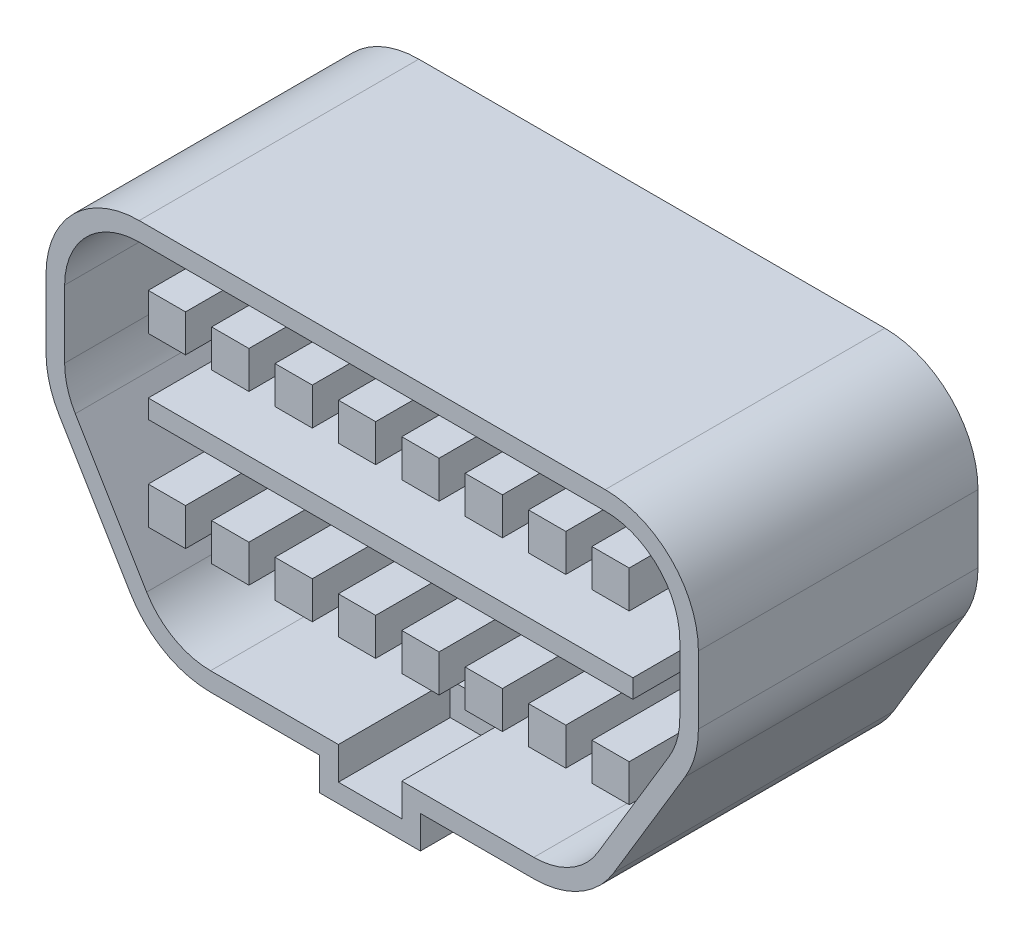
ISO-10303-21;
HEADER;
FILE_DESCRIPTION(('STEP AP214'),'2;1');
FILE_NAME('part.step','',(''),(''),'','','');
FILE_SCHEMA(('AUTOMOTIVE_DESIGN { 1 0 10303 214 1 1 1 1 }'));
ENDSEC;
DATA;
#1=APPLICATION_CONTEXT('core data for automotive mechanical design processes');
#2=APPLICATION_PROTOCOL_DEFINITION('international standard','automotive_design',2000,#1);
#3=PRODUCT_CONTEXT('',#1,'mechanical');
#4=PRODUCT('Part','Part','',(#3));
#5=PRODUCT_RELATED_PRODUCT_CATEGORY('part','',(#4));
#6=PRODUCT_DEFINITION_FORMATION('','',#4);
#7=PRODUCT_DEFINITION_CONTEXT('part definition',#1,'design');
#8=PRODUCT_DEFINITION('design','',#6,#7);
#9=PRODUCT_DEFINITION_SHAPE('','',#8);
#10=(LENGTH_UNIT() NAMED_UNIT(*) SI_UNIT(.MILLI.,.METRE.));
#11=(NAMED_UNIT(*) PLANE_ANGLE_UNIT() SI_UNIT($,.RADIAN.));
#12=(NAMED_UNIT(*) SI_UNIT($,.STERADIAN.) SOLID_ANGLE_UNIT());
#13=UNCERTAINTY_MEASURE_WITH_UNIT(LENGTH_MEASURE(1.E-05),#10,'distance_accuracy_value','');
#14=(GEOMETRIC_REPRESENTATION_CONTEXT(3) GLOBAL_UNCERTAINTY_ASSIGNED_CONTEXT((#13)) GLOBAL_UNIT_ASSIGNED_CONTEXT((#10,
#11,#12)) REPRESENTATION_CONTEXT('',''));
#15=CARTESIAN_POINT('',(0.,0.,0.));
#16=DIRECTION('',(0.,0.,1.));
#17=DIRECTION('',(1.,0.,0.));
#18=AXIS2_PLACEMENT_3D('',#15,#16,#17);
#19=CARTESIAN_POINT('',(0.,0.,15.));
#20=DIRECTION('',(0.,1.,0.));
#21=DIRECTION('',(0.,0.,1.));
#22=AXIS2_PLACEMENT_3D('',#19,#20,#21);
#23=PLANE('',#22);
#24=DIRECTION('',(0.,0.,-1.));
#25=VECTOR('',#24,1.);
#26=CARTESIAN_POINT('',(14.685762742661,0.,15.));
#27=LINE('',#26,#25);
#28=CARTESIAN_POINT('',(14.685762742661,0.,15.));
#29=VERTEX_POINT('',#28);
#30=CARTESIAN_POINT('',(14.685762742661,0.,8.));
#31=VERTEX_POINT('',#30);
#32=EDGE_CURVE('E688',#29,#31,#27,.T.);
#33=ORIENTED_EDGE('',*,*,#32,.F.);
#34=DIRECTION('',(1.,0.,0.));
#35=VECTOR('',#34,1.);
#36=CARTESIAN_POINT('',(0.,0.,15.));
#37=LINE('',#36,#35);
#38=CARTESIAN_POINT('',(8.82886389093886,0.,15.));
#39=VERTEX_POINT('',#38);
#40=EDGE_CURVE('E1040',#39,#29,#37,.T.);
#41=ORIENTED_EDGE('',*,*,#40,.F.);
#42=DIRECTION('',(0.,0.,1.));
#43=VECTOR('',#42,1.);
#44=CARTESIAN_POINT('',(8.82886389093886,0.,0.));
#45=LINE('',#44,#43);
#46=CARTESIAN_POINT('',(8.82886389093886,0.,0.));
#47=VERTEX_POINT('',#46);
#48=EDGE_CURVE('E1087',#39,#47,#45,.F.);
#49=ORIENTED_EDGE('',*,*,#48,.T.);
#50=DIRECTION('',(1.,0.,0.));
#51=VECTOR('',#50,1.);
#52=CARTESIAN_POINT('',(0.,0.,0.));
#53=LINE('',#52,#51);
#54=CARTESIAN_POINT('',(26.1711361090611,0.,0.));
#55=VERTEX_POINT('',#54);
#56=EDGE_CURVE('E1050',#47,#55,#53,.T.);
#57=ORIENTED_EDGE('',*,*,#56,.T.);
#58=DIRECTION('',(0.,0.,-1.));
#59=VECTOR('',#58,1.);
#60=CARTESIAN_POINT('',(26.1711361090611,0.,15.));
#61=LINE('',#60,#59);
#62=CARTESIAN_POINT('',(26.1711361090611,0.,15.));
#63=VERTEX_POINT('',#62);
#64=EDGE_CURVE('E1096',#55,#63,#61,.F.);
#65=ORIENTED_EDGE('',*,*,#64,.T.);
#66=CARTESIAN_POINT('',(20.085762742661,0.,15.));
#67=VERTEX_POINT('',#66);
#68=EDGE_CURVE('E1038',#67,#63,#37,.T.);
#69=ORIENTED_EDGE('',*,*,#68,.F.);
#70=DIRECTION('',(0.,0.,1.));
#71=VECTOR('',#70,1.);
#72=CARTESIAN_POINT('',(20.085762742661,0.,15.));
#73=LINE('',#72,#71);
#74=CARTESIAN_POINT('',(20.085762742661,0.,8.));
#75=VERTEX_POINT('',#74);
#76=EDGE_CURVE('E696',#75,#67,#73,.T.);
#77=ORIENTED_EDGE('',*,*,#76,.F.);
#78=DIRECTION('',(1.,0.,0.));
#79=VECTOR('',#78,1.);
#80=CARTESIAN_POINT('',(14.685762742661,0.,8.));
#81=LINE('',#80,#79);
#82=EDGE_CURVE('E705',#31,#75,#81,.T.);
#83=ORIENTED_EDGE('',*,*,#82,.F.);
#84=EDGE_LOOP('',(#33,#41,#49,#57,#65,#69,#77,#83));
#85=FACE_BOUND('',#84,.T.);
#86=ADVANCED_FACE('F34',(#85),#23,.F.);
#87=CARTESIAN_POINT('',(0.,0.,1.));
#88=DIRECTION('',(0.,0.,-1.));
#89=DIRECTION('',(-1.,0.,0.));
#90=AXIS2_PLACEMENT_3D('',#87,#88,#89);
#91=PLANE('',#90);
#92=DIRECTION('',(0.,-1.,0.));
#93=VECTOR('',#92,1.);
#94=CARTESIAN_POINT('',(24.885762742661,7.,1.));
#95=LINE('',#94,#93);
#96=CARTESIAN_POINT('',(24.885762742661,7.,1.));
#97=VERTEX_POINT('',#96);
#98=CARTESIAN_POINT('',(24.885762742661,5.,1.));
#99=VERTEX_POINT('',#98);
#100=EDGE_CURVE('E1440',#97,#99,#95,.T.);
#101=ORIENTED_EDGE('',*,*,#100,.F.);
#102=DIRECTION('',(-1.,0.,0.));
#103=VECTOR('',#102,1.);
#104=CARTESIAN_POINT('',(24.885762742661,7.,1.));
#105=LINE('',#104,#103);
#106=CARTESIAN_POINT('',(26.885762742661,7.,1.));
#107=VERTEX_POINT('',#106);
#108=EDGE_CURVE('E1442',#107,#97,#105,.T.);
#109=ORIENTED_EDGE('',*,*,#108,.F.);
#110=DIRECTION('',(0.,1.,0.));
#111=VECTOR('',#110,1.);
#112=CARTESIAN_POINT('',(26.885762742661,7.,1.));
#113=LINE('',#112,#111);
#114=CARTESIAN_POINT('',(26.885762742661,5.,1.));
#115=VERTEX_POINT('',#114);
#116=EDGE_CURVE('E1445',#115,#107,#113,.T.);
#117=ORIENTED_EDGE('',*,*,#116,.F.);
#118=DIRECTION('',(1.,0.,0.));
#119=VECTOR('',#118,1.);
#120=CARTESIAN_POINT('',(24.885762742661,5.,1.));
#121=LINE('',#120,#119);
#122=EDGE_CURVE('E1448',#99,#115,#121,.T.);
#123=ORIENTED_EDGE('',*,*,#122,.F.);
#124=EDGE_LOOP('',(#101,#109,#117,#123));
#125=FACE_BOUND('',#124,.T.);
#126=DIRECTION('',(0.,-1.,0.));
#127=VECTOR('',#126,1.);
#128=CARTESIAN_POINT('',(21.485762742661,7.,1.));
#129=LINE('',#128,#127);
#130=CARTESIAN_POINT('',(21.485762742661,7.,1.));
#131=VERTEX_POINT('',#130);
#132=CARTESIAN_POINT('',(21.485762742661,5.,1.));
#133=VERTEX_POINT('',#132);
#134=EDGE_CURVE('E1405',#131,#133,#129,.T.);
#135=ORIENTED_EDGE('',*,*,#134,.F.);
#136=DIRECTION('',(-1.,0.,0.));
#137=VECTOR('',#136,1.);
#138=CARTESIAN_POINT('',(21.485762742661,7.,1.));
#139=LINE('',#138,#137);
#140=CARTESIAN_POINT('',(23.485762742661,7.,1.));
#141=VERTEX_POINT('',#140);
#142=EDGE_CURVE('E1407',#141,#131,#139,.T.);
#143=ORIENTED_EDGE('',*,*,#142,.F.);
#144=DIRECTION('',(0.,1.,0.));
#145=VECTOR('',#144,1.);
#146=CARTESIAN_POINT('',(23.485762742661,7.,1.));
#147=LINE('',#146,#145);
#148=CARTESIAN_POINT('',(23.485762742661,5.,1.));
#149=VERTEX_POINT('',#148);
#150=EDGE_CURVE('E1410',#149,#141,#147,.T.);
#151=ORIENTED_EDGE('',*,*,#150,.F.);
#152=DIRECTION('',(1.,0.,0.));
#153=VECTOR('',#152,1.);
#154=CARTESIAN_POINT('',(21.485762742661,5.,1.));
#155=LINE('',#154,#153);
#156=EDGE_CURVE('E1413',#133,#149,#155,.T.);
#157=ORIENTED_EDGE('',*,*,#156,.F.);
#158=EDGE_LOOP('',(#135,#143,#151,#157));
#159=FACE_BOUND('',#158,.T.);
#160=DIRECTION('',(0.,-1.,0.));
#161=VECTOR('',#160,1.);
#162=CARTESIAN_POINT('',(18.085762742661,7.,1.));
#163=LINE('',#162,#161);
#164=CARTESIAN_POINT('',(18.085762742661,7.,1.));
#165=VERTEX_POINT('',#164);
#166=CARTESIAN_POINT('',(18.085762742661,5.,1.));
#167=VERTEX_POINT('',#166);
#168=EDGE_CURVE('E1370',#165,#167,#163,.T.);
#169=ORIENTED_EDGE('',*,*,#168,.F.);
#170=DIRECTION('',(-1.,0.,0.));
#171=VECTOR('',#170,1.);
#172=CARTESIAN_POINT('',(18.085762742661,7.,1.));
#173=LINE('',#172,#171);
#174=CARTESIAN_POINT('',(20.085762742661,7.,1.));
#175=VERTEX_POINT('',#174);
#176=EDGE_CURVE('E1372',#175,#165,#173,.T.);
#177=ORIENTED_EDGE('',*,*,#176,.F.);
#178=DIRECTION('',(0.,1.,0.));
#179=VECTOR('',#178,1.);
#180=CARTESIAN_POINT('',(20.085762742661,7.,1.));
#181=LINE('',#180,#179);
#182=CARTESIAN_POINT('',(20.085762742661,5.,1.));
#183=VERTEX_POINT('',#182);
#184=EDGE_CURVE('E1375',#183,#175,#181,.T.);
#185=ORIENTED_EDGE('',*,*,#184,.F.);
#186=DIRECTION('',(1.,0.,0.));
#187=VECTOR('',#186,1.);
#188=CARTESIAN_POINT('',(18.085762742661,5.,1.));
#189=LINE('',#188,#187);
#190=EDGE_CURVE('E1378',#167,#183,#189,.T.);
#191=ORIENTED_EDGE('',*,*,#190,.F.);
#192=EDGE_LOOP('',(#169,#177,#185,#191));
#193=FACE_BOUND('',#192,.T.);
#194=DIRECTION('',(0.,-1.,0.));
#195=VECTOR('',#194,1.);
#196=CARTESIAN_POINT('',(14.685762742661,7.,1.));
#197=LINE('',#196,#195);
#198=CARTESIAN_POINT('',(14.685762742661,7.,1.));
#199=VERTEX_POINT('',#198);
#200=CARTESIAN_POINT('',(14.685762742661,5.,1.));
#201=VERTEX_POINT('',#200);
#202=EDGE_CURVE('E1335',#199,#201,#197,.T.);
#203=ORIENTED_EDGE('',*,*,#202,.F.);
#204=DIRECTION('',(-1.,0.,0.));
#205=VECTOR('',#204,1.);
#206=CARTESIAN_POINT('',(14.685762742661,7.,1.));
#207=LINE('',#206,#205);
#208=CARTESIAN_POINT('',(16.685762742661,7.,1.));
#209=VERTEX_POINT('',#208);
#210=EDGE_CURVE('E1337',#209,#199,#207,.T.);
#211=ORIENTED_EDGE('',*,*,#210,.F.);
#212=DIRECTION('',(0.,1.,0.));
#213=VECTOR('',#212,1.);
#214=CARTESIAN_POINT('',(16.685762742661,7.,1.));
#215=LINE('',#214,#213);
#216=CARTESIAN_POINT('',(16.685762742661,5.,1.));
#217=VERTEX_POINT('',#216);
#218=EDGE_CURVE('E1340',#217,#209,#215,.T.);
#219=ORIENTED_EDGE('',*,*,#218,.F.);
#220=DIRECTION('',(1.,0.,0.));
#221=VECTOR('',#220,1.);
#222=CARTESIAN_POINT('',(14.685762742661,5.,1.));
#223=LINE('',#222,#221);
#224=EDGE_CURVE('E1343',#201,#217,#223,.T.);
#225=ORIENTED_EDGE('',*,*,#224,.F.);
#226=EDGE_LOOP('',(#203,#211,#219,#225));
#227=FACE_BOUND('',#226,.T.);
#228=DIRECTION('',(0.,-1.,0.));
#229=VECTOR('',#228,1.);
#230=CARTESIAN_POINT('',(11.285762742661,7.,1.));
#231=LINE('',#230,#229);
#232=CARTESIAN_POINT('',(11.285762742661,7.,1.));
#233=VERTEX_POINT('',#232);
#234=CARTESIAN_POINT('',(11.285762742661,5.,1.));
#235=VERTEX_POINT('',#234);
#236=EDGE_CURVE('E1300',#233,#235,#231,.T.);
#237=ORIENTED_EDGE('',*,*,#236,.F.);
#238=DIRECTION('',(-1.,0.,0.));
#239=VECTOR('',#238,1.);
#240=CARTESIAN_POINT('',(11.285762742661,7.,1.));
#241=LINE('',#240,#239);
#242=CARTESIAN_POINT('',(13.285762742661,7.,1.));
#243=VERTEX_POINT('',#242);
#244=EDGE_CURVE('E1302',#243,#233,#241,.T.);
#245=ORIENTED_EDGE('',*,*,#244,.F.);
#246=DIRECTION('',(0.,1.,0.));
#247=VECTOR('',#246,1.);
#248=CARTESIAN_POINT('',(13.285762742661,7.,1.));
#249=LINE('',#248,#247);
#250=CARTESIAN_POINT('',(13.285762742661,5.,1.));
#251=VERTEX_POINT('',#250);
#252=EDGE_CURVE('E1305',#251,#243,#249,.T.);
#253=ORIENTED_EDGE('',*,*,#252,.F.);
#254=DIRECTION('',(1.,0.,0.));
#255=VECTOR('',#254,1.);
#256=CARTESIAN_POINT('',(11.285762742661,5.,1.));
#257=LINE('',#256,#255);
#258=EDGE_CURVE('E1308',#235,#251,#257,.T.);
#259=ORIENTED_EDGE('',*,*,#258,.F.);
#260=EDGE_LOOP('',(#237,#245,#253,#259));
#261=FACE_BOUND('',#260,.T.);
#262=DIRECTION('',(0.,-1.,0.));
#263=VECTOR('',#262,1.);
#264=CARTESIAN_POINT('',(7.88576274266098,7.,1.));
#265=LINE('',#264,#263);
#266=CARTESIAN_POINT('',(7.88576274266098,7.,1.));
#267=VERTEX_POINT('',#266);
#268=CARTESIAN_POINT('',(7.88576274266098,5.,1.));
#269=VERTEX_POINT('',#268);
#270=EDGE_CURVE('E778',#267,#269,#265,.T.);
#271=ORIENTED_EDGE('',*,*,#270,.F.);
#272=DIRECTION('',(-1.,0.,0.));
#273=VECTOR('',#272,1.);
#274=CARTESIAN_POINT('',(7.88576274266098,7.,1.));
#275=LINE('',#274,#273);
#276=CARTESIAN_POINT('',(9.88576274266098,7.,1.));
#277=VERTEX_POINT('',#276);
#278=EDGE_CURVE('E748',#277,#267,#275,.T.);
#279=ORIENTED_EDGE('',*,*,#278,.F.);
#280=DIRECTION('',(0.,1.,0.));
#281=VECTOR('',#280,1.);
#282=CARTESIAN_POINT('',(9.88576274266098,7.,1.));
#283=LINE('',#282,#281);
#284=CARTESIAN_POINT('',(9.88576274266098,5.,1.));
#285=VERTEX_POINT('',#284);
#286=EDGE_CURVE('E766',#285,#277,#283,.T.);
#287=ORIENTED_EDGE('',*,*,#286,.F.);
#288=DIRECTION('',(1.,0.,0.));
#289=VECTOR('',#288,1.);
#290=CARTESIAN_POINT('',(7.88576274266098,5.,1.));
#291=LINE('',#290,#289);
#292=EDGE_CURVE('E772',#269,#285,#291,.T.);
#293=ORIENTED_EDGE('',*,*,#292,.F.);
#294=EDGE_LOOP('',(#271,#279,#287,#293));
#295=FACE_BOUND('',#294,.T.);
#296=DIRECTION('',(0.,-1.,0.));
#297=VECTOR('',#296,1.);
#298=CARTESIAN_POINT('',(28.285762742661,16.,1.));
#299=LINE('',#298,#297);
#300=CARTESIAN_POINT('',(28.285762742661,16.,1.));
#301=VERTEX_POINT('',#300);
#302=CARTESIAN_POINT('',(28.285762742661,14.,1.));
#303=VERTEX_POINT('',#302);
#304=EDGE_CURVE('E814',#301,#303,#299,.T.);
#305=ORIENTED_EDGE('',*,*,#304,.F.);
#306=DIRECTION('',(-1.,0.,0.));
#307=VECTOR('',#306,1.);
#308=CARTESIAN_POINT('',(28.285762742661,16.,1.));
#309=LINE('',#308,#307);
#310=CARTESIAN_POINT('',(30.285762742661,16.,1.));
#311=VERTEX_POINT('',#310);
#312=EDGE_CURVE('E819',#311,#301,#309,.T.);
#313=ORIENTED_EDGE('',*,*,#312,.F.);
#314=DIRECTION('',(0.,1.,0.));
#315=VECTOR('',#314,1.);
#316=CARTESIAN_POINT('',(30.285762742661,16.,1.));
#317=LINE('',#316,#315);
#318=CARTESIAN_POINT('',(30.285762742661,14.,1.));
#319=VERTEX_POINT('',#318);
#320=EDGE_CURVE('E831',#319,#311,#317,.T.);
#321=ORIENTED_EDGE('',*,*,#320,.F.);
#322=DIRECTION('',(1.,0.,0.));
#323=VECTOR('',#322,1.);
#324=CARTESIAN_POINT('',(28.285762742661,14.,1.));
#325=LINE('',#324,#323);
#326=EDGE_CURVE('E828',#303,#319,#325,.T.);
#327=ORIENTED_EDGE('',*,*,#326,.F.);
#328=EDGE_LOOP('',(#305,#313,#321,#327));
#329=FACE_BOUND('',#328,.T.);
#330=DIRECTION('',(0.,-1.,0.));
#331=VECTOR('',#330,1.);
#332=CARTESIAN_POINT('',(4.48576274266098,16.,1.));
#333=LINE('',#332,#331);
#334=CARTESIAN_POINT('',(4.48576274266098,16.,1.));
#335=VERTEX_POINT('',#334);
#336=CARTESIAN_POINT('',(4.48576274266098,14.,1.));
#337=VERTEX_POINT('',#336);
#338=EDGE_CURVE('E880',#335,#337,#333,.T.);
#339=ORIENTED_EDGE('',*,*,#338,.F.);
#340=DIRECTION('',(-1.,0.,0.));
#341=VECTOR('',#340,1.);
#342=CARTESIAN_POINT('',(4.48576274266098,16.,1.));
#343=LINE('',#342,#341);
#344=CARTESIAN_POINT('',(6.48576274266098,16.,1.));
#345=VERTEX_POINT('',#344);
#346=EDGE_CURVE('E885',#345,#335,#343,.T.);
#347=ORIENTED_EDGE('',*,*,#346,.F.);
#348=DIRECTION('',(0.,1.,0.));
#349=VECTOR('',#348,1.);
#350=CARTESIAN_POINT('',(6.48576274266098,16.,1.));
#351=LINE('',#350,#349);
#352=CARTESIAN_POINT('',(6.48576274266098,14.,1.));
#353=VERTEX_POINT('',#352);
#354=EDGE_CURVE('E897',#353,#345,#351,.T.);
#355=ORIENTED_EDGE('',*,*,#354,.F.);
#356=DIRECTION('',(1.,0.,0.));
#357=VECTOR('',#356,1.);
#358=CARTESIAN_POINT('',(4.48576274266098,14.,1.));
#359=LINE('',#358,#357);
#360=EDGE_CURVE('E894',#337,#353,#359,.T.);
#361=ORIENTED_EDGE('',*,*,#360,.F.);
#362=EDGE_LOOP('',(#339,#347,#355,#361));
#363=FACE_BOUND('',#362,.T.);
#364=DIRECTION('',(-1.,0.,0.));
#365=VECTOR('',#364,1.);
#366=CARTESIAN_POINT('',(0.,19.,1.));
#367=LINE('',#366,#365);
#368=CARTESIAN_POINT('',(30.,19.,1.));
#369=VERTEX_POINT('',#368);
#370=CARTESIAN_POINT('',(4.99999999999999,19.,1.));
#371=VERTEX_POINT('',#370);
#372=EDGE_CURVE('E959',#369,#371,#367,.T.);
#373=ORIENTED_EDGE('',*,*,#372,.T.);
#374=CARTESIAN_POINT('',(4.99999999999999,15.,1.));
#375=DIRECTION('',(0.,0.,-1.));
#376=DIRECTION('',(-1.,0.,0.));
#377=AXIS2_PLACEMENT_3D('',#374,#375,#376);
#378=CIRCLE('',#377,4.);
#379=CARTESIAN_POINT('',(0.99999999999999,15.,1.));
#380=VERTEX_POINT('',#379);
#381=EDGE_CURVE('E950',#380,#371,#378,.T.);
#382=ORIENTED_EDGE('',*,*,#381,.F.);
#383=DIRECTION('',(0.,-1.,0.));
#384=VECTOR('',#383,1.);
#385=CARTESIAN_POINT('',(1.,0.,1.));
#386=LINE('',#385,#384);
#387=CARTESIAN_POINT('',(0.999999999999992,11.3722996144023,1.));
#388=VERTEX_POINT('',#387);
#389=EDGE_CURVE('E946',#380,#388,#386,.T.);
#390=ORIENTED_EDGE('',*,*,#389,.T.);
#391=CARTESIAN_POINT('',(4.99999999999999,11.3722996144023,1.));
#392=DIRECTION('',(0.,0.,-1.));
#393=DIRECTION('',(-1.,0.,0.));
#394=AXIS2_PLACEMENT_3D('',#391,#392,#393);
#395=CIRCLE('',#394,4.);
#396=CARTESIAN_POINT('',(1.57133079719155,9.31214731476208,1.));
#397=VERTEX_POINT('',#396);
#398=EDGE_CURVE('E988',#397,#388,#395,.T.);
#399=ORIENTED_EDGE('',*,*,#398,.F.);
#400=DIRECTION('',(0.515038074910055,-0.857167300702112,0.));
#401=VECTOR('',#400,1.);
#402=CARTESIAN_POINT('',(5.26558198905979,3.16388085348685,1.));
#403=LINE('',#402,#401);
#404=CARTESIAN_POINT('',(5.40019468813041,2.93984770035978,1.));
#405=VERTEX_POINT('',#404);
#406=EDGE_CURVE('E985',#405,#397,#403,.F.);
#407=ORIENTED_EDGE('',*,*,#406,.F.);
#408=CARTESIAN_POINT('',(8.82886389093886,5.,1.));
#409=DIRECTION('',(0.,0.,-1.));
#410=DIRECTION('',(-1.,0.,0.));
#411=AXIS2_PLACEMENT_3D('',#408,#409,#410);
#412=CIRCLE('',#411,4.);
#413=CARTESIAN_POINT('',(8.82886389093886,1.,1.));
#414=VERTEX_POINT('',#413);
#415=EDGE_CURVE('E981',#414,#405,#412,.T.);
#416=ORIENTED_EDGE('',*,*,#415,.F.);
#417=DIRECTION('',(1.,0.,0.));
#418=VECTOR('',#417,1.);
#419=CARTESIAN_POINT('',(0.,1.,1.));
#420=LINE('',#419,#418);
#421=CARTESIAN_POINT('',(26.1711361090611,1.,1.));
#422=VERTEX_POINT('',#421);
#423=EDGE_CURVE('E953',#414,#422,#420,.T.);
#424=ORIENTED_EDGE('',*,*,#423,.T.);
#425=CARTESIAN_POINT('',(26.1711361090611,5.,1.));
#426=DIRECTION('',(0.,0.,-1.));
#427=DIRECTION('',(-1.,0.,0.));
#428=AXIS2_PLACEMENT_3D('',#425,#426,#427);
#429=CIRCLE('',#428,4.);
#430=CARTESIAN_POINT('',(29.5998053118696,2.93984770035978,1.));
#431=VERTEX_POINT('',#430);
#432=EDGE_CURVE('E951',#431,#422,#429,.T.);
#433=ORIENTED_EDGE('',*,*,#432,.F.);
#434=DIRECTION('',(0.515038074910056,0.857167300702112,0.));
#435=VECTOR('',#434,1.);
#436=CARTESIAN_POINT('',(20.4501703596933,-12.2877020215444,1.));
#437=LINE('',#436,#435);
#438=CARTESIAN_POINT('',(33.4286692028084,9.31214731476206,1.));
#439=VERTEX_POINT('',#438);
#440=EDGE_CURVE('E973',#439,#431,#437,.F.);
#441=ORIENTED_EDGE('',*,*,#440,.F.);
#442=CARTESIAN_POINT('',(30.,11.3722996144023,1.));
#443=DIRECTION('',(0.,0.,-1.));
#444=DIRECTION('',(-1.,0.,0.));
#445=AXIS2_PLACEMENT_3D('',#442,#443,#444);
#446=CIRCLE('',#445,4.);
#447=CARTESIAN_POINT('',(34.,11.3722996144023,1.));
#448=VERTEX_POINT('',#447);
#449=EDGE_CURVE('E969',#448,#439,#446,.T.);
#450=ORIENTED_EDGE('',*,*,#449,.F.);
#451=DIRECTION('',(0.,1.,0.));
#452=VECTOR('',#451,1.);
#453=CARTESIAN_POINT('',(34.,0.,1.));
#454=LINE('',#453,#452);
#455=CARTESIAN_POINT('',(34.,15.,1.));
#456=VERTEX_POINT('',#455);
#457=EDGE_CURVE('E962',#448,#456,#454,.T.);
#458=ORIENTED_EDGE('',*,*,#457,.T.);
#459=CARTESIAN_POINT('',(30.,15.,1.));
#460=DIRECTION('',(0.,0.,-1.));
#461=DIRECTION('',(-1.,0.,0.));
#462=AXIS2_PLACEMENT_3D('',#459,#460,#461);
#463=CIRCLE('',#462,4.);
#464=EDGE_CURVE('E963',#369,#456,#463,.T.);
#465=ORIENTED_EDGE('',*,*,#464,.F.);
#466=EDGE_LOOP('',(#373,#382,#390,#399,#407,#416,#424,#433,#441,#450,#458,#465));
#467=FACE_BOUND('',#466,.T.);
#468=DIRECTION('',(0.,-1.,0.));
#469=VECTOR('',#468,1.);
#470=CARTESIAN_POINT('',(4.48576274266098,11.,1.));
#471=LINE('',#470,#469);
#472=CARTESIAN_POINT('',(4.48576274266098,11.,1.));
#473=VERTEX_POINT('',#472);
#474=CARTESIAN_POINT('',(4.48576274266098,10.,1.));
#475=VERTEX_POINT('',#474);
#476=EDGE_CURVE('E913',#473,#475,#471,.T.);
#477=ORIENTED_EDGE('',*,*,#476,.F.);
#478=DIRECTION('',(-1.,0.,0.));
#479=VECTOR('',#478,1.);
#480=CARTESIAN_POINT('',(4.48576274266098,11.,1.));
#481=LINE('',#480,#479);
#482=CARTESIAN_POINT('',(30.485762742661,11.,1.));
#483=VERTEX_POINT('',#482);
#484=EDGE_CURVE('E918',#483,#473,#481,.T.);
#485=ORIENTED_EDGE('',*,*,#484,.F.);
#486=DIRECTION('',(0.,1.,0.));
#487=VECTOR('',#486,1.);
#488=CARTESIAN_POINT('',(30.485762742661,11.,1.));
#489=LINE('',#488,#487);
#490=CARTESIAN_POINT('',(30.485762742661,10.,1.));
#491=VERTEX_POINT('',#490);
#492=EDGE_CURVE('E930',#491,#483,#489,.T.);
#493=ORIENTED_EDGE('',*,*,#492,.F.);
#494=DIRECTION('',(1.,0.,0.));
#495=VECTOR('',#494,1.);
#496=CARTESIAN_POINT('',(4.48576274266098,10.,1.));
#497=LINE('',#496,#495);
#498=EDGE_CURVE('E927',#475,#491,#497,.T.);
#499=ORIENTED_EDGE('',*,*,#498,.F.);
#500=EDGE_LOOP('',(#477,#485,#493,#499));
#501=FACE_BOUND('',#500,.T.);
#502=DIRECTION('',(0.,-1.,0.));
#503=VECTOR('',#502,1.);
#504=CARTESIAN_POINT('',(7.88576274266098,16.,1.));
#505=LINE('',#504,#503);
#506=CARTESIAN_POINT('',(7.88576274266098,16.,1.));
#507=VERTEX_POINT('',#506);
#508=CARTESIAN_POINT('',(7.88576274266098,14.,1.));
#509=VERTEX_POINT('',#508);
#510=EDGE_CURVE('E877',#507,#509,#505,.T.);
#511=ORIENTED_EDGE('',*,*,#510,.F.);
#512=DIRECTION('',(-1.,0.,0.));
#513=VECTOR('',#512,1.);
#514=CARTESIAN_POINT('',(7.88576274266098,16.,1.));
#515=LINE('',#514,#513);
#516=CARTESIAN_POINT('',(9.88576274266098,16.,1.));
#517=VERTEX_POINT('',#516);
#518=EDGE_CURVE('E847',#517,#507,#515,.T.);
#519=ORIENTED_EDGE('',*,*,#518,.F.);
#520=DIRECTION('',(0.,1.,0.));
#521=VECTOR('',#520,1.);
#522=CARTESIAN_POINT('',(9.88576274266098,16.,1.));
#523=LINE('',#522,#521);
#524=CARTESIAN_POINT('',(9.88576274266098,14.,1.));
#525=VERTEX_POINT('',#524);
#526=EDGE_CURVE('E865',#525,#517,#523,.T.);
#527=ORIENTED_EDGE('',*,*,#526,.F.);
#528=DIRECTION('',(1.,0.,0.));
#529=VECTOR('',#528,1.);
#530=CARTESIAN_POINT('',(7.88576274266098,14.,1.));
#531=LINE('',#530,#529);
#532=EDGE_CURVE('E871',#509,#525,#531,.T.);
#533=ORIENTED_EDGE('',*,*,#532,.F.);
#534=EDGE_LOOP('',(#511,#519,#527,#533));
#535=FACE_BOUND('',#534,.T.);
#536=DIRECTION('',(0.,-1.,0.));
#537=VECTOR('',#536,1.);
#538=CARTESIAN_POINT('',(11.285762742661,16.,1.));
#539=LINE('',#538,#537);
#540=CARTESIAN_POINT('',(11.285762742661,16.,1.));
#541=VERTEX_POINT('',#540);
#542=CARTESIAN_POINT('',(11.285762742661,14.,1.));
#543=VERTEX_POINT('',#542);
#544=EDGE_CURVE('E1125',#541,#543,#539,.T.);
#545=ORIENTED_EDGE('',*,*,#544,.F.);
#546=DIRECTION('',(-1.,0.,0.));
#547=VECTOR('',#546,1.);
#548=CARTESIAN_POINT('',(11.285762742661,16.,1.));
#549=LINE('',#548,#547);
#550=CARTESIAN_POINT('',(13.285762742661,16.,1.));
#551=VERTEX_POINT('',#550);
#552=EDGE_CURVE('E1127',#551,#541,#549,.T.);
#553=ORIENTED_EDGE('',*,*,#552,.F.);
#554=DIRECTION('',(0.,1.,0.));
#555=VECTOR('',#554,1.);
#556=CARTESIAN_POINT('',(13.285762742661,16.,1.));
#557=LINE('',#556,#555);
#558=CARTESIAN_POINT('',(13.285762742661,14.,1.));
#559=VERTEX_POINT('',#558);
#560=EDGE_CURVE('E1130',#559,#551,#557,.T.);
#561=ORIENTED_EDGE('',*,*,#560,.F.);
#562=DIRECTION('',(1.,0.,0.));
#563=VECTOR('',#562,1.);
#564=CARTESIAN_POINT('',(11.285762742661,14.,1.));
#565=LINE('',#564,#563);
#566=EDGE_CURVE('E1133',#543,#559,#565,.T.);
#567=ORIENTED_EDGE('',*,*,#566,.F.);
#568=EDGE_LOOP('',(#545,#553,#561,#567));
#569=FACE_BOUND('',#568,.T.);
#570=DIRECTION('',(0.,-1.,0.));
#571=VECTOR('',#570,1.);
#572=CARTESIAN_POINT('',(14.685762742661,16.,1.));
#573=LINE('',#572,#571);
#574=CARTESIAN_POINT('',(14.685762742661,16.,1.));
#575=VERTEX_POINT('',#574);
#576=CARTESIAN_POINT('',(14.685762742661,14.,1.));
#577=VERTEX_POINT('',#576);
#578=EDGE_CURVE('E1160',#575,#577,#573,.T.);
#579=ORIENTED_EDGE('',*,*,#578,.F.);
#580=DIRECTION('',(-1.,0.,0.));
#581=VECTOR('',#580,1.);
#582=CARTESIAN_POINT('',(14.685762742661,16.,1.));
#583=LINE('',#582,#581);
#584=CARTESIAN_POINT('',(16.685762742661,16.,1.));
#585=VERTEX_POINT('',#584);
#586=EDGE_CURVE('E1162',#585,#575,#583,.T.);
#587=ORIENTED_EDGE('',*,*,#586,.F.);
#588=DIRECTION('',(0.,1.,0.));
#589=VECTOR('',#588,1.);
#590=CARTESIAN_POINT('',(16.685762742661,16.,1.));
#591=LINE('',#590,#589);
#592=CARTESIAN_POINT('',(16.685762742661,14.,1.));
#593=VERTEX_POINT('',#592);
#594=EDGE_CURVE('E1165',#593,#585,#591,.T.);
#595=ORIENTED_EDGE('',*,*,#594,.F.);
#596=DIRECTION('',(1.,0.,0.));
#597=VECTOR('',#596,1.);
#598=CARTESIAN_POINT('',(14.685762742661,14.,1.));
#599=LINE('',#598,#597);
#600=EDGE_CURVE('E1168',#577,#593,#599,.T.);
#601=ORIENTED_EDGE('',*,*,#600,.F.);
#602=EDGE_LOOP('',(#579,#587,#595,#601));
#603=FACE_BOUND('',#602,.T.);
#604=DIRECTION('',(0.,-1.,0.));
#605=VECTOR('',#604,1.);
#606=CARTESIAN_POINT('',(18.085762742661,16.,1.));
#607=LINE('',#606,#605);
#608=CARTESIAN_POINT('',(18.085762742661,16.,1.));
#609=VERTEX_POINT('',#608);
#610=CARTESIAN_POINT('',(18.085762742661,14.,1.));
#611=VERTEX_POINT('',#610);
#612=EDGE_CURVE('E1195',#609,#611,#607,.T.);
#613=ORIENTED_EDGE('',*,*,#612,.F.);
#614=DIRECTION('',(-1.,0.,0.));
#615=VECTOR('',#614,1.);
#616=CARTESIAN_POINT('',(18.085762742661,16.,1.));
#617=LINE('',#616,#615);
#618=CARTESIAN_POINT('',(20.085762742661,16.,1.));
#619=VERTEX_POINT('',#618);
#620=EDGE_CURVE('E1197',#619,#609,#617,.T.);
#621=ORIENTED_EDGE('',*,*,#620,.F.);
#622=DIRECTION('',(0.,1.,0.));
#623=VECTOR('',#622,1.);
#624=CARTESIAN_POINT('',(20.085762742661,16.,1.));
#625=LINE('',#624,#623);
#626=CARTESIAN_POINT('',(20.085762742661,14.,1.));
#627=VERTEX_POINT('',#626);
#628=EDGE_CURVE('E1200',#627,#619,#625,.T.);
#629=ORIENTED_EDGE('',*,*,#628,.F.);
#630=DIRECTION('',(1.,0.,0.));
#631=VECTOR('',#630,1.);
#632=CARTESIAN_POINT('',(18.085762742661,14.,1.));
#633=LINE('',#632,#631);
#634=EDGE_CURVE('E1203',#611,#627,#633,.T.);
#635=ORIENTED_EDGE('',*,*,#634,.F.);
#636=EDGE_LOOP('',(#613,#621,#629,#635));
#637=FACE_BOUND('',#636,.T.);
#638=DIRECTION('',(0.,-1.,0.));
#639=VECTOR('',#638,1.);
#640=CARTESIAN_POINT('',(21.485762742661,16.,1.));
#641=LINE('',#640,#639);
#642=CARTESIAN_POINT('',(21.485762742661,16.,1.));
#643=VERTEX_POINT('',#642);
#644=CARTESIAN_POINT('',(21.485762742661,14.,1.));
#645=VERTEX_POINT('',#644);
#646=EDGE_CURVE('E1230',#643,#645,#641,.T.);
#647=ORIENTED_EDGE('',*,*,#646,.F.);
#648=DIRECTION('',(-1.,0.,0.));
#649=VECTOR('',#648,1.);
#650=CARTESIAN_POINT('',(21.485762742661,16.,1.));
#651=LINE('',#650,#649);
#652=CARTESIAN_POINT('',(23.485762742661,16.,1.));
#653=VERTEX_POINT('',#652);
#654=EDGE_CURVE('E1232',#653,#643,#651,.T.);
#655=ORIENTED_EDGE('',*,*,#654,.F.);
#656=DIRECTION('',(0.,1.,0.));
#657=VECTOR('',#656,1.);
#658=CARTESIAN_POINT('',(23.485762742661,16.,1.));
#659=LINE('',#658,#657);
#660=CARTESIAN_POINT('',(23.485762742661,14.,1.));
#661=VERTEX_POINT('',#660);
#662=EDGE_CURVE('E1235',#661,#653,#659,.T.);
#663=ORIENTED_EDGE('',*,*,#662,.F.);
#664=DIRECTION('',(1.,0.,0.));
#665=VECTOR('',#664,1.);
#666=CARTESIAN_POINT('',(21.485762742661,14.,1.));
#667=LINE('',#666,#665);
#668=EDGE_CURVE('E1238',#645,#661,#667,.T.);
#669=ORIENTED_EDGE('',*,*,#668,.F.);
#670=EDGE_LOOP('',(#647,#655,#663,#669));
#671=FACE_BOUND('',#670,.T.);
#672=DIRECTION('',(0.,-1.,0.));
#673=VECTOR('',#672,1.);
#674=CARTESIAN_POINT('',(24.885762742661,16.,1.));
#675=LINE('',#674,#673);
#676=CARTESIAN_POINT('',(24.885762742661,16.,1.));
#677=VERTEX_POINT('',#676);
#678=CARTESIAN_POINT('',(24.885762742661,14.,1.));
#679=VERTEX_POINT('',#678);
#680=EDGE_CURVE('E1265',#677,#679,#675,.T.);
#681=ORIENTED_EDGE('',*,*,#680,.F.);
#682=DIRECTION('',(-1.,0.,0.));
#683=VECTOR('',#682,1.);
#684=CARTESIAN_POINT('',(24.885762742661,16.,1.));
#685=LINE('',#684,#683);
#686=CARTESIAN_POINT('',(26.885762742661,16.,1.));
#687=VERTEX_POINT('',#686);
#688=EDGE_CURVE('E1267',#687,#677,#685,.T.);
#689=ORIENTED_EDGE('',*,*,#688,.F.);
#690=DIRECTION('',(0.,1.,0.));
#691=VECTOR('',#690,1.);
#692=CARTESIAN_POINT('',(26.885762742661,16.,1.));
#693=LINE('',#692,#691);
#694=CARTESIAN_POINT('',(26.885762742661,14.,1.));
#695=VERTEX_POINT('',#694);
#696=EDGE_CURVE('E1270',#695,#687,#693,.T.);
#697=ORIENTED_EDGE('',*,*,#696,.F.);
#698=DIRECTION('',(1.,0.,0.));
#699=VECTOR('',#698,1.);
#700=CARTESIAN_POINT('',(24.885762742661,14.,1.));
#701=LINE('',#700,#699);
#702=EDGE_CURVE('E1273',#679,#695,#701,.T.);
#703=ORIENTED_EDGE('',*,*,#702,.F.);
#704=EDGE_LOOP('',(#681,#689,#697,#703));
#705=FACE_BOUND('',#704,.T.);
#706=DIRECTION('',(0.,-1.,0.));
#707=VECTOR('',#706,1.);
#708=CARTESIAN_POINT('',(4.48576274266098,7.,1.));
#709=LINE('',#708,#707);
#710=CARTESIAN_POINT('',(4.48576274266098,7.,1.));
#711=VERTEX_POINT('',#710);
#712=CARTESIAN_POINT('',(4.48576274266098,5.,1.));
#713=VERTEX_POINT('',#712);
#714=EDGE_CURVE('E781',#711,#713,#709,.T.);
#715=ORIENTED_EDGE('',*,*,#714,.F.);
#716=DIRECTION('',(-1.,0.,0.));
#717=VECTOR('',#716,1.);
#718=CARTESIAN_POINT('',(4.48576274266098,7.,1.));
#719=LINE('',#718,#717);
#720=CARTESIAN_POINT('',(6.48576274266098,7.,1.));
#721=VERTEX_POINT('',#720);
#722=EDGE_CURVE('E786',#721,#711,#719,.T.);
#723=ORIENTED_EDGE('',*,*,#722,.F.);
#724=DIRECTION('',(0.,1.,0.));
#725=VECTOR('',#724,1.);
#726=CARTESIAN_POINT('',(6.48576274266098,7.,1.));
#727=LINE('',#726,#725);
#728=CARTESIAN_POINT('',(6.48576274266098,5.,1.));
#729=VERTEX_POINT('',#728);
#730=EDGE_CURVE('E798',#729,#721,#727,.T.);
#731=ORIENTED_EDGE('',*,*,#730,.F.);
#732=DIRECTION('',(1.,0.,0.));
#733=VECTOR('',#732,1.);
#734=CARTESIAN_POINT('',(4.48576274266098,5.,1.));
#735=LINE('',#734,#733);
#736=EDGE_CURVE('E795',#713,#729,#735,.T.);
#737=ORIENTED_EDGE('',*,*,#736,.F.);
#738=EDGE_LOOP('',(#715,#723,#731,#737));
#739=FACE_BOUND('',#738,.T.);
#740=DIRECTION('',(0.,-1.,0.));
#741=VECTOR('',#740,1.);
#742=CARTESIAN_POINT('',(28.285762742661,7.,1.));
#743=LINE('',#742,#741);
#744=CARTESIAN_POINT('',(28.285762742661,7.,1.));
#745=VERTEX_POINT('',#744);
#746=CARTESIAN_POINT('',(28.285762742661,5.,1.));
#747=VERTEX_POINT('',#746);
#748=EDGE_CURVE('E715',#745,#747,#743,.T.);
#749=ORIENTED_EDGE('',*,*,#748,.F.);
#750=DIRECTION('',(-1.,0.,0.));
#751=VECTOR('',#750,1.);
#752=CARTESIAN_POINT('',(28.285762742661,7.,1.));
#753=LINE('',#752,#751);
#754=CARTESIAN_POINT('',(30.285762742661,7.,1.));
#755=VERTEX_POINT('',#754);
#756=EDGE_CURVE('E720',#755,#745,#753,.T.);
#757=ORIENTED_EDGE('',*,*,#756,.F.);
#758=DIRECTION('',(0.,1.,0.));
#759=VECTOR('',#758,1.);
#760=CARTESIAN_POINT('',(30.285762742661,7.,1.));
#761=LINE('',#760,#759);
#762=CARTESIAN_POINT('',(30.285762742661,5.,1.));
#763=VERTEX_POINT('',#762);
#764=EDGE_CURVE('E732',#763,#755,#761,.T.);
#765=ORIENTED_EDGE('',*,*,#764,.F.);
#766=DIRECTION('',(1.,0.,0.));
#767=VECTOR('',#766,1.);
#768=CARTESIAN_POINT('',(28.285762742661,5.,1.));
#769=LINE('',#768,#767);
#770=EDGE_CURVE('E729',#747,#763,#769,.T.);
#771=ORIENTED_EDGE('',*,*,#770,.F.);
#772=EDGE_LOOP('',(#749,#757,#765,#771));
#773=FACE_BOUND('',#772,.T.);
#774=ADVANCED_FACE('F1484',(#125,#159,#193,#227,#261,#295,#329,#363,#467,#501,#535,#569,#603,
#637,#671,#705,#739,#773),#91,.F.);
#775=CARTESIAN_POINT('',(20.4,0.,14.));
#776=DIRECTION('',(0.,0.,1.));
#777=DIRECTION('',(1.,0.,0.));
#778=AXIS2_PLACEMENT_3D('',#775,#776,#777);
#779=PLANE('',#778);
#780=DIRECTION('',(0.,-1.,0.));
#781=VECTOR('',#780,1.);
#782=CARTESIAN_POINT('',(24.885762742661,7.,14.));
#783=LINE('',#782,#781);
#784=CARTESIAN_POINT('',(24.885762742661,7.,14.));
#785=VERTEX_POINT('',#784);
#786=CARTESIAN_POINT('',(24.885762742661,5.,14.));
#787=VERTEX_POINT('',#786);
#788=EDGE_CURVE('E1454',#785,#787,#783,.T.);
#789=ORIENTED_EDGE('',*,*,#788,.T.);
#790=DIRECTION('',(1.,0.,0.));
#791=VECTOR('',#790,1.);
#792=CARTESIAN_POINT('',(24.885762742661,5.,14.));
#793=LINE('',#792,#791);
#794=CARTESIAN_POINT('',(26.885762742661,5.,14.));
#795=VERTEX_POINT('',#794);
#796=EDGE_CURVE('E1463',#787,#795,#793,.T.);
#797=ORIENTED_EDGE('',*,*,#796,.T.);
#798=DIRECTION('',(0.,1.,0.));
#799=VECTOR('',#798,1.);
#800=CARTESIAN_POINT('',(26.885762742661,7.,14.));
#801=LINE('',#800,#799);
#802=CARTESIAN_POINT('',(26.885762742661,7.,14.));
#803=VERTEX_POINT('',#802);
#804=EDGE_CURVE('E42',#795,#803,#801,.T.);
#805=ORIENTED_EDGE('',*,*,#804,.T.);
#806=DIRECTION('',(-1.,0.,0.));
#807=VECTOR('',#806,1.);
#808=CARTESIAN_POINT('',(24.885762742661,7.,14.));
#809=LINE('',#808,#807);
#810=EDGE_CURVE('E11',#803,#785,#809,.T.);
#811=ORIENTED_EDGE('',*,*,#810,.T.);
#812=EDGE_LOOP('',(#789,#797,#805,#811));
#813=FACE_BOUND('',#812,.T.);
#814=ADVANCED_FACE('F36',(#813),#779,.T.);
#815=CARTESIAN_POINT('',(24.885762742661,7.,14.));
#816=DIRECTION('',(0.,-1.,0.));
#817=DIRECTION('',(0.,0.,-1.));
#818=AXIS2_PLACEMENT_3D('',#815,#816,#817);
#819=PLANE('',#818);
#820=ORIENTED_EDGE('',*,*,#108,.T.);
#821=DIRECTION('',(0.,0.,-1.));
#822=VECTOR('',#821,1.);
#823=CARTESIAN_POINT('',(24.885762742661,7.,14.));
#824=LINE('',#823,#822);
#825=EDGE_CURVE('E1457',#785,#97,#824,.T.);
#826=ORIENTED_EDGE('',*,*,#825,.F.);
#827=ORIENTED_EDGE('',*,*,#810,.F.);
#828=DIRECTION('',(0.,0.,-1.));
#829=VECTOR('',#828,1.);
#830=CARTESIAN_POINT('',(26.885762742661,7.,14.));
#831=LINE('',#830,#829);
#832=EDGE_CURVE('E1466',#803,#107,#831,.T.);
#833=ORIENTED_EDGE('',*,*,#832,.T.);
#834=EDGE_LOOP('',(#820,#826,#827,#833));
#835=FACE_BOUND('',#834,.T.);
#836=ADVANCED_FACE('F1476',(#835),#819,.F.);
#837=CARTESIAN_POINT('',(26.885762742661,7.,14.));
#838=DIRECTION('',(-1.,0.,0.));
#839=DIRECTION('',(0.,0.,1.));
#840=AXIS2_PLACEMENT_3D('',#837,#838,#839);
#841=PLANE('',#840);
#842=ORIENTED_EDGE('',*,*,#116,.T.);
#843=ORIENTED_EDGE('',*,*,#832,.F.);
#844=ORIENTED_EDGE('',*,*,#804,.F.);
#845=DIRECTION('',(0.,0.,-1.));
#846=VECTOR('',#845,1.);
#847=CARTESIAN_POINT('',(26.885762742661,5.,14.));
#848=LINE('',#847,#846);
#849=EDGE_CURVE('E1460',#795,#115,#848,.T.);
#850=ORIENTED_EDGE('',*,*,#849,.T.);
#851=EDGE_LOOP('',(#842,#843,#844,#850));
#852=FACE_BOUND('',#851,.T.);
#853=ADVANCED_FACE('F1482',(#852),#841,.F.);
#854=CARTESIAN_POINT('',(24.885762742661,5.,14.));
#855=DIRECTION('',(0.,1.,0.));
#856=DIRECTION('',(0.,0.,1.));
#857=AXIS2_PLACEMENT_3D('',#854,#855,#856);
#858=PLANE('',#857);
#859=ORIENTED_EDGE('',*,*,#122,.T.);
#860=ORIENTED_EDGE('',*,*,#849,.F.);
#861=ORIENTED_EDGE('',*,*,#796,.F.);
#862=DIRECTION('',(0.,0.,-1.));
#863=VECTOR('',#862,1.);
#864=CARTESIAN_POINT('',(24.885762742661,5.,14.));
#865=LINE('',#864,#863);
#866=EDGE_CURVE('E1451',#787,#99,#865,.T.);
#867=ORIENTED_EDGE('',*,*,#866,.T.);
#868=EDGE_LOOP('',(#859,#860,#861,#867));
#869=FACE_BOUND('',#868,.T.);
#870=ADVANCED_FACE('F1481',(#869),#858,.F.);
#871=CARTESIAN_POINT('',(24.885762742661,7.,14.));
#872=DIRECTION('',(1.,0.,0.));
#873=DIRECTION('',(0.,0.,-1.));
#874=AXIS2_PLACEMENT_3D('',#871,#872,#873);
#875=PLANE('',#874);
#876=ORIENTED_EDGE('',*,*,#100,.T.);
#877=ORIENTED_EDGE('',*,*,#866,.F.);
#878=ORIENTED_EDGE('',*,*,#788,.F.);
#879=ORIENTED_EDGE('',*,*,#825,.T.);
#880=EDGE_LOOP('',(#876,#877,#878,#879));
#881=FACE_BOUND('',#880,.T.);
#882=ADVANCED_FACE('F1478',(#881),#875,.F.);
#883=CARTESIAN_POINT('',(17.,0.,14.));
#884=DIRECTION('',(0.,0.,1.));
#885=DIRECTION('',(1.,0.,0.));
#886=AXIS2_PLACEMENT_3D('',#883,#884,#885);
#887=PLANE('',#886);
#888=DIRECTION('',(0.,-1.,0.));
#889=VECTOR('',#888,1.);
#890=CARTESIAN_POINT('',(21.485762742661,7.,14.));
#891=LINE('',#890,#889);
#892=CARTESIAN_POINT('',(21.485762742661,7.,14.));
#893=VERTEX_POINT('',#892);
#894=CARTESIAN_POINT('',(21.485762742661,5.,14.));
#895=VERTEX_POINT('',#894);
#896=EDGE_CURVE('E1419',#893,#895,#891,.T.);
#897=ORIENTED_EDGE('',*,*,#896,.T.);
#898=DIRECTION('',(1.,0.,0.));
#899=VECTOR('',#898,1.);
#900=CARTESIAN_POINT('',(21.485762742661,5.,14.));
#901=LINE('',#900,#899);
#902=CARTESIAN_POINT('',(23.485762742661,5.,14.));
#903=VERTEX_POINT('',#902);
#904=EDGE_CURVE('E1428',#895,#903,#901,.T.);
#905=ORIENTED_EDGE('',*,*,#904,.T.);
#906=DIRECTION('',(0.,1.,0.));
#907=VECTOR('',#906,1.);
#908=CARTESIAN_POINT('',(23.485762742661,7.,14.));
#909=LINE('',#908,#907);
#910=CARTESIAN_POINT('',(23.485762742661,7.,14.));
#911=VERTEX_POINT('',#910);
#912=EDGE_CURVE('E1434',#903,#911,#909,.T.);
#913=ORIENTED_EDGE('',*,*,#912,.T.);
#914=DIRECTION('',(-1.,0.,0.));
#915=VECTOR('',#914,1.);
#916=CARTESIAN_POINT('',(21.485762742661,7.,14.));
#917=LINE('',#916,#915);
#918=EDGE_CURVE('E1437',#911,#893,#917,.T.);
#919=ORIENTED_EDGE('',*,*,#918,.T.);
#920=EDGE_LOOP('',(#897,#905,#913,#919));
#921=FACE_BOUND('',#920,.T.);
#922=ADVANCED_FACE('F1763',(#921),#887,.T.);
#923=CARTESIAN_POINT('',(21.485762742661,7.,14.));
#924=DIRECTION('',(0.,-1.,0.));
#925=DIRECTION('',(0.,0.,-1.));
#926=AXIS2_PLACEMENT_3D('',#923,#924,#925);
#927=PLANE('',#926);
#928=ORIENTED_EDGE('',*,*,#142,.T.);
#929=DIRECTION('',(0.,0.,-1.));
#930=VECTOR('',#929,1.);
#931=CARTESIAN_POINT('',(21.485762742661,7.,14.));
#932=LINE('',#931,#930);
#933=EDGE_CURVE('E1422',#893,#131,#932,.T.);
#934=ORIENTED_EDGE('',*,*,#933,.F.);
#935=ORIENTED_EDGE('',*,*,#918,.F.);
#936=DIRECTION('',(0.,0.,-1.));
#937=VECTOR('',#936,1.);
#938=CARTESIAN_POINT('',(23.485762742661,7.,14.));
#939=LINE('',#938,#937);
#940=EDGE_CURVE('E1431',#911,#141,#939,.T.);
#941=ORIENTED_EDGE('',*,*,#940,.T.);
#942=EDGE_LOOP('',(#928,#934,#935,#941));
#943=FACE_BOUND('',#942,.T.);
#944=ADVANCED_FACE('F1759',(#943),#927,.F.);
#945=CARTESIAN_POINT('',(23.485762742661,7.,14.));
#946=DIRECTION('',(-1.,0.,0.));
#947=DIRECTION('',(0.,0.,1.));
#948=AXIS2_PLACEMENT_3D('',#945,#946,#947);
#949=PLANE('',#948);
#950=ORIENTED_EDGE('',*,*,#150,.T.);
#951=ORIENTED_EDGE('',*,*,#940,.F.);
#952=ORIENTED_EDGE('',*,*,#912,.F.);
#953=DIRECTION('',(0.,0.,-1.));
#954=VECTOR('',#953,1.);
#955=CARTESIAN_POINT('',(23.485762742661,5.,14.));
#956=LINE('',#955,#954);
#957=EDGE_CURVE('E1425',#903,#149,#956,.T.);
#958=ORIENTED_EDGE('',*,*,#957,.T.);
#959=EDGE_LOOP('',(#950,#951,#952,#958));
#960=FACE_BOUND('',#959,.T.);
#961=ADVANCED_FACE('F1755',(#960),#949,.F.);
#962=CARTESIAN_POINT('',(21.485762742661,5.,14.));
#963=DIRECTION('',(0.,1.,0.));
#964=DIRECTION('',(0.,0.,1.));
#965=AXIS2_PLACEMENT_3D('',#962,#963,#964);
#966=PLANE('',#965);
#967=ORIENTED_EDGE('',*,*,#156,.T.);
#968=ORIENTED_EDGE('',*,*,#957,.F.);
#969=ORIENTED_EDGE('',*,*,#904,.F.);
#970=DIRECTION('',(0.,0.,-1.));
#971=VECTOR('',#970,1.);
#972=CARTESIAN_POINT('',(21.485762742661,5.,14.));
#973=LINE('',#972,#971);
#974=EDGE_CURVE('E1416',#895,#133,#973,.T.);
#975=ORIENTED_EDGE('',*,*,#974,.T.);
#976=EDGE_LOOP('',(#967,#968,#969,#975));
#977=FACE_BOUND('',#976,.T.);
#978=ADVANCED_FACE('F1751',(#977),#966,.F.);
#979=CARTESIAN_POINT('',(21.485762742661,7.,14.));
#980=DIRECTION('',(1.,0.,0.));
#981=DIRECTION('',(0.,0.,-1.));
#982=AXIS2_PLACEMENT_3D('',#979,#980,#981);
#983=PLANE('',#982);
#984=ORIENTED_EDGE('',*,*,#134,.T.);
#985=ORIENTED_EDGE('',*,*,#974,.F.);
#986=ORIENTED_EDGE('',*,*,#896,.F.);
#987=ORIENTED_EDGE('',*,*,#933,.T.);
#988=EDGE_LOOP('',(#984,#985,#986,#987));
#989=FACE_BOUND('',#988,.T.);
#990=ADVANCED_FACE('F1747',(#989),#983,.F.);
#991=CARTESIAN_POINT('',(13.6,0.,14.));
#992=DIRECTION('',(0.,0.,1.));
#993=DIRECTION('',(1.,0.,0.));
#994=AXIS2_PLACEMENT_3D('',#991,#992,#993);
#995=PLANE('',#994);
#996=DIRECTION('',(0.,-1.,0.));
#997=VECTOR('',#996,1.);
#998=CARTESIAN_POINT('',(18.085762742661,7.,14.));
#999=LINE('',#998,#997);
#1000=CARTESIAN_POINT('',(18.085762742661,7.,14.));
#1001=VERTEX_POINT('',#1000);
#1002=CARTESIAN_POINT('',(18.085762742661,5.,14.));
#1003=VERTEX_POINT('',#1002);
#1004=EDGE_CURVE('E1384',#1001,#1003,#999,.T.);
#1005=ORIENTED_EDGE('',*,*,#1004,.T.);
#1006=DIRECTION('',(1.,0.,0.));
#1007=VECTOR('',#1006,1.);
#1008=CARTESIAN_POINT('',(18.085762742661,5.,14.));
#1009=LINE('',#1008,#1007);
#1010=CARTESIAN_POINT('',(20.085762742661,5.,14.));
#1011=VERTEX_POINT('',#1010);
#1012=EDGE_CURVE('E1393',#1003,#1011,#1009,.T.);
#1013=ORIENTED_EDGE('',*,*,#1012,.T.);
#1014=DIRECTION('',(0.,1.,0.));
#1015=VECTOR('',#1014,1.);
#1016=CARTESIAN_POINT('',(20.085762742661,7.,14.));
#1017=LINE('',#1016,#1015);
#1018=CARTESIAN_POINT('',(20.085762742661,7.,14.));
#1019=VERTEX_POINT('',#1018);
#1020=EDGE_CURVE('E1399',#1011,#1019,#1017,.T.);
#1021=ORIENTED_EDGE('',*,*,#1020,.T.);
#1022=DIRECTION('',(-1.,0.,0.));
#1023=VECTOR('',#1022,1.);
#1024=CARTESIAN_POINT('',(18.085762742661,7.,14.));
#1025=LINE('',#1024,#1023);
#1026=EDGE_CURVE('E1402',#1019,#1001,#1025,.T.);
#1027=ORIENTED_EDGE('',*,*,#1026,.T.);
#1028=EDGE_LOOP('',(#1005,#1013,#1021,#1027));
#1029=FACE_BOUND('',#1028,.T.);
#1030=ADVANCED_FACE('F1743',(#1029),#995,.T.);
#1031=CARTESIAN_POINT('',(18.085762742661,7.,14.));
#1032=DIRECTION('',(0.,-1.,0.));
#1033=DIRECTION('',(0.,0.,-1.));
#1034=AXIS2_PLACEMENT_3D('',#1031,#1032,#1033);
#1035=PLANE('',#1034);
#1036=ORIENTED_EDGE('',*,*,#176,.T.);
#1037=DIRECTION('',(0.,0.,-1.));
#1038=VECTOR('',#1037,1.);
#1039=CARTESIAN_POINT('',(18.085762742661,7.,14.));
#1040=LINE('',#1039,#1038);
#1041=EDGE_CURVE('E1387',#1001,#165,#1040,.T.);
#1042=ORIENTED_EDGE('',*,*,#1041,.F.);
#1043=ORIENTED_EDGE('',*,*,#1026,.F.);
#1044=DIRECTION('',(0.,0.,-1.));
#1045=VECTOR('',#1044,1.);
#1046=CARTESIAN_POINT('',(20.085762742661,7.,14.));
#1047=LINE('',#1046,#1045);
#1048=EDGE_CURVE('E1396',#1019,#175,#1047,.T.);
#1049=ORIENTED_EDGE('',*,*,#1048,.T.);
#1050=EDGE_LOOP('',(#1036,#1042,#1043,#1049));
#1051=FACE_BOUND('',#1050,.T.);
#1052=ADVANCED_FACE('F1739',(#1051),#1035,.F.);
#1053=CARTESIAN_POINT('',(20.085762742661,7.,14.));
#1054=DIRECTION('',(-1.,0.,0.));
#1055=DIRECTION('',(0.,0.,1.));
#1056=AXIS2_PLACEMENT_3D('',#1053,#1054,#1055);
#1057=PLANE('',#1056);
#1058=ORIENTED_EDGE('',*,*,#184,.T.);
#1059=ORIENTED_EDGE('',*,*,#1048,.F.);
#1060=ORIENTED_EDGE('',*,*,#1020,.F.);
#1061=DIRECTION('',(0.,0.,-1.));
#1062=VECTOR('',#1061,1.);
#1063=CARTESIAN_POINT('',(20.085762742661,5.,14.));
#1064=LINE('',#1063,#1062);
#1065=EDGE_CURVE('E1390',#1011,#183,#1064,.T.);
#1066=ORIENTED_EDGE('',*,*,#1065,.T.);
#1067=EDGE_LOOP('',(#1058,#1059,#1060,#1066));
#1068=FACE_BOUND('',#1067,.T.);
#1069=ADVANCED_FACE('F1735',(#1068),#1057,.F.);
#1070=CARTESIAN_POINT('',(18.085762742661,5.,14.));
#1071=DIRECTION('',(0.,1.,0.));
#1072=DIRECTION('',(0.,0.,1.));
#1073=AXIS2_PLACEMENT_3D('',#1070,#1071,#1072);
#1074=PLANE('',#1073);
#1075=ORIENTED_EDGE('',*,*,#190,.T.);
#1076=ORIENTED_EDGE('',*,*,#1065,.F.);
#1077=ORIENTED_EDGE('',*,*,#1012,.F.);
#1078=DIRECTION('',(0.,0.,-1.));
#1079=VECTOR('',#1078,1.);
#1080=CARTESIAN_POINT('',(18.085762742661,5.,14.));
#1081=LINE('',#1080,#1079);
#1082=EDGE_CURVE('E1381',#1003,#167,#1081,.T.);
#1083=ORIENTED_EDGE('',*,*,#1082,.T.);
#1084=EDGE_LOOP('',(#1075,#1076,#1077,#1083));
#1085=FACE_BOUND('',#1084,.T.);
#1086=ADVANCED_FACE('F1731',(#1085),#1074,.F.);
#1087=CARTESIAN_POINT('',(18.085762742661,7.,14.));
#1088=DIRECTION('',(1.,0.,0.));
#1089=DIRECTION('',(0.,0.,-1.));
#1090=AXIS2_PLACEMENT_3D('',#1087,#1088,#1089);
#1091=PLANE('',#1090);
#1092=ORIENTED_EDGE('',*,*,#168,.T.);
#1093=ORIENTED_EDGE('',*,*,#1082,.F.);
#1094=ORIENTED_EDGE('',*,*,#1004,.F.);
#1095=ORIENTED_EDGE('',*,*,#1041,.T.);
#1096=EDGE_LOOP('',(#1092,#1093,#1094,#1095));
#1097=FACE_BOUND('',#1096,.T.);
#1098=ADVANCED_FACE('F1727',(#1097),#1091,.F.);
#1099=CARTESIAN_POINT('',(10.2,0.,14.));
#1100=DIRECTION('',(0.,0.,1.));
#1101=DIRECTION('',(1.,0.,0.));
#1102=AXIS2_PLACEMENT_3D('',#1099,#1100,#1101);
#1103=PLANE('',#1102);
#1104=DIRECTION('',(0.,-1.,0.));
#1105=VECTOR('',#1104,1.);
#1106=CARTESIAN_POINT('',(14.685762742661,7.,14.));
#1107=LINE('',#1106,#1105);
#1108=CARTESIAN_POINT('',(14.685762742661,7.,14.));
#1109=VERTEX_POINT('',#1108);
#1110=CARTESIAN_POINT('',(14.685762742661,5.,14.));
#1111=VERTEX_POINT('',#1110);
#1112=EDGE_CURVE('E1349',#1109,#1111,#1107,.T.);
#1113=ORIENTED_EDGE('',*,*,#1112,.T.);
#1114=DIRECTION('',(1.,0.,0.));
#1115=VECTOR('',#1114,1.);
#1116=CARTESIAN_POINT('',(14.685762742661,5.,14.));
#1117=LINE('',#1116,#1115);
#1118=CARTESIAN_POINT('',(16.685762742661,5.,14.));
#1119=VERTEX_POINT('',#1118);
#1120=EDGE_CURVE('E1358',#1111,#1119,#1117,.T.);
#1121=ORIENTED_EDGE('',*,*,#1120,.T.);
#1122=DIRECTION('',(0.,1.,0.));
#1123=VECTOR('',#1122,1.);
#1124=CARTESIAN_POINT('',(16.685762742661,7.,14.));
#1125=LINE('',#1124,#1123);
#1126=CARTESIAN_POINT('',(16.685762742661,7.,14.));
#1127=VERTEX_POINT('',#1126);
#1128=EDGE_CURVE('E1364',#1119,#1127,#1125,.T.);
#1129=ORIENTED_EDGE('',*,*,#1128,.T.);
#1130=DIRECTION('',(-1.,0.,0.));
#1131=VECTOR('',#1130,1.);
#1132=CARTESIAN_POINT('',(14.685762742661,7.,14.));
#1133=LINE('',#1132,#1131);
#1134=EDGE_CURVE('E1367',#1127,#1109,#1133,.T.);
#1135=ORIENTED_EDGE('',*,*,#1134,.T.);
#1136=EDGE_LOOP('',(#1113,#1121,#1129,#1135));
#1137=FACE_BOUND('',#1136,.T.);
#1138=ADVANCED_FACE('F1723',(#1137),#1103,.T.);
#1139=CARTESIAN_POINT('',(14.685762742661,7.,14.));
#1140=DIRECTION('',(0.,-1.,0.));
#1141=DIRECTION('',(0.,0.,-1.));
#1142=AXIS2_PLACEMENT_3D('',#1139,#1140,#1141);
#1143=PLANE('',#1142);
#1144=ORIENTED_EDGE('',*,*,#210,.T.);
#1145=DIRECTION('',(0.,0.,-1.));
#1146=VECTOR('',#1145,1.);
#1147=CARTESIAN_POINT('',(14.685762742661,7.,14.));
#1148=LINE('',#1147,#1146);
#1149=EDGE_CURVE('E1352',#1109,#199,#1148,.T.);
#1150=ORIENTED_EDGE('',*,*,#1149,.F.);
#1151=ORIENTED_EDGE('',*,*,#1134,.F.);
#1152=DIRECTION('',(0.,0.,-1.));
#1153=VECTOR('',#1152,1.);
#1154=CARTESIAN_POINT('',(16.685762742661,7.,14.));
#1155=LINE('',#1154,#1153);
#1156=EDGE_CURVE('E1361',#1127,#209,#1155,.T.);
#1157=ORIENTED_EDGE('',*,*,#1156,.T.);
#1158=EDGE_LOOP('',(#1144,#1150,#1151,#1157));
#1159=FACE_BOUND('',#1158,.T.);
#1160=ADVANCED_FACE('F1719',(#1159),#1143,.F.);
#1161=CARTESIAN_POINT('',(16.685762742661,7.,14.));
#1162=DIRECTION('',(-1.,0.,0.));
#1163=DIRECTION('',(0.,0.,1.));
#1164=AXIS2_PLACEMENT_3D('',#1161,#1162,#1163);
#1165=PLANE('',#1164);
#1166=ORIENTED_EDGE('',*,*,#218,.T.);
#1167=ORIENTED_EDGE('',*,*,#1156,.F.);
#1168=ORIENTED_EDGE('',*,*,#1128,.F.);
#1169=DIRECTION('',(0.,0.,-1.));
#1170=VECTOR('',#1169,1.);
#1171=CARTESIAN_POINT('',(16.685762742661,5.,14.));
#1172=LINE('',#1171,#1170);
#1173=EDGE_CURVE('E1355',#1119,#217,#1172,.T.);
#1174=ORIENTED_EDGE('',*,*,#1173,.T.);
#1175=EDGE_LOOP('',(#1166,#1167,#1168,#1174));
#1176=FACE_BOUND('',#1175,.T.);
#1177=ADVANCED_FACE('F1715',(#1176),#1165,.F.);
#1178=CARTESIAN_POINT('',(14.685762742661,5.,14.));
#1179=DIRECTION('',(0.,1.,0.));
#1180=DIRECTION('',(0.,0.,1.));
#1181=AXIS2_PLACEMENT_3D('',#1178,#1179,#1180);
#1182=PLANE('',#1181);
#1183=ORIENTED_EDGE('',*,*,#224,.T.);
#1184=ORIENTED_EDGE('',*,*,#1173,.F.);
#1185=ORIENTED_EDGE('',*,*,#1120,.F.);
#1186=DIRECTION('',(0.,0.,-1.));
#1187=VECTOR('',#1186,1.);
#1188=CARTESIAN_POINT('',(14.685762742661,5.,14.));
#1189=LINE('',#1188,#1187);
#1190=EDGE_CURVE('E1346',#1111,#201,#1189,.T.);
#1191=ORIENTED_EDGE('',*,*,#1190,.T.);
#1192=EDGE_LOOP('',(#1183,#1184,#1185,#1191));
#1193=FACE_BOUND('',#1192,.T.);
#1194=ADVANCED_FACE('F1711',(#1193),#1182,.F.);
#1195=CARTESIAN_POINT('',(14.685762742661,7.,14.));
#1196=DIRECTION('',(1.,0.,0.));
#1197=DIRECTION('',(0.,0.,-1.));
#1198=AXIS2_PLACEMENT_3D('',#1195,#1196,#1197);
#1199=PLANE('',#1198);
#1200=ORIENTED_EDGE('',*,*,#202,.T.);
#1201=ORIENTED_EDGE('',*,*,#1190,.F.);
#1202=ORIENTED_EDGE('',*,*,#1112,.F.);
#1203=ORIENTED_EDGE('',*,*,#1149,.T.);
#1204=EDGE_LOOP('',(#1200,#1201,#1202,#1203));
#1205=FACE_BOUND('',#1204,.T.);
#1206=ADVANCED_FACE('F1707',(#1205),#1199,.F.);
#1207=CARTESIAN_POINT('',(6.8,0.,14.));
#1208=DIRECTION('',(0.,0.,1.));
#1209=DIRECTION('',(1.,0.,0.));
#1210=AXIS2_PLACEMENT_3D('',#1207,#1208,#1209);
#1211=PLANE('',#1210);
#1212=DIRECTION('',(0.,-1.,0.));
#1213=VECTOR('',#1212,1.);
#1214=CARTESIAN_POINT('',(11.285762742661,7.,14.));
#1215=LINE('',#1214,#1213);
#1216=CARTESIAN_POINT('',(11.285762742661,7.,14.));
#1217=VERTEX_POINT('',#1216);
#1218=CARTESIAN_POINT('',(11.285762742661,5.,14.));
#1219=VERTEX_POINT('',#1218);
#1220=EDGE_CURVE('E1314',#1217,#1219,#1215,.T.);
#1221=ORIENTED_EDGE('',*,*,#1220,.T.);
#1222=DIRECTION('',(1.,0.,0.));
#1223=VECTOR('',#1222,1.);
#1224=CARTESIAN_POINT('',(11.285762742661,5.,14.));
#1225=LINE('',#1224,#1223);
#1226=CARTESIAN_POINT('',(13.285762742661,5.,14.));
#1227=VERTEX_POINT('',#1226);
#1228=EDGE_CURVE('E1323',#1219,#1227,#1225,.T.);
#1229=ORIENTED_EDGE('',*,*,#1228,.T.);
#1230=DIRECTION('',(0.,1.,0.));
#1231=VECTOR('',#1230,1.);
#1232=CARTESIAN_POINT('',(13.285762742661,7.,14.));
#1233=LINE('',#1232,#1231);
#1234=CARTESIAN_POINT('',(13.285762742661,7.,14.));
#1235=VERTEX_POINT('',#1234);
#1236=EDGE_CURVE('E1329',#1227,#1235,#1233,.T.);
#1237=ORIENTED_EDGE('',*,*,#1236,.T.);
#1238=DIRECTION('',(-1.,0.,0.));
#1239=VECTOR('',#1238,1.);
#1240=CARTESIAN_POINT('',(11.285762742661,7.,14.));
#1241=LINE('',#1240,#1239);
#1242=EDGE_CURVE('E1332',#1235,#1217,#1241,.T.);
#1243=ORIENTED_EDGE('',*,*,#1242,.T.);
#1244=EDGE_LOOP('',(#1221,#1229,#1237,#1243));
#1245=FACE_BOUND('',#1244,.T.);
#1246=ADVANCED_FACE('F1703',(#1245),#1211,.T.);
#1247=CARTESIAN_POINT('',(11.285762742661,7.,14.));
#1248=DIRECTION('',(0.,-1.,0.));
#1249=DIRECTION('',(0.,0.,-1.));
#1250=AXIS2_PLACEMENT_3D('',#1247,#1248,#1249);
#1251=PLANE('',#1250);
#1252=ORIENTED_EDGE('',*,*,#244,.T.);
#1253=DIRECTION('',(0.,0.,-1.));
#1254=VECTOR('',#1253,1.);
#1255=CARTESIAN_POINT('',(11.285762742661,7.,14.));
#1256=LINE('',#1255,#1254);
#1257=EDGE_CURVE('E1317',#1217,#233,#1256,.T.);
#1258=ORIENTED_EDGE('',*,*,#1257,.F.);
#1259=ORIENTED_EDGE('',*,*,#1242,.F.);
#1260=DIRECTION('',(0.,0.,-1.));
#1261=VECTOR('',#1260,1.);
#1262=CARTESIAN_POINT('',(13.285762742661,7.,14.));
#1263=LINE('',#1262,#1261);
#1264=EDGE_CURVE('E1326',#1235,#243,#1263,.T.);
#1265=ORIENTED_EDGE('',*,*,#1264,.T.);
#1266=EDGE_LOOP('',(#1252,#1258,#1259,#1265));
#1267=FACE_BOUND('',#1266,.T.);
#1268=ADVANCED_FACE('F1699',(#1267),#1251,.F.);
#1269=CARTESIAN_POINT('',(13.285762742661,7.,14.));
#1270=DIRECTION('',(-1.,0.,0.));
#1271=DIRECTION('',(0.,0.,1.));
#1272=AXIS2_PLACEMENT_3D('',#1269,#1270,#1271);
#1273=PLANE('',#1272);
#1274=ORIENTED_EDGE('',*,*,#252,.T.);
#1275=ORIENTED_EDGE('',*,*,#1264,.F.);
#1276=ORIENTED_EDGE('',*,*,#1236,.F.);
#1277=DIRECTION('',(0.,0.,-1.));
#1278=VECTOR('',#1277,1.);
#1279=CARTESIAN_POINT('',(13.285762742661,5.,14.));
#1280=LINE('',#1279,#1278);
#1281=EDGE_CURVE('E1320',#1227,#251,#1280,.T.);
#1282=ORIENTED_EDGE('',*,*,#1281,.T.);
#1283=EDGE_LOOP('',(#1274,#1275,#1276,#1282));
#1284=FACE_BOUND('',#1283,.T.);
#1285=ADVANCED_FACE('F1695',(#1284),#1273,.F.);
#1286=CARTESIAN_POINT('',(11.285762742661,5.,14.));
#1287=DIRECTION('',(0.,1.,0.));
#1288=DIRECTION('',(0.,0.,1.));
#1289=AXIS2_PLACEMENT_3D('',#1286,#1287,#1288);
#1290=PLANE('',#1289);
#1291=ORIENTED_EDGE('',*,*,#258,.T.);
#1292=ORIENTED_EDGE('',*,*,#1281,.F.);
#1293=ORIENTED_EDGE('',*,*,#1228,.F.);
#1294=DIRECTION('',(0.,0.,-1.));
#1295=VECTOR('',#1294,1.);
#1296=CARTESIAN_POINT('',(11.285762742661,5.,14.));
#1297=LINE('',#1296,#1295);
#1298=EDGE_CURVE('E1311',#1219,#235,#1297,.T.);
#1299=ORIENTED_EDGE('',*,*,#1298,.T.);
#1300=EDGE_LOOP('',(#1291,#1292,#1293,#1299));
#1301=FACE_BOUND('',#1300,.T.);
#1302=ADVANCED_FACE('F1691',(#1301),#1290,.F.);
#1303=CARTESIAN_POINT('',(11.285762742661,7.,14.));
#1304=DIRECTION('',(1.,0.,0.));
#1305=DIRECTION('',(0.,0.,-1.));
#1306=AXIS2_PLACEMENT_3D('',#1303,#1304,#1305);
#1307=PLANE('',#1306);
#1308=ORIENTED_EDGE('',*,*,#236,.T.);
#1309=ORIENTED_EDGE('',*,*,#1298,.F.);
#1310=ORIENTED_EDGE('',*,*,#1220,.F.);
#1311=ORIENTED_EDGE('',*,*,#1257,.T.);
#1312=EDGE_LOOP('',(#1308,#1309,#1310,#1311));
#1313=FACE_BOUND('',#1312,.T.);
#1314=ADVANCED_FACE('F1687',(#1313),#1307,.F.);
#1315=CARTESIAN_POINT('',(20.4,0.,14.));
#1316=DIRECTION('',(0.,0.,1.));
#1317=DIRECTION('',(1.,0.,0.));
#1318=AXIS2_PLACEMENT_3D('',#1315,#1316,#1317);
#1319=PLANE('',#1318);
#1320=DIRECTION('',(0.,-1.,0.));
#1321=VECTOR('',#1320,1.);
#1322=CARTESIAN_POINT('',(24.885762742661,16.,14.));
#1323=LINE('',#1322,#1321);
#1324=CARTESIAN_POINT('',(24.885762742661,16.,14.));
#1325=VERTEX_POINT('',#1324);
#1326=CARTESIAN_POINT('',(24.885762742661,14.,14.));
#1327=VERTEX_POINT('',#1326);
#1328=EDGE_CURVE('E1279',#1325,#1327,#1323,.T.);
#1329=ORIENTED_EDGE('',*,*,#1328,.T.);
#1330=DIRECTION('',(1.,0.,0.));
#1331=VECTOR('',#1330,1.);
#1332=CARTESIAN_POINT('',(24.885762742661,14.,14.));
#1333=LINE('',#1332,#1331);
#1334=CARTESIAN_POINT('',(26.885762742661,14.,14.));
#1335=VERTEX_POINT('',#1334);
#1336=EDGE_CURVE('E1288',#1327,#1335,#1333,.T.);
#1337=ORIENTED_EDGE('',*,*,#1336,.T.);
#1338=DIRECTION('',(0.,1.,0.));
#1339=VECTOR('',#1338,1.);
#1340=CARTESIAN_POINT('',(26.885762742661,16.,14.));
#1341=LINE('',#1340,#1339);
#1342=CARTESIAN_POINT('',(26.885762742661,16.,14.));
#1343=VERTEX_POINT('',#1342);
#1344=EDGE_CURVE('E1294',#1335,#1343,#1341,.T.);
#1345=ORIENTED_EDGE('',*,*,#1344,.T.);
#1346=DIRECTION('',(-1.,0.,0.));
#1347=VECTOR('',#1346,1.);
#1348=CARTESIAN_POINT('',(24.885762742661,16.,14.));
#1349=LINE('',#1348,#1347);
#1350=EDGE_CURVE('E1297',#1343,#1325,#1349,.T.);
#1351=ORIENTED_EDGE('',*,*,#1350,.T.);
#1352=EDGE_LOOP('',(#1329,#1337,#1345,#1351));
#1353=FACE_BOUND('',#1352,.T.);
#1354=ADVANCED_FACE('F1683',(#1353),#1319,.T.);
#1355=CARTESIAN_POINT('',(24.885762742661,16.,14.));
#1356=DIRECTION('',(0.,-1.,0.));
#1357=DIRECTION('',(0.,0.,-1.));
#1358=AXIS2_PLACEMENT_3D('',#1355,#1356,#1357);
#1359=PLANE('',#1358);
#1360=ORIENTED_EDGE('',*,*,#688,.T.);
#1361=DIRECTION('',(0.,0.,-1.));
#1362=VECTOR('',#1361,1.);
#1363=CARTESIAN_POINT('',(24.885762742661,16.,14.));
#1364=LINE('',#1363,#1362);
#1365=EDGE_CURVE('E1282',#1325,#677,#1364,.T.);
#1366=ORIENTED_EDGE('',*,*,#1365,.F.);
#1367=ORIENTED_EDGE('',*,*,#1350,.F.);
#1368=DIRECTION('',(0.,0.,-1.));
#1369=VECTOR('',#1368,1.);
#1370=CARTESIAN_POINT('',(26.885762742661,16.,14.));
#1371=LINE('',#1370,#1369);
#1372=EDGE_CURVE('E1291',#1343,#687,#1371,.T.);
#1373=ORIENTED_EDGE('',*,*,#1372,.T.);
#1374=EDGE_LOOP('',(#1360,#1366,#1367,#1373));
#1375=FACE_BOUND('',#1374,.T.);
#1376=ADVANCED_FACE('F1679',(#1375),#1359,.F.);
#1377=CARTESIAN_POINT('',(26.885762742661,16.,14.));
#1378=DIRECTION('',(-1.,0.,0.));
#1379=DIRECTION('',(0.,0.,1.));
#1380=AXIS2_PLACEMENT_3D('',#1377,#1378,#1379);
#1381=PLANE('',#1380);
#1382=ORIENTED_EDGE('',*,*,#696,.T.);
#1383=ORIENTED_EDGE('',*,*,#1372,.F.);
#1384=ORIENTED_EDGE('',*,*,#1344,.F.);
#1385=DIRECTION('',(0.,0.,-1.));
#1386=VECTOR('',#1385,1.);
#1387=CARTESIAN_POINT('',(26.885762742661,14.,14.));
#1388=LINE('',#1387,#1386);
#1389=EDGE_CURVE('E1285',#1335,#695,#1388,.T.);
#1390=ORIENTED_EDGE('',*,*,#1389,.T.);
#1391=EDGE_LOOP('',(#1382,#1383,#1384,#1390));
#1392=FACE_BOUND('',#1391,.T.);
#1393=ADVANCED_FACE('F1675',(#1392),#1381,.F.);
#1394=CARTESIAN_POINT('',(24.885762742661,14.,14.));
#1395=DIRECTION('',(0.,1.,0.));
#1396=DIRECTION('',(0.,0.,1.));
#1397=AXIS2_PLACEMENT_3D('',#1394,#1395,#1396);
#1398=PLANE('',#1397);
#1399=ORIENTED_EDGE('',*,*,#702,.T.);
#1400=ORIENTED_EDGE('',*,*,#1389,.F.);
#1401=ORIENTED_EDGE('',*,*,#1336,.F.);
#1402=DIRECTION('',(0.,0.,-1.));
#1403=VECTOR('',#1402,1.);
#1404=CARTESIAN_POINT('',(24.885762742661,14.,14.));
#1405=LINE('',#1404,#1403);
#1406=EDGE_CURVE('E1276',#1327,#679,#1405,.T.);
#1407=ORIENTED_EDGE('',*,*,#1406,.T.);
#1408=EDGE_LOOP('',(#1399,#1400,#1401,#1407));
#1409=FACE_BOUND('',#1408,.T.);
#1410=ADVANCED_FACE('F1671',(#1409),#1398,.F.);
#1411=CARTESIAN_POINT('',(24.885762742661,16.,14.));
#1412=DIRECTION('',(1.,0.,0.));
#1413=DIRECTION('',(0.,0.,-1.));
#1414=AXIS2_PLACEMENT_3D('',#1411,#1412,#1413);
#1415=PLANE('',#1414);
#1416=ORIENTED_EDGE('',*,*,#680,.T.);
#1417=ORIENTED_EDGE('',*,*,#1406,.F.);
#1418=ORIENTED_EDGE('',*,*,#1328,.F.);
#1419=ORIENTED_EDGE('',*,*,#1365,.T.);
#1420=EDGE_LOOP('',(#1416,#1417,#1418,#1419));
#1421=FACE_BOUND('',#1420,.T.);
#1422=ADVANCED_FACE('F1667',(#1421),#1415,.F.);
#1423=CARTESIAN_POINT('',(17.,0.,14.));
#1424=DIRECTION('',(0.,0.,1.));
#1425=DIRECTION('',(1.,0.,0.));
#1426=AXIS2_PLACEMENT_3D('',#1423,#1424,#1425);
#1427=PLANE('',#1426);
#1428=DIRECTION('',(0.,-1.,0.));
#1429=VECTOR('',#1428,1.);
#1430=CARTESIAN_POINT('',(21.485762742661,16.,14.));
#1431=LINE('',#1430,#1429);
#1432=CARTESIAN_POINT('',(21.485762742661,16.,14.));
#1433=VERTEX_POINT('',#1432);
#1434=CARTESIAN_POINT('',(21.485762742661,14.,14.));
#1435=VERTEX_POINT('',#1434);
#1436=EDGE_CURVE('E1244',#1433,#1435,#1431,.T.);
#1437=ORIENTED_EDGE('',*,*,#1436,.T.);
#1438=DIRECTION('',(1.,0.,0.));
#1439=VECTOR('',#1438,1.);
#1440=CARTESIAN_POINT('',(21.485762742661,14.,14.));
#1441=LINE('',#1440,#1439);
#1442=CARTESIAN_POINT('',(23.485762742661,14.,14.));
#1443=VERTEX_POINT('',#1442);
#1444=EDGE_CURVE('E1253',#1435,#1443,#1441,.T.);
#1445=ORIENTED_EDGE('',*,*,#1444,.T.);
#1446=DIRECTION('',(0.,1.,0.));
#1447=VECTOR('',#1446,1.);
#1448=CARTESIAN_POINT('',(23.485762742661,16.,14.));
#1449=LINE('',#1448,#1447);
#1450=CARTESIAN_POINT('',(23.485762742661,16.,14.));
#1451=VERTEX_POINT('',#1450);
#1452=EDGE_CURVE('E1259',#1443,#1451,#1449,.T.);
#1453=ORIENTED_EDGE('',*,*,#1452,.T.);
#1454=DIRECTION('',(-1.,0.,0.));
#1455=VECTOR('',#1454,1.);
#1456=CARTESIAN_POINT('',(21.485762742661,16.,14.));
#1457=LINE('',#1456,#1455);
#1458=EDGE_CURVE('E1262',#1451,#1433,#1457,.T.);
#1459=ORIENTED_EDGE('',*,*,#1458,.T.);
#1460=EDGE_LOOP('',(#1437,#1445,#1453,#1459));
#1461=FACE_BOUND('',#1460,.T.);
#1462=ADVANCED_FACE('F1663',(#1461),#1427,.T.);
#1463=CARTESIAN_POINT('',(21.485762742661,16.,14.));
#1464=DIRECTION('',(0.,-1.,0.));
#1465=DIRECTION('',(0.,0.,-1.));
#1466=AXIS2_PLACEMENT_3D('',#1463,#1464,#1465);
#1467=PLANE('',#1466);
#1468=ORIENTED_EDGE('',*,*,#654,.T.);
#1469=DIRECTION('',(0.,0.,-1.));
#1470=VECTOR('',#1469,1.);
#1471=CARTESIAN_POINT('',(21.485762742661,16.,14.));
#1472=LINE('',#1471,#1470);
#1473=EDGE_CURVE('E1247',#1433,#643,#1472,.T.);
#1474=ORIENTED_EDGE('',*,*,#1473,.F.);
#1475=ORIENTED_EDGE('',*,*,#1458,.F.);
#1476=DIRECTION('',(0.,0.,-1.));
#1477=VECTOR('',#1476,1.);
#1478=CARTESIAN_POINT('',(23.485762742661,16.,14.));
#1479=LINE('',#1478,#1477);
#1480=EDGE_CURVE('E1256',#1451,#653,#1479,.T.);
#1481=ORIENTED_EDGE('',*,*,#1480,.T.);
#1482=EDGE_LOOP('',(#1468,#1474,#1475,#1481));
#1483=FACE_BOUND('',#1482,.T.);
#1484=ADVANCED_FACE('F1659',(#1483),#1467,.F.);
#1485=CARTESIAN_POINT('',(23.485762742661,16.,14.));
#1486=DIRECTION('',(-1.,0.,0.));
#1487=DIRECTION('',(0.,0.,1.));
#1488=AXIS2_PLACEMENT_3D('',#1485,#1486,#1487);
#1489=PLANE('',#1488);
#1490=ORIENTED_EDGE('',*,*,#662,.T.);
#1491=ORIENTED_EDGE('',*,*,#1480,.F.);
#1492=ORIENTED_EDGE('',*,*,#1452,.F.);
#1493=DIRECTION('',(0.,0.,-1.));
#1494=VECTOR('',#1493,1.);
#1495=CARTESIAN_POINT('',(23.485762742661,14.,14.));
#1496=LINE('',#1495,#1494);
#1497=EDGE_CURVE('E1250',#1443,#661,#1496,.T.);
#1498=ORIENTED_EDGE('',*,*,#1497,.T.);
#1499=EDGE_LOOP('',(#1490,#1491,#1492,#1498));
#1500=FACE_BOUND('',#1499,.T.);
#1501=ADVANCED_FACE('F1655',(#1500),#1489,.F.);
#1502=CARTESIAN_POINT('',(21.485762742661,14.,14.));
#1503=DIRECTION('',(0.,1.,0.));
#1504=DIRECTION('',(0.,0.,1.));
#1505=AXIS2_PLACEMENT_3D('',#1502,#1503,#1504);
#1506=PLANE('',#1505);
#1507=ORIENTED_EDGE('',*,*,#668,.T.);
#1508=ORIENTED_EDGE('',*,*,#1497,.F.);
#1509=ORIENTED_EDGE('',*,*,#1444,.F.);
#1510=DIRECTION('',(0.,0.,-1.));
#1511=VECTOR('',#1510,1.);
#1512=CARTESIAN_POINT('',(21.485762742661,14.,14.));
#1513=LINE('',#1512,#1511);
#1514=EDGE_CURVE('E1241',#1435,#645,#1513,.T.);
#1515=ORIENTED_EDGE('',*,*,#1514,.T.);
#1516=EDGE_LOOP('',(#1507,#1508,#1509,#1515));
#1517=FACE_BOUND('',#1516,.T.);
#1518=ADVANCED_FACE('F1651',(#1517),#1506,.F.);
#1519=CARTESIAN_POINT('',(21.485762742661,16.,14.));
#1520=DIRECTION('',(1.,0.,0.));
#1521=DIRECTION('',(0.,0.,-1.));
#1522=AXIS2_PLACEMENT_3D('',#1519,#1520,#1521);
#1523=PLANE('',#1522);
#1524=ORIENTED_EDGE('',*,*,#646,.T.);
#1525=ORIENTED_EDGE('',*,*,#1514,.F.);
#1526=ORIENTED_EDGE('',*,*,#1436,.F.);
#1527=ORIENTED_EDGE('',*,*,#1473,.T.);
#1528=EDGE_LOOP('',(#1524,#1525,#1526,#1527));
#1529=FACE_BOUND('',#1528,.T.);
#1530=ADVANCED_FACE('F1647',(#1529),#1523,.F.);
#1531=CARTESIAN_POINT('',(13.6,0.,14.));
#1532=DIRECTION('',(0.,0.,1.));
#1533=DIRECTION('',(1.,0.,0.));
#1534=AXIS2_PLACEMENT_3D('',#1531,#1532,#1533);
#1535=PLANE('',#1534);
#1536=DIRECTION('',(0.,-1.,0.));
#1537=VECTOR('',#1536,1.);
#1538=CARTESIAN_POINT('',(18.085762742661,16.,14.));
#1539=LINE('',#1538,#1537);
#1540=CARTESIAN_POINT('',(18.085762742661,16.,14.));
#1541=VERTEX_POINT('',#1540);
#1542=CARTESIAN_POINT('',(18.085762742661,14.,14.));
#1543=VERTEX_POINT('',#1542);
#1544=EDGE_CURVE('E1209',#1541,#1543,#1539,.T.);
#1545=ORIENTED_EDGE('',*,*,#1544,.T.);
#1546=DIRECTION('',(1.,0.,0.));
#1547=VECTOR('',#1546,1.);
#1548=CARTESIAN_POINT('',(18.085762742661,14.,14.));
#1549=LINE('',#1548,#1547);
#1550=CARTESIAN_POINT('',(20.085762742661,14.,14.));
#1551=VERTEX_POINT('',#1550);
#1552=EDGE_CURVE('E1218',#1543,#1551,#1549,.T.);
#1553=ORIENTED_EDGE('',*,*,#1552,.T.);
#1554=DIRECTION('',(0.,1.,0.));
#1555=VECTOR('',#1554,1.);
#1556=CARTESIAN_POINT('',(20.085762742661,16.,14.));
#1557=LINE('',#1556,#1555);
#1558=CARTESIAN_POINT('',(20.085762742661,16.,14.));
#1559=VERTEX_POINT('',#1558);
#1560=EDGE_CURVE('E1224',#1551,#1559,#1557,.T.);
#1561=ORIENTED_EDGE('',*,*,#1560,.T.);
#1562=DIRECTION('',(-1.,0.,0.));
#1563=VECTOR('',#1562,1.);
#1564=CARTESIAN_POINT('',(18.085762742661,16.,14.));
#1565=LINE('',#1564,#1563);
#1566=EDGE_CURVE('E1227',#1559,#1541,#1565,.T.);
#1567=ORIENTED_EDGE('',*,*,#1566,.T.);
#1568=EDGE_LOOP('',(#1545,#1553,#1561,#1567));
#1569=FACE_BOUND('',#1568,.T.);
#1570=ADVANCED_FACE('F1643',(#1569),#1535,.T.);
#1571=CARTESIAN_POINT('',(18.085762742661,16.,14.));
#1572=DIRECTION('',(0.,-1.,0.));
#1573=DIRECTION('',(0.,0.,-1.));
#1574=AXIS2_PLACEMENT_3D('',#1571,#1572,#1573);
#1575=PLANE('',#1574);
#1576=ORIENTED_EDGE('',*,*,#620,.T.);
#1577=DIRECTION('',(0.,0.,-1.));
#1578=VECTOR('',#1577,1.);
#1579=CARTESIAN_POINT('',(18.085762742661,16.,14.));
#1580=LINE('',#1579,#1578);
#1581=EDGE_CURVE('E1212',#1541,#609,#1580,.T.);
#1582=ORIENTED_EDGE('',*,*,#1581,.F.);
#1583=ORIENTED_EDGE('',*,*,#1566,.F.);
#1584=DIRECTION('',(0.,0.,-1.));
#1585=VECTOR('',#1584,1.);
#1586=CARTESIAN_POINT('',(20.085762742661,16.,14.));
#1587=LINE('',#1586,#1585);
#1588=EDGE_CURVE('E1221',#1559,#619,#1587,.T.);
#1589=ORIENTED_EDGE('',*,*,#1588,.T.);
#1590=EDGE_LOOP('',(#1576,#1582,#1583,#1589));
#1591=FACE_BOUND('',#1590,.T.);
#1592=ADVANCED_FACE('F1639',(#1591),#1575,.F.);
#1593=CARTESIAN_POINT('',(20.085762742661,16.,14.));
#1594=DIRECTION('',(-1.,0.,0.));
#1595=DIRECTION('',(0.,0.,1.));
#1596=AXIS2_PLACEMENT_3D('',#1593,#1594,#1595);
#1597=PLANE('',#1596);
#1598=ORIENTED_EDGE('',*,*,#628,.T.);
#1599=ORIENTED_EDGE('',*,*,#1588,.F.);
#1600=ORIENTED_EDGE('',*,*,#1560,.F.);
#1601=DIRECTION('',(0.,0.,-1.));
#1602=VECTOR('',#1601,1.);
#1603=CARTESIAN_POINT('',(20.085762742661,14.,14.));
#1604=LINE('',#1603,#1602);
#1605=EDGE_CURVE('E1215',#1551,#627,#1604,.T.);
#1606=ORIENTED_EDGE('',*,*,#1605,.T.);
#1607=EDGE_LOOP('',(#1598,#1599,#1600,#1606));
#1608=FACE_BOUND('',#1607,.T.);
#1609=ADVANCED_FACE('F1635',(#1608),#1597,.F.);
#1610=CARTESIAN_POINT('',(18.085762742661,14.,14.));
#1611=DIRECTION('',(0.,1.,0.));
#1612=DIRECTION('',(0.,0.,1.));
#1613=AXIS2_PLACEMENT_3D('',#1610,#1611,#1612);
#1614=PLANE('',#1613);
#1615=ORIENTED_EDGE('',*,*,#634,.T.);
#1616=ORIENTED_EDGE('',*,*,#1605,.F.);
#1617=ORIENTED_EDGE('',*,*,#1552,.F.);
#1618=DIRECTION('',(0.,0.,-1.));
#1619=VECTOR('',#1618,1.);
#1620=CARTESIAN_POINT('',(18.085762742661,14.,14.));
#1621=LINE('',#1620,#1619);
#1622=EDGE_CURVE('E1206',#1543,#611,#1621,.T.);
#1623=ORIENTED_EDGE('',*,*,#1622,.T.);
#1624=EDGE_LOOP('',(#1615,#1616,#1617,#1623));
#1625=FACE_BOUND('',#1624,.T.);
#1626=ADVANCED_FACE('F1631',(#1625),#1614,.F.);
#1627=CARTESIAN_POINT('',(18.085762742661,16.,14.));
#1628=DIRECTION('',(1.,0.,0.));
#1629=DIRECTION('',(0.,0.,-1.));
#1630=AXIS2_PLACEMENT_3D('',#1627,#1628,#1629);
#1631=PLANE('',#1630);
#1632=ORIENTED_EDGE('',*,*,#612,.T.);
#1633=ORIENTED_EDGE('',*,*,#1622,.F.);
#1634=ORIENTED_EDGE('',*,*,#1544,.F.);
#1635=ORIENTED_EDGE('',*,*,#1581,.T.);
#1636=EDGE_LOOP('',(#1632,#1633,#1634,#1635));
#1637=FACE_BOUND('',#1636,.T.);
#1638=ADVANCED_FACE('F1627',(#1637),#1631,.F.);
#1639=CARTESIAN_POINT('',(10.2,0.,14.));
#1640=DIRECTION('',(0.,0.,1.));
#1641=DIRECTION('',(1.,0.,0.));
#1642=AXIS2_PLACEMENT_3D('',#1639,#1640,#1641);
#1643=PLANE('',#1642);
#1644=DIRECTION('',(0.,-1.,0.));
#1645=VECTOR('',#1644,1.);
#1646=CARTESIAN_POINT('',(14.685762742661,16.,14.));
#1647=LINE('',#1646,#1645);
#1648=CARTESIAN_POINT('',(14.685762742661,16.,14.));
#1649=VERTEX_POINT('',#1648);
#1650=CARTESIAN_POINT('',(14.685762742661,14.,14.));
#1651=VERTEX_POINT('',#1650);
#1652=EDGE_CURVE('E1174',#1649,#1651,#1647,.T.);
#1653=ORIENTED_EDGE('',*,*,#1652,.T.);
#1654=DIRECTION('',(1.,0.,0.));
#1655=VECTOR('',#1654,1.);
#1656=CARTESIAN_POINT('',(14.685762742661,14.,14.));
#1657=LINE('',#1656,#1655);
#1658=CARTESIAN_POINT('',(16.685762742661,14.,14.));
#1659=VERTEX_POINT('',#1658);
#1660=EDGE_CURVE('E1183',#1651,#1659,#1657,.T.);
#1661=ORIENTED_EDGE('',*,*,#1660,.T.);
#1662=DIRECTION('',(0.,1.,0.));
#1663=VECTOR('',#1662,1.);
#1664=CARTESIAN_POINT('',(16.685762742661,16.,14.));
#1665=LINE('',#1664,#1663);
#1666=CARTESIAN_POINT('',(16.685762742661,16.,14.));
#1667=VERTEX_POINT('',#1666);
#1668=EDGE_CURVE('E1189',#1659,#1667,#1665,.T.);
#1669=ORIENTED_EDGE('',*,*,#1668,.T.);
#1670=DIRECTION('',(-1.,0.,0.));
#1671=VECTOR('',#1670,1.);
#1672=CARTESIAN_POINT('',(14.685762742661,16.,14.));
#1673=LINE('',#1672,#1671);
#1674=EDGE_CURVE('E1192',#1667,#1649,#1673,.T.);
#1675=ORIENTED_EDGE('',*,*,#1674,.T.);
#1676=EDGE_LOOP('',(#1653,#1661,#1669,#1675));
#1677=FACE_BOUND('',#1676,.T.);
#1678=ADVANCED_FACE('F1623',(#1677),#1643,.T.);
#1679=CARTESIAN_POINT('',(14.685762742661,16.,14.));
#1680=DIRECTION('',(0.,-1.,0.));
#1681=DIRECTION('',(0.,0.,-1.));
#1682=AXIS2_PLACEMENT_3D('',#1679,#1680,#1681);
#1683=PLANE('',#1682);
#1684=ORIENTED_EDGE('',*,*,#586,.T.);
#1685=DIRECTION('',(0.,0.,-1.));
#1686=VECTOR('',#1685,1.);
#1687=CARTESIAN_POINT('',(14.685762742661,16.,14.));
#1688=LINE('',#1687,#1686);
#1689=EDGE_CURVE('E1177',#1649,#575,#1688,.T.);
#1690=ORIENTED_EDGE('',*,*,#1689,.F.);
#1691=ORIENTED_EDGE('',*,*,#1674,.F.);
#1692=DIRECTION('',(0.,0.,-1.));
#1693=VECTOR('',#1692,1.);
#1694=CARTESIAN_POINT('',(16.685762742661,16.,14.));
#1695=LINE('',#1694,#1693);
#1696=EDGE_CURVE('E1186',#1667,#585,#1695,.T.);
#1697=ORIENTED_EDGE('',*,*,#1696,.T.);
#1698=EDGE_LOOP('',(#1684,#1690,#1691,#1697));
#1699=FACE_BOUND('',#1698,.T.);
#1700=ADVANCED_FACE('F1619',(#1699),#1683,.F.);
#1701=CARTESIAN_POINT('',(16.685762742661,16.,14.));
#1702=DIRECTION('',(-1.,0.,0.));
#1703=DIRECTION('',(0.,0.,1.));
#1704=AXIS2_PLACEMENT_3D('',#1701,#1702,#1703);
#1705=PLANE('',#1704);
#1706=ORIENTED_EDGE('',*,*,#594,.T.);
#1707=ORIENTED_EDGE('',*,*,#1696,.F.);
#1708=ORIENTED_EDGE('',*,*,#1668,.F.);
#1709=DIRECTION('',(0.,0.,-1.));
#1710=VECTOR('',#1709,1.);
#1711=CARTESIAN_POINT('',(16.685762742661,14.,14.));
#1712=LINE('',#1711,#1710);
#1713=EDGE_CURVE('E1180',#1659,#593,#1712,.T.);
#1714=ORIENTED_EDGE('',*,*,#1713,.T.);
#1715=EDGE_LOOP('',(#1706,#1707,#1708,#1714));
#1716=FACE_BOUND('',#1715,.T.);
#1717=ADVANCED_FACE('F1615',(#1716),#1705,.F.);
#1718=CARTESIAN_POINT('',(14.685762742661,14.,14.));
#1719=DIRECTION('',(0.,1.,0.));
#1720=DIRECTION('',(0.,0.,1.));
#1721=AXIS2_PLACEMENT_3D('',#1718,#1719,#1720);
#1722=PLANE('',#1721);
#1723=ORIENTED_EDGE('',*,*,#600,.T.);
#1724=ORIENTED_EDGE('',*,*,#1713,.F.);
#1725=ORIENTED_EDGE('',*,*,#1660,.F.);
#1726=DIRECTION('',(0.,0.,-1.));
#1727=VECTOR('',#1726,1.);
#1728=CARTESIAN_POINT('',(14.685762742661,14.,14.));
#1729=LINE('',#1728,#1727);
#1730=EDGE_CURVE('E1171',#1651,#577,#1729,.T.);
#1731=ORIENTED_EDGE('',*,*,#1730,.T.);
#1732=EDGE_LOOP('',(#1723,#1724,#1725,#1731));
#1733=FACE_BOUND('',#1732,.T.);
#1734=ADVANCED_FACE('F1611',(#1733),#1722,.F.);
#1735=CARTESIAN_POINT('',(14.685762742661,16.,14.));
#1736=DIRECTION('',(1.,0.,0.));
#1737=DIRECTION('',(0.,0.,-1.));
#1738=AXIS2_PLACEMENT_3D('',#1735,#1736,#1737);
#1739=PLANE('',#1738);
#1740=ORIENTED_EDGE('',*,*,#578,.T.);
#1741=ORIENTED_EDGE('',*,*,#1730,.F.);
#1742=ORIENTED_EDGE('',*,*,#1652,.F.);
#1743=ORIENTED_EDGE('',*,*,#1689,.T.);
#1744=EDGE_LOOP('',(#1740,#1741,#1742,#1743));
#1745=FACE_BOUND('',#1744,.T.);
#1746=ADVANCED_FACE('F1607',(#1745),#1739,.F.);
#1747=CARTESIAN_POINT('',(6.8,0.,14.));
#1748=DIRECTION('',(0.,0.,1.));
#1749=DIRECTION('',(1.,0.,0.));
#1750=AXIS2_PLACEMENT_3D('',#1747,#1748,#1749);
#1751=PLANE('',#1750);
#1752=DIRECTION('',(0.,-1.,0.));
#1753=VECTOR('',#1752,1.);
#1754=CARTESIAN_POINT('',(11.285762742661,16.,14.));
#1755=LINE('',#1754,#1753);
#1756=CARTESIAN_POINT('',(11.285762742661,16.,14.));
#1757=VERTEX_POINT('',#1756);
#1758=CARTESIAN_POINT('',(11.285762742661,14.,14.));
#1759=VERTEX_POINT('',#1758);
#1760=EDGE_CURVE('E1139',#1757,#1759,#1755,.T.);
#1761=ORIENTED_EDGE('',*,*,#1760,.T.);
#1762=DIRECTION('',(1.,0.,0.));
#1763=VECTOR('',#1762,1.);
#1764=CARTESIAN_POINT('',(11.285762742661,14.,14.));
#1765=LINE('',#1764,#1763);
#1766=CARTESIAN_POINT('',(13.285762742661,14.,14.));
#1767=VERTEX_POINT('',#1766);
#1768=EDGE_CURVE('E1148',#1759,#1767,#1765,.T.);
#1769=ORIENTED_EDGE('',*,*,#1768,.T.);
#1770=DIRECTION('',(0.,1.,0.));
#1771=VECTOR('',#1770,1.);
#1772=CARTESIAN_POINT('',(13.285762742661,16.,14.));
#1773=LINE('',#1772,#1771);
#1774=CARTESIAN_POINT('',(13.285762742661,16.,14.));
#1775=VERTEX_POINT('',#1774);
#1776=EDGE_CURVE('E1154',#1767,#1775,#1773,.T.);
#1777=ORIENTED_EDGE('',*,*,#1776,.T.);
#1778=DIRECTION('',(-1.,0.,0.));
#1779=VECTOR('',#1778,1.);
#1780=CARTESIAN_POINT('',(11.285762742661,16.,14.));
#1781=LINE('',#1780,#1779);
#1782=EDGE_CURVE('E1157',#1775,#1757,#1781,.T.);
#1783=ORIENTED_EDGE('',*,*,#1782,.T.);
#1784=EDGE_LOOP('',(#1761,#1769,#1777,#1783));
#1785=FACE_BOUND('',#1784,.T.);
#1786=ADVANCED_FACE('F1603',(#1785),#1751,.T.);
#1787=CARTESIAN_POINT('',(11.285762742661,16.,14.));
#1788=DIRECTION('',(0.,-1.,0.));
#1789=DIRECTION('',(0.,0.,-1.));
#1790=AXIS2_PLACEMENT_3D('',#1787,#1788,#1789);
#1791=PLANE('',#1790);
#1792=ORIENTED_EDGE('',*,*,#552,.T.);
#1793=DIRECTION('',(0.,0.,-1.));
#1794=VECTOR('',#1793,1.);
#1795=CARTESIAN_POINT('',(11.285762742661,16.,14.));
#1796=LINE('',#1795,#1794);
#1797=EDGE_CURVE('E1142',#1757,#541,#1796,.T.);
#1798=ORIENTED_EDGE('',*,*,#1797,.F.);
#1799=ORIENTED_EDGE('',*,*,#1782,.F.);
#1800=DIRECTION('',(0.,0.,-1.));
#1801=VECTOR('',#1800,1.);
#1802=CARTESIAN_POINT('',(13.285762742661,16.,14.));
#1803=LINE('',#1802,#1801);
#1804=EDGE_CURVE('E1151',#1775,#551,#1803,.T.);
#1805=ORIENTED_EDGE('',*,*,#1804,.T.);
#1806=EDGE_LOOP('',(#1792,#1798,#1799,#1805));
#1807=FACE_BOUND('',#1806,.T.);
#1808=ADVANCED_FACE('F1599',(#1807),#1791,.F.);
#1809=CARTESIAN_POINT('',(13.285762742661,16.,14.));
#1810=DIRECTION('',(-1.,0.,0.));
#1811=DIRECTION('',(0.,0.,1.));
#1812=AXIS2_PLACEMENT_3D('',#1809,#1810,#1811);
#1813=PLANE('',#1812);
#1814=ORIENTED_EDGE('',*,*,#560,.T.);
#1815=ORIENTED_EDGE('',*,*,#1804,.F.);
#1816=ORIENTED_EDGE('',*,*,#1776,.F.);
#1817=DIRECTION('',(0.,0.,-1.));
#1818=VECTOR('',#1817,1.);
#1819=CARTESIAN_POINT('',(13.285762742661,14.,14.));
#1820=LINE('',#1819,#1818);
#1821=EDGE_CURVE('E1145',#1767,#559,#1820,.T.);
#1822=ORIENTED_EDGE('',*,*,#1821,.T.);
#1823=EDGE_LOOP('',(#1814,#1815,#1816,#1822));
#1824=FACE_BOUND('',#1823,.T.);
#1825=ADVANCED_FACE('F1595',(#1824),#1813,.F.);
#1826=CARTESIAN_POINT('',(11.285762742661,14.,14.));
#1827=DIRECTION('',(0.,1.,0.));
#1828=DIRECTION('',(0.,0.,1.));
#1829=AXIS2_PLACEMENT_3D('',#1826,#1827,#1828);
#1830=PLANE('',#1829);
#1831=ORIENTED_EDGE('',*,*,#566,.T.);
#1832=ORIENTED_EDGE('',*,*,#1821,.F.);
#1833=ORIENTED_EDGE('',*,*,#1768,.F.);
#1834=DIRECTION('',(0.,0.,-1.));
#1835=VECTOR('',#1834,1.);
#1836=CARTESIAN_POINT('',(11.285762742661,14.,14.));
#1837=LINE('',#1836,#1835);
#1838=EDGE_CURVE('E1136',#1759,#543,#1837,.T.);
#1839=ORIENTED_EDGE('',*,*,#1838,.T.);
#1840=EDGE_LOOP('',(#1831,#1832,#1833,#1839));
#1841=FACE_BOUND('',#1840,.T.);
#1842=ADVANCED_FACE('F1591',(#1841),#1830,.F.);
#1843=CARTESIAN_POINT('',(11.285762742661,16.,14.));
#1844=DIRECTION('',(1.,0.,0.));
#1845=DIRECTION('',(0.,0.,-1.));
#1846=AXIS2_PLACEMENT_3D('',#1843,#1844,#1845);
#1847=PLANE('',#1846);
#1848=ORIENTED_EDGE('',*,*,#544,.T.);
#1849=ORIENTED_EDGE('',*,*,#1838,.F.);
#1850=ORIENTED_EDGE('',*,*,#1760,.F.);
#1851=ORIENTED_EDGE('',*,*,#1797,.T.);
#1852=EDGE_LOOP('',(#1848,#1849,#1850,#1851));
#1853=FACE_BOUND('',#1852,.T.);
#1854=ADVANCED_FACE('F1553',(#1853),#1847,.F.);
#1855=CARTESIAN_POINT('',(0.,0.,15.));
#1856=DIRECTION('',(1.,0.,0.));
#1857=DIRECTION('',(0.,1.,0.));
#1858=AXIS2_PLACEMENT_3D('',#1855,#1856,#1857);
#1859=PLANE('',#1858);
#1860=DIRECTION('',(0.,-1.,0.));
#1861=VECTOR('',#1860,1.);
#1862=CARTESIAN_POINT('',(0.,0.,15.));
#1863=LINE('',#1862,#1861);
#1864=CARTESIAN_POINT('',(0.,15.,15.));
#1865=VERTEX_POINT('',#1864);
#1866=CARTESIAN_POINT('',(0.,11.3722996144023,15.));
#1867=VERTEX_POINT('',#1866);
#1868=EDGE_CURVE('E1036',#1865,#1867,#1863,.T.);
#1869=ORIENTED_EDGE('',*,*,#1868,.F.);
#1870=DIRECTION('',(0.,0.,-1.));
#1871=VECTOR('',#1870,1.);
#1872=CARTESIAN_POINT('',(0.,15.,15.));
#1873=LINE('',#1872,#1871);
#1874=CARTESIAN_POINT('',(0.,15.,0.));
#1875=VERTEX_POINT('',#1874);
#1876=EDGE_CURVE('E1105',#1865,#1875,#1873,.T.);
#1877=ORIENTED_EDGE('',*,*,#1876,.T.);
#1878=DIRECTION('',(0.,-1.,0.));
#1879=VECTOR('',#1878,1.);
#1880=CARTESIAN_POINT('',(0.,0.,0.));
#1881=LINE('',#1880,#1879);
#1882=CARTESIAN_POINT('',(0.,11.3722996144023,0.));
#1883=VERTEX_POINT('',#1882);
#1884=EDGE_CURVE('E1033',#1875,#1883,#1881,.T.);
#1885=ORIENTED_EDGE('',*,*,#1884,.T.);
#1886=DIRECTION('',(0.,0.,-1.));
#1887=VECTOR('',#1886,1.);
#1888=CARTESIAN_POINT('',(0.,11.3722996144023,15.));
#1889=LINE('',#1888,#1887);
#1890=EDGE_CURVE('E1066',#1883,#1867,#1889,.F.);
#1891=ORIENTED_EDGE('',*,*,#1890,.T.);
#1892=EDGE_LOOP('',(#1869,#1877,#1885,#1891));
#1893=FACE_BOUND('',#1892,.T.);
#1894=ADVANCED_FACE('F1550',(#1893),#1859,.F.);
#1895=CARTESIAN_POINT('',(35.,0.,15.));
#1896=DIRECTION('',(-1.,0.,0.));
#1897=DIRECTION('',(0.,-1.,0.));
#1898=AXIS2_PLACEMENT_3D('',#1895,#1896,#1897);
#1899=PLANE('',#1898);
#1900=DIRECTION('',(0.,1.,0.));
#1901=VECTOR('',#1900,1.);
#1902=CARTESIAN_POINT('',(35.,0.,0.));
#1903=LINE('',#1902,#1901);
#1904=CARTESIAN_POINT('',(35.,11.3722996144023,0.));
#1905=VERTEX_POINT('',#1904);
#1906=CARTESIAN_POINT('',(35.,15.,0.));
#1907=VERTEX_POINT('',#1906);
#1908=EDGE_CURVE('E1053',#1905,#1907,#1903,.T.);
#1909=ORIENTED_EDGE('',*,*,#1908,.T.);
#1910=DIRECTION('',(0.,0.,-1.));
#1911=VECTOR('',#1910,1.);
#1912=CARTESIAN_POINT('',(35.,15.,15.));
#1913=LINE('',#1912,#1911);
#1914=CARTESIAN_POINT('',(35.,15.,15.));
#1915=VERTEX_POINT('',#1914);
#1916=EDGE_CURVE('E1121',#1907,#1915,#1913,.F.);
#1917=ORIENTED_EDGE('',*,*,#1916,.T.);
#1918=DIRECTION('',(0.,1.,0.));
#1919=VECTOR('',#1918,1.);
#1920=CARTESIAN_POINT('',(35.,0.,15.));
#1921=LINE('',#1920,#1919);
#1922=CARTESIAN_POINT('',(35.,11.3722996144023,15.));
#1923=VERTEX_POINT('',#1922);
#1924=EDGE_CURVE('E1043',#1923,#1915,#1921,.T.);
#1925=ORIENTED_EDGE('',*,*,#1924,.F.);
#1926=DIRECTION('',(0.,0.,1.));
#1927=VECTOR('',#1926,1.);
#1928=CARTESIAN_POINT('',(35.,11.3722996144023,0.));
#1929=LINE('',#1928,#1927);
#1930=EDGE_CURVE('E1077',#1923,#1905,#1929,.F.);
#1931=ORIENTED_EDGE('',*,*,#1930,.T.);
#1932=EDGE_LOOP('',(#1909,#1917,#1925,#1931));
#1933=FACE_BOUND('',#1932,.T.);
#1934=ADVANCED_FACE('F1548',(#1933),#1899,.F.);
#1935=CARTESIAN_POINT('',(0.,20.,15.));
#1936=DIRECTION('',(0.,-1.,0.));
#1937=DIRECTION('',(0.,0.,-1.));
#1938=AXIS2_PLACEMENT_3D('',#1935,#1936,#1937);
#1939=PLANE('',#1938);
#1940=DIRECTION('',(-1.,0.,0.));
#1941=VECTOR('',#1940,1.);
#1942=CARTESIAN_POINT('',(0.,20.,15.));
#1943=LINE('',#1942,#1941);
#1944=CARTESIAN_POINT('',(30.,20.,15.));
#1945=VERTEX_POINT('',#1944);
#1946=CARTESIAN_POINT('',(4.99999999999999,20.,15.));
#1947=VERTEX_POINT('',#1946);
#1948=EDGE_CURVE('E1046',#1945,#1947,#1943,.T.);
#1949=ORIENTED_EDGE('',*,*,#1948,.F.);
#1950=DIRECTION('',(0.,0.,-1.));
#1951=VECTOR('',#1950,1.);
#1952=CARTESIAN_POINT('',(30.,20.,15.));
#1953=LINE('',#1952,#1951);
#1954=CARTESIAN_POINT('',(30.,20.,0.));
#1955=VERTEX_POINT('',#1954);
#1956=EDGE_CURVE('E1116',#1945,#1955,#1953,.T.);
#1957=ORIENTED_EDGE('',*,*,#1956,.T.);
#1958=DIRECTION('',(-1.,0.,0.));
#1959=VECTOR('',#1958,1.);
#1960=CARTESIAN_POINT('',(0.,20.,0.));
#1961=LINE('',#1960,#1959);
#1962=CARTESIAN_POINT('',(4.99999999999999,20.,0.));
#1963=VERTEX_POINT('',#1962);
#1964=EDGE_CURVE('E1039',#1955,#1963,#1961,.T.);
#1965=ORIENTED_EDGE('',*,*,#1964,.T.);
#1966=DIRECTION('',(0.,0.,-1.));
#1967=VECTOR('',#1966,1.);
#1968=CARTESIAN_POINT('',(4.99999999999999,20.,15.));
#1969=LINE('',#1968,#1967);
#1970=EDGE_CURVE('E1111',#1963,#1947,#1969,.F.);
#1971=ORIENTED_EDGE('',*,*,#1970,.T.);
#1972=EDGE_LOOP('',(#1949,#1957,#1965,#1971));
#1973=FACE_BOUND('',#1972,.T.);
#1974=ADVANCED_FACE('F2321',(#1973),#1939,.F.);
#1975=CARTESIAN_POINT('',(0.,0.,15.));
#1976=DIRECTION('',(0.,0.,-1.));
#1977=DIRECTION('',(-1.,0.,0.));
#1978=AXIS2_PLACEMENT_3D('',#1975,#1976,#1977);
#1979=PLANE('',#1978);
#1980=DIRECTION('',(1.,0.,0.));
#1981=VECTOR('',#1980,1.);
#1982=CARTESIAN_POINT('',(15.685762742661,-0.75,15.));
#1983=LINE('',#1982,#1981);
#1984=CARTESIAN_POINT('',(15.685762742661,-0.75,15.));
#1985=VERTEX_POINT('',#1984);
#1986=CARTESIAN_POINT('',(19.085762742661,-0.75,15.));
#1987=VERTEX_POINT('',#1986);
#1988=EDGE_CURVE('E670',#1985,#1987,#1983,.T.);
#1989=ORIENTED_EDGE('',*,*,#1988,.F.);
#1990=DIRECTION('',(0.,1.,0.));
#1991=VECTOR('',#1990,1.);
#1992=CARTESIAN_POINT('',(15.685762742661,-0.75,15.));
#1993=LINE('',#1992,#1991);
#1994=CARTESIAN_POINT('',(15.685762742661,1.,15.));
#1995=VERTEX_POINT('',#1994);
#1996=EDGE_CURVE('E653',#1985,#1995,#1993,.T.);
#1997=ORIENTED_EDGE('',*,*,#1996,.T.);
#1998=DIRECTION('',(1.,0.,0.));
#1999=VECTOR('',#1998,1.);
#2000=CARTESIAN_POINT('',(0.,1.,15.));
#2001=LINE('',#2000,#1999);
#2002=CARTESIAN_POINT('',(8.82886389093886,1.,15.));
#2003=VERTEX_POINT('',#2002);
#2004=EDGE_CURVE('E1023',#2003,#1995,#2001,.T.);
#2005=ORIENTED_EDGE('',*,*,#2004,.F.);
#2006=CARTESIAN_POINT('',(8.82886389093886,5.,15.));
#2007=DIRECTION('',(0.,0.,-1.));
#2008=DIRECTION('',(-1.,0.,0.));
#2009=AXIS2_PLACEMENT_3D('',#2006,#2007,#2008);
#2010=CIRCLE('',#2009,4.);
#2011=CARTESIAN_POINT('',(5.40019468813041,2.93984770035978,15.));
#2012=VERTEX_POINT('',#2011);
#2013=EDGE_CURVE('E999',#2012,#2003,#2010,.F.);
#2014=ORIENTED_EDGE('',*,*,#2013,.F.);
#2015=DIRECTION('',(-0.515038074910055,0.857167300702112,0.));
#2016=VECTOR('',#2015,1.);
#2017=CARTESIAN_POINT('',(6.85716730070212,0.515038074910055,15.));
#2018=LINE('',#2017,#2016);
#2019=CARTESIAN_POINT('',(1.57133079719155,9.31214731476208,15.));
#2020=VERTEX_POINT('',#2019);
#2021=EDGE_CURVE('E976',#2020,#2012,#2018,.F.);
#2022=ORIENTED_EDGE('',*,*,#2021,.F.);
#2023=CARTESIAN_POINT('',(4.99999999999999,11.3722996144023,15.));
#2024=DIRECTION('',(0.,0.,-1.));
#2025=DIRECTION('',(-1.,0.,0.));
#2026=AXIS2_PLACEMENT_3D('',#2023,#2024,#2025);
#2027=CIRCLE('',#2026,4.);
#2028=CARTESIAN_POINT('',(0.999999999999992,11.3722996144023,15.));
#2029=VERTEX_POINT('',#2028);
#2030=EDGE_CURVE('E957',#2029,#2020,#2027,.F.);
#2031=ORIENTED_EDGE('',*,*,#2030,.F.);
#2032=DIRECTION('',(0.,-1.,0.));
#2033=VECTOR('',#2032,1.);
#2034=CARTESIAN_POINT('',(1.,0.,15.));
#2035=LINE('',#2034,#2033);
#2036=CARTESIAN_POINT('',(0.99999999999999,15.,15.));
#2037=VERTEX_POINT('',#2036);
#2038=EDGE_CURVE('E961',#2037,#2029,#2035,.T.);
#2039=ORIENTED_EDGE('',*,*,#2038,.F.);
#2040=CARTESIAN_POINT('',(4.99999999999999,15.,15.));
#2041=DIRECTION('',(0.,0.,-1.));
#2042=DIRECTION('',(-1.,0.,0.));
#2043=AXIS2_PLACEMENT_3D('',#2040,#2041,#2042);
#2044=CIRCLE('',#2043,4.);
#2045=CARTESIAN_POINT('',(4.99999999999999,19.,15.));
#2046=VERTEX_POINT('',#2045);
#2047=EDGE_CURVE('E1014',#2046,#2037,#2044,.F.);
#2048=ORIENTED_EDGE('',*,*,#2047,.F.);
#2049=DIRECTION('',(-1.,0.,0.));
#2050=VECTOR('',#2049,1.);
#2051=CARTESIAN_POINT('',(0.,19.,15.));
#2052=LINE('',#2051,#2050);
#2053=CARTESIAN_POINT('',(30.,19.,15.));
#2054=VERTEX_POINT('',#2053);
#2055=EDGE_CURVE('E987',#2054,#2046,#2052,.T.);
#2056=ORIENTED_EDGE('',*,*,#2055,.F.);
#2057=CARTESIAN_POINT('',(30.,15.,15.));
#2058=DIRECTION('',(0.,0.,-1.));
#2059=DIRECTION('',(-1.,0.,0.));
#2060=AXIS2_PLACEMENT_3D('',#2057,#2058,#2059);
#2061=CIRCLE('',#2060,4.);
#2062=CARTESIAN_POINT('',(34.,15.,15.));
#2063=VERTEX_POINT('',#2062);
#2064=EDGE_CURVE('E1011',#2063,#2054,#2061,.F.);
#2065=ORIENTED_EDGE('',*,*,#2064,.F.);
#2066=DIRECTION('',(0.,1.,0.));
#2067=VECTOR('',#2066,1.);
#2068=CARTESIAN_POINT('',(34.,0.,15.));
#2069=LINE('',#2068,#2067);
#2070=CARTESIAN_POINT('',(34.,11.3722996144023,15.));
#2071=VERTEX_POINT('',#2070);
#2072=EDGE_CURVE('E1025',#2071,#2063,#2069,.T.);
#2073=ORIENTED_EDGE('',*,*,#2072,.F.);
#2074=CARTESIAN_POINT('',(30.,11.3722996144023,15.));
#2075=DIRECTION('',(0.,0.,-1.));
#2076=DIRECTION('',(-1.,0.,0.));
#2077=AXIS2_PLACEMENT_3D('',#2074,#2075,#2076);
#2078=CIRCLE('',#2077,4.);
#2079=CARTESIAN_POINT('',(33.4286692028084,9.31214731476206,15.));
#2080=VERTEX_POINT('',#2079);
#2081=EDGE_CURVE('E1002',#2080,#2071,#2078,.F.);
#2082=ORIENTED_EDGE('',*,*,#2081,.F.);
#2083=DIRECTION('',(-0.515038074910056,-0.857167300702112,0.));
#2084=VECTOR('',#2083,1.);
#2085=CARTESIAN_POINT('',(34.1428326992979,10.5007149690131,15.));
#2086=LINE('',#2085,#2084);
#2087=CARTESIAN_POINT('',(29.5998053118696,2.93984770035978,15.));
#2088=VERTEX_POINT('',#2087);
#2089=EDGE_CURVE('E958',#2088,#2080,#2086,.F.);
#2090=ORIENTED_EDGE('',*,*,#2089,.F.);
#2091=CARTESIAN_POINT('',(26.1711361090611,5.,15.));
#2092=DIRECTION('',(0.,0.,-1.));
#2093=DIRECTION('',(-1.,0.,0.));
#2094=AXIS2_PLACEMENT_3D('',#2091,#2092,#2093);
#2095=CIRCLE('',#2094,4.);
#2096=CARTESIAN_POINT('',(26.1711361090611,1.,15.));
#2097=VERTEX_POINT('',#2096);
#2098=EDGE_CURVE('E998',#2097,#2088,#2095,.F.);
#2099=ORIENTED_EDGE('',*,*,#2098,.F.);
#2100=CARTESIAN_POINT('',(19.085762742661,1.,15.));
#2101=VERTEX_POINT('',#2100);
#2102=EDGE_CURVE('E1018',#2101,#2097,#2001,.T.);
#2103=ORIENTED_EDGE('',*,*,#2102,.F.);
#2104=DIRECTION('',(0.,1.,0.));
#2105=VECTOR('',#2104,1.);
#2106=CARTESIAN_POINT('',(19.085762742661,-0.75,15.));
#2107=LINE('',#2106,#2105);
#2108=EDGE_CURVE('E49',#1987,#2101,#2107,.T.);
#2109=ORIENTED_EDGE('',*,*,#2108,.F.);
#2110=EDGE_LOOP('',(#1989,#1997,#2005,#2014,#2022,#2031,#2039,#2048,#2056,#2065,#2073,#2082,
#2090,#2099,#2103,#2109));
#2111=FACE_BOUND('',#2110,.T.);
#2112=ORIENTED_EDGE('',*,*,#1924,.T.);
#2113=CARTESIAN_POINT('',(30.,15.,15.));
#2114=DIRECTION('',(0.,0.,-1.));
#2115=DIRECTION('',(-1.,0.,0.));
#2116=AXIS2_PLACEMENT_3D('',#2113,#2114,#2115);
#2117=CIRCLE('',#2116,5.);
#2118=EDGE_CURVE('E1123',#1915,#1945,#2117,.F.);
#2119=ORIENTED_EDGE('',*,*,#2118,.T.);
#2120=ORIENTED_EDGE('',*,*,#1948,.T.);
#2121=CARTESIAN_POINT('',(4.99999999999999,15.,15.));
#2122=DIRECTION('',(0.,0.,-1.));
#2123=DIRECTION('',(-1.,0.,0.));
#2124=AXIS2_PLACEMENT_3D('',#2121,#2122,#2123);
#2125=CIRCLE('',#2124,5.);
#2126=EDGE_CURVE('E1114',#1947,#1865,#2125,.F.);
#2127=ORIENTED_EDGE('',*,*,#2126,.T.);
#2128=ORIENTED_EDGE('',*,*,#1868,.T.);
#2129=CARTESIAN_POINT('',(4.99999999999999,11.3722996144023,15.));
#2130=DIRECTION('',(0.,0.,-1.));
#2131=DIRECTION('',(-1.,0.,0.));
#2132=AXIS2_PLACEMENT_3D('',#2129,#2130,#2131);
#2133=CIRCLE('',#2132,5.);
#2134=CARTESIAN_POINT('',(0.714163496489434,8.79710923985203,15.));
#2135=VERTEX_POINT('',#2134);
#2136=EDGE_CURVE('E1069',#1867,#2135,#2133,.F.);
#2137=ORIENTED_EDGE('',*,*,#2136,.T.);
#2138=DIRECTION('',(-0.515038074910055,0.857167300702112,0.));
#2139=VECTOR('',#2138,1.);
#2140=CARTESIAN_POINT('',(6.00000000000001,0.,15.));
#2141=LINE('',#2140,#2139);
#2142=CARTESIAN_POINT('',(4.5430273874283,2.42480962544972,15.));
#2143=VERTEX_POINT('',#2142);
#2144=EDGE_CURVE('E1058',#2135,#2143,#2141,.F.);
#2145=ORIENTED_EDGE('',*,*,#2144,.T.);
#2146=CARTESIAN_POINT('',(8.82886389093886,5.,15.));
#2147=DIRECTION('',(0.,0.,-1.));
#2148=DIRECTION('',(-1.,0.,0.));
#2149=AXIS2_PLACEMENT_3D('',#2146,#2147,#2148);
#2150=CIRCLE('',#2149,5.);
#2151=EDGE_CURVE('E1094',#2143,#39,#2150,.F.);
#2152=ORIENTED_EDGE('',*,*,#2151,.T.);
#2153=ORIENTED_EDGE('',*,*,#40,.T.);
#2154=DIRECTION('',(0.,1.,0.));
#2155=VECTOR('',#2154,1.);
#2156=CARTESIAN_POINT('',(14.685762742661,-1.75,15.));
#2157=LINE('',#2156,#2155);
#2158=CARTESIAN_POINT('',(14.685762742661,-1.75,15.));
#2159=VERTEX_POINT('',#2158);
#2160=EDGE_CURVE('E702',#2159,#29,#2157,.T.);
#2161=ORIENTED_EDGE('',*,*,#2160,.F.);
#2162=DIRECTION('',(-1.,0.,0.));
#2163=VECTOR('',#2162,1.);
#2164=CARTESIAN_POINT('',(14.685762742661,-1.75,15.));
#2165=LINE('',#2164,#2163);
#2166=CARTESIAN_POINT('',(20.085762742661,-1.75,15.));
#2167=VERTEX_POINT('',#2166);
#2168=EDGE_CURVE('E700',#2167,#2159,#2165,.T.);
#2169=ORIENTED_EDGE('',*,*,#2168,.F.);
#2170=DIRECTION('',(0.,1.,0.));
#2171=VECTOR('',#2170,1.);
#2172=CARTESIAN_POINT('',(20.085762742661,-1.75,15.));
#2173=LINE('',#2172,#2171);
#2174=EDGE_CURVE('E57',#2167,#67,#2173,.T.);
#2175=ORIENTED_EDGE('',*,*,#2174,.T.);
#2176=ORIENTED_EDGE('',*,*,#68,.T.);
#2177=CARTESIAN_POINT('',(26.1711361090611,5.,15.));
#2178=DIRECTION('',(0.,0.,-1.));
#2179=DIRECTION('',(-1.,0.,0.));
#2180=AXIS2_PLACEMENT_3D('',#2177,#2178,#2179);
#2181=CIRCLE('',#2180,5.);
#2182=CARTESIAN_POINT('',(30.4569726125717,2.42480962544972,15.));
#2183=VERTEX_POINT('',#2182);
#2184=EDGE_CURVE('E1099',#63,#2183,#2181,.F.);
#2185=ORIENTED_EDGE('',*,*,#2184,.T.);
#2186=DIRECTION('',(-0.515038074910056,-0.857167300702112,0.));
#2187=VECTOR('',#2186,1.);
#2188=CARTESIAN_POINT('',(35.,9.98567689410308,15.));
#2189=LINE('',#2188,#2187);
#2190=CARTESIAN_POINT('',(34.2858365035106,8.797109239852,15.));
#2191=VERTEX_POINT('',#2190);
#2192=EDGE_CURVE('E1064',#2183,#2191,#2189,.F.);
#2193=ORIENTED_EDGE('',*,*,#2192,.T.);
#2194=CARTESIAN_POINT('',(30.,11.3722996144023,15.));
#2195=DIRECTION('',(0.,0.,-1.));
#2196=DIRECTION('',(-1.,0.,0.));
#2197=AXIS2_PLACEMENT_3D('',#2194,#2195,#2196);
#2198=CIRCLE('',#2197,5.);
#2199=EDGE_CURVE('E1085',#2191,#1923,#2198,.F.);
#2200=ORIENTED_EDGE('',*,*,#2199,.T.);
#2201=EDGE_LOOP('',(#2112,#2119,#2120,#2127,#2128,#2137,#2145,#2152,#2153,#2161,#2169,#2175,
#2176,#2185,#2193,#2200));
#2202=FACE_BOUND('',#2201,.T.);
#2203=ADVANCED_FACE('F674',(#2111,#2202),#1979,.F.);
#2204=CARTESIAN_POINT('',(0.,0.,0.));
#2205=DIRECTION('',(0.,0.,-1.));
#2206=DIRECTION('',(-1.,0.,0.));
#2207=AXIS2_PLACEMENT_3D('',#2204,#2205,#2206);
#2208=PLANE('',#2207);
#2209=ORIENTED_EDGE('',*,*,#1964,.F.);
#2210=CARTESIAN_POINT('',(30.,15.,0.));
#2211=DIRECTION('',(0.,0.,-1.));
#2212=DIRECTION('',(-1.,0.,0.));
#2213=AXIS2_PLACEMENT_3D('',#2210,#2211,#2212);
#2214=CIRCLE('',#2213,5.);
#2215=EDGE_CURVE('E1119',#1955,#1907,#2214,.T.);
#2216=ORIENTED_EDGE('',*,*,#2215,.T.);
#2217=ORIENTED_EDGE('',*,*,#1908,.F.);
#2218=CARTESIAN_POINT('',(30.,11.3722996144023,0.));
#2219=DIRECTION('',(0.,0.,-1.));
#2220=DIRECTION('',(-1.,0.,0.));
#2221=AXIS2_PLACEMENT_3D('',#2218,#2219,#2220);
#2222=CIRCLE('',#2221,5.);
#2223=CARTESIAN_POINT('',(34.2858365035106,8.79710923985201,0.));
#2224=VERTEX_POINT('',#2223);
#2225=EDGE_CURVE('E1080',#1905,#2224,#2222,.T.);
#2226=ORIENTED_EDGE('',*,*,#2225,.T.);
#2227=DIRECTION('',(0.515038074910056,0.857167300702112,0.));
#2228=VECTOR('',#2227,1.);
#2229=CARTESIAN_POINT('',(21.3073376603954,-12.8027400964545,0.));
#2230=LINE('',#2229,#2228);
#2231=CARTESIAN_POINT('',(30.4569726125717,2.42480962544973,0.));
#2232=VERTEX_POINT('',#2231);
#2233=EDGE_CURVE('E1061',#2224,#2232,#2230,.F.);
#2234=ORIENTED_EDGE('',*,*,#2233,.T.);
#2235=CARTESIAN_POINT('',(26.1711361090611,5.,0.));
#2236=DIRECTION('',(0.,0.,-1.));
#2237=DIRECTION('',(-1.,0.,0.));
#2238=AXIS2_PLACEMENT_3D('',#2235,#2236,#2237);
#2239=CIRCLE('',#2238,5.);
#2240=EDGE_CURVE('E1103',#2232,#55,#2239,.T.);
#2241=ORIENTED_EDGE('',*,*,#2240,.T.);
#2242=ORIENTED_EDGE('',*,*,#56,.F.);
#2243=CARTESIAN_POINT('',(8.82886389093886,5.,0.));
#2244=DIRECTION('',(0.,0.,-1.));
#2245=DIRECTION('',(-1.,0.,0.));
#2246=AXIS2_PLACEMENT_3D('',#2243,#2244,#2245);
#2247=CIRCLE('',#2246,5.);
#2248=CARTESIAN_POINT('',(4.5430273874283,2.42480962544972,0.));
#2249=VERTEX_POINT('',#2248);
#2250=EDGE_CURVE('E1090',#47,#2249,#2247,.T.);
#2251=ORIENTED_EDGE('',*,*,#2250,.T.);
#2252=DIRECTION('',(0.515038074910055,-0.857167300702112,0.));
#2253=VECTOR('',#2252,1.);
#2254=CARTESIAN_POINT('',(4.40841468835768,2.64884277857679,0.));
#2255=LINE('',#2254,#2253);
#2256=CARTESIAN_POINT('',(0.714163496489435,8.79710923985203,0.));
#2257=VERTEX_POINT('',#2256);
#2258=EDGE_CURVE('E1048',#2249,#2257,#2255,.F.);
#2259=ORIENTED_EDGE('',*,*,#2258,.T.);
#2260=CARTESIAN_POINT('',(4.99999999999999,11.3722996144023,0.));
#2261=DIRECTION('',(0.,0.,-1.));
#2262=DIRECTION('',(-1.,0.,0.));
#2263=AXIS2_PLACEMENT_3D('',#2260,#2261,#2262);
#2264=CIRCLE('',#2263,5.);
#2265=EDGE_CURVE('E1074',#2257,#1883,#2264,.T.);
#2266=ORIENTED_EDGE('',*,*,#2265,.T.);
#2267=ORIENTED_EDGE('',*,*,#1884,.F.);
#2268=CARTESIAN_POINT('',(4.99999999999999,15.,0.));
#2269=DIRECTION('',(0.,0.,-1.));
#2270=DIRECTION('',(-1.,0.,0.));
#2271=AXIS2_PLACEMENT_3D('',#2268,#2269,#2270);
#2272=CIRCLE('',#2271,5.);
#2273=EDGE_CURVE('E1108',#1875,#1963,#2272,.T.);
#2274=ORIENTED_EDGE('',*,*,#2273,.T.);
#2275=EDGE_LOOP('',(#2209,#2216,#2217,#2226,#2234,#2241,#2242,#2251,#2259,#2266,#2267,#2274));
#2276=FACE_BOUND('',#2275,.T.);
#2277=ADVANCED_FACE('F1559',(#2276),#2208,.T.);
#2278=CARTESIAN_POINT('',(6.00000000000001,0.,15.));
#2279=DIRECTION('',(0.857167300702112,0.515038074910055,0.));
#2280=DIRECTION('',(0.,0.,-1.));
#2281=AXIS2_PLACEMENT_3D('',#2278,#2279,#2280);
#2282=PLANE('',#2281);
#2283=ORIENTED_EDGE('',*,*,#2258,.F.);
#2284=DIRECTION('',(0.,0.,-1.));
#2285=VECTOR('',#2284,1.);
#2286=CARTESIAN_POINT('',(4.5430273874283,2.42480962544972,15.));
#2287=LINE('',#2286,#2285);
#2288=EDGE_CURVE('E1092',#2249,#2143,#2287,.F.);
#2289=ORIENTED_EDGE('',*,*,#2288,.T.);
#2290=ORIENTED_EDGE('',*,*,#2144,.F.);
#2291=DIRECTION('',(0.,0.,1.));
#2292=VECTOR('',#2291,1.);
#2293=CARTESIAN_POINT('',(0.714163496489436,8.79710923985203,0.));
#2294=LINE('',#2293,#2292);
#2295=EDGE_CURVE('E1071',#2135,#2257,#2294,.F.);
#2296=ORIENTED_EDGE('',*,*,#2295,.T.);
#2297=EDGE_LOOP('',(#2283,#2289,#2290,#2296));
#2298=FACE_BOUND('',#2297,.T.);
#2299=ADVANCED_FACE('F1555',(#2298),#2282,.F.);
#2300=CARTESIAN_POINT('',(35.,9.98567689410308,15.));
#2301=DIRECTION('',(-0.857167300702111,0.515038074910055,0.));
#2302=DIRECTION('',(0.,0.,-1.));
#2303=AXIS2_PLACEMENT_3D('',#2300,#2301,#2302);
#2304=PLANE('',#2303);
#2305=ORIENTED_EDGE('',*,*,#2192,.F.);
#2306=DIRECTION('',(0.,0.,1.));
#2307=VECTOR('',#2306,1.);
#2308=CARTESIAN_POINT('',(30.4569726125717,2.42480962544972,0.));
#2309=LINE('',#2308,#2307);
#2310=EDGE_CURVE('E1101',#2183,#2232,#2309,.F.);
#2311=ORIENTED_EDGE('',*,*,#2310,.T.);
#2312=ORIENTED_EDGE('',*,*,#2233,.F.);
#2313=DIRECTION('',(0.,0.,-1.));
#2314=VECTOR('',#2313,1.);
#2315=CARTESIAN_POINT('',(34.2858365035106,8.797109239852,15.));
#2316=LINE('',#2315,#2314);
#2317=EDGE_CURVE('E1082',#2224,#2191,#2316,.F.);
#2318=ORIENTED_EDGE('',*,*,#2317,.T.);
#2319=EDGE_LOOP('',(#2305,#2311,#2312,#2318));
#2320=FACE_BOUND('',#2319,.T.);
#2321=ADVANCED_FACE('F1558',(#2320),#2304,.F.);
#2322=CARTESIAN_POINT('',(4.99999999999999,11.3722996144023,15.));
#2323=DIRECTION('',(0.,0.,1.));
#2324=DIRECTION('',(1.,0.,0.));
#2325=AXIS2_PLACEMENT_3D('',#2322,#2323,#2324);
#2326=CYLINDRICAL_SURFACE('',#2325,5.);
#2327=ORIENTED_EDGE('',*,*,#2265,.F.);
#2328=ORIENTED_EDGE('',*,*,#2295,.F.);
#2329=ORIENTED_EDGE('',*,*,#2136,.F.);
#2330=ORIENTED_EDGE('',*,*,#1890,.F.);
#2331=EDGE_LOOP('',(#2327,#2328,#2329,#2330));
#2332=FACE_BOUND('',#2331,.T.);
#2333=ADVANCED_FACE('F1563',(#2332),#2326,.T.);
#2334=CARTESIAN_POINT('',(30.,11.3722996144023,15.));
#2335=DIRECTION('',(0.,0.,-1.));
#2336=DIRECTION('',(-1.,0.,0.));
#2337=AXIS2_PLACEMENT_3D('',#2334,#2335,#2336);
#2338=CYLINDRICAL_SURFACE('',#2337,5.);
#2339=ORIENTED_EDGE('',*,*,#2199,.F.);
#2340=ORIENTED_EDGE('',*,*,#2317,.F.);
#2341=ORIENTED_EDGE('',*,*,#2225,.F.);
#2342=ORIENTED_EDGE('',*,*,#1930,.F.);
#2343=EDGE_LOOP('',(#2339,#2340,#2341,#2342));
#2344=FACE_BOUND('',#2343,.T.);
#2345=ADVANCED_FACE('F1567',(#2344),#2338,.T.);
#2346=CARTESIAN_POINT('',(8.82886389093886,5.,15.));
#2347=DIRECTION('',(0.,0.,-1.));
#2348=DIRECTION('',(-1.,0.,0.));
#2349=AXIS2_PLACEMENT_3D('',#2346,#2347,#2348);
#2350=CYLINDRICAL_SURFACE('',#2349,5.);
#2351=ORIENTED_EDGE('',*,*,#2151,.F.);
#2352=ORIENTED_EDGE('',*,*,#2288,.F.);
#2353=ORIENTED_EDGE('',*,*,#2250,.F.);
#2354=ORIENTED_EDGE('',*,*,#48,.F.);
#2355=EDGE_LOOP('',(#2351,#2352,#2353,#2354));
#2356=FACE_BOUND('',#2355,.T.);
#2357=ADVANCED_FACE('F1571',(#2356),#2350,.T.);
#2358=CARTESIAN_POINT('',(26.1711361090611,5.,15.));
#2359=DIRECTION('',(0.,0.,1.));
#2360=DIRECTION('',(1.,0.,0.));
#2361=AXIS2_PLACEMENT_3D('',#2358,#2359,#2360);
#2362=CYLINDRICAL_SURFACE('',#2361,5.);
#2363=ORIENTED_EDGE('',*,*,#2240,.F.);
#2364=ORIENTED_EDGE('',*,*,#2310,.F.);
#2365=ORIENTED_EDGE('',*,*,#2184,.F.);
#2366=ORIENTED_EDGE('',*,*,#64,.F.);
#2367=EDGE_LOOP('',(#2363,#2364,#2365,#2366));
#2368=FACE_BOUND('',#2367,.T.);
#2369=ADVANCED_FACE('F1575',(#2368),#2362,.T.);
#2370=CARTESIAN_POINT('',(4.99999999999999,15.,15.));
#2371=DIRECTION('',(0.,0.,-1.));
#2372=DIRECTION('',(-1.,0.,0.));
#2373=AXIS2_PLACEMENT_3D('',#2370,#2371,#2372);
#2374=CYLINDRICAL_SURFACE('',#2373,5.);
#2375=ORIENTED_EDGE('',*,*,#2126,.F.);
#2376=ORIENTED_EDGE('',*,*,#1970,.F.);
#2377=ORIENTED_EDGE('',*,*,#2273,.F.);
#2378=ORIENTED_EDGE('',*,*,#1876,.F.);
#2379=EDGE_LOOP('',(#2375,#2376,#2377,#2378));
#2380=FACE_BOUND('',#2379,.T.);
#2381=ADVANCED_FACE('F1579',(#2380),#2374,.T.);
#2382=CARTESIAN_POINT('',(30.,15.,15.));
#2383=DIRECTION('',(0.,0.,-1.));
#2384=DIRECTION('',(-1.,0.,0.));
#2385=AXIS2_PLACEMENT_3D('',#2382,#2383,#2384);
#2386=CYLINDRICAL_SURFACE('',#2385,5.);
#2387=ORIENTED_EDGE('',*,*,#2118,.F.);
#2388=ORIENTED_EDGE('',*,*,#1916,.F.);
#2389=ORIENTED_EDGE('',*,*,#2215,.F.);
#2390=ORIENTED_EDGE('',*,*,#1956,.F.);
#2391=EDGE_LOOP('',(#2387,#2388,#2389,#2390));
#2392=FACE_BOUND('',#2391,.T.);
#2393=ADVANCED_FACE('F1583',(#2392),#2386,.T.);
#2394=CARTESIAN_POINT('',(1.,0.,15.));
#2395=DIRECTION('',(1.,0.,0.));
#2396=DIRECTION('',(0.,1.,0.));
#2397=AXIS2_PLACEMENT_3D('',#2394,#2395,#2396);
#2398=PLANE('',#2397);
#2399=ORIENTED_EDGE('',*,*,#2038,.T.);
#2400=DIRECTION('',(0.,0.,1.));
#2401=VECTOR('',#2400,1.);
#2402=CARTESIAN_POINT('',(0.999999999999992,11.3722996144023,15.));
#2403=LINE('',#2402,#2401);
#2404=EDGE_CURVE('E954',#388,#2029,#2403,.T.);
#2405=ORIENTED_EDGE('',*,*,#2404,.F.);
#2406=ORIENTED_EDGE('',*,*,#389,.F.);
#2407=DIRECTION('',(0.,0.,1.));
#2408=VECTOR('',#2407,1.);
#2409=CARTESIAN_POINT('',(0.99999999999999,15.,15.));
#2410=LINE('',#2409,#2408);
#2411=EDGE_CURVE('E947',#2037,#380,#2410,.F.);
#2412=ORIENTED_EDGE('',*,*,#2411,.F.);
#2413=EDGE_LOOP('',(#2399,#2405,#2406,#2412));
#2414=FACE_BOUND('',#2413,.T.);
#2415=ADVANCED_FACE('F1587',(#2414),#2398,.T.);
#2416=CARTESIAN_POINT('',(0.,1.,15.));
#2417=DIRECTION('',(0.,1.,0.));
#2418=DIRECTION('',(0.,0.,1.));
#2419=AXIS2_PLACEMENT_3D('',#2416,#2417,#2418);
#2420=PLANE('',#2419);
#2421=DIRECTION('',(0.,0.,1.));
#2422=VECTOR('',#2421,1.);
#2423=CARTESIAN_POINT('',(15.685762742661,1.,15.));
#2424=LINE('',#2423,#2422);
#2425=CARTESIAN_POINT('',(15.685762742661,1.,9.));
#2426=VERTEX_POINT('',#2425);
#2427=EDGE_CURVE('E659',#2426,#1995,#2424,.T.);
#2428=ORIENTED_EDGE('',*,*,#2427,.F.);
#2429=DIRECTION('',(-1.,0.,0.));
#2430=VECTOR('',#2429,1.);
#2431=CARTESIAN_POINT('',(15.685762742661,1.,9.));
#2432=LINE('',#2431,#2430);
#2433=CARTESIAN_POINT('',(19.085762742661,1.,9.));
#2434=VERTEX_POINT('',#2433);
#2435=EDGE_CURVE('E672',#2434,#2426,#2432,.T.);
#2436=ORIENTED_EDGE('',*,*,#2435,.F.);
#2437=DIRECTION('',(0.,0.,-1.));
#2438=VECTOR('',#2437,1.);
#2439=CARTESIAN_POINT('',(19.085762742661,1.,15.));
#2440=LINE('',#2439,#2438);
#2441=EDGE_CURVE('E682',#2101,#2434,#2440,.T.);
#2442=ORIENTED_EDGE('',*,*,#2441,.F.);
#2443=ORIENTED_EDGE('',*,*,#2102,.T.);
#2444=DIRECTION('',(0.,0.,1.));
#2445=VECTOR('',#2444,1.);
#2446=CARTESIAN_POINT('',(26.1711361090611,1.,15.));
#2447=LINE('',#2446,#2445);
#2448=EDGE_CURVE('E995',#422,#2097,#2447,.T.);
#2449=ORIENTED_EDGE('',*,*,#2448,.F.);
#2450=ORIENTED_EDGE('',*,*,#423,.F.);
#2451=DIRECTION('',(0.,0.,1.));
#2452=VECTOR('',#2451,1.);
#2453=CARTESIAN_POINT('',(8.82886389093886,1.,15.));
#2454=LINE('',#2453,#2452);
#2455=EDGE_CURVE('E984',#2003,#414,#2454,.F.);
#2456=ORIENTED_EDGE('',*,*,#2455,.F.);
#2457=ORIENTED_EDGE('',*,*,#2004,.T.);
#2458=EDGE_LOOP('',(#2428,#2436,#2442,#2443,#2449,#2450,#2456,#2457));
#2459=FACE_BOUND('',#2458,.T.);
#2460=ADVANCED_FACE('F2285',(#2459),#2420,.T.);
#2461=CARTESIAN_POINT('',(34.,0.,15.));
#2462=DIRECTION('',(-1.,0.,0.));
#2463=DIRECTION('',(0.,-1.,0.));
#2464=AXIS2_PLACEMENT_3D('',#2461,#2462,#2463);
#2465=PLANE('',#2464);
#2466=ORIENTED_EDGE('',*,*,#457,.F.);
#2467=DIRECTION('',(0.,0.,1.));
#2468=VECTOR('',#2467,1.);
#2469=CARTESIAN_POINT('',(34.,11.3722996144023,15.));
#2470=LINE('',#2469,#2468);
#2471=EDGE_CURVE('E972',#2071,#448,#2470,.F.);
#2472=ORIENTED_EDGE('',*,*,#2471,.F.);
#2473=ORIENTED_EDGE('',*,*,#2072,.T.);
#2474=DIRECTION('',(0.,0.,1.));
#2475=VECTOR('',#2474,1.);
#2476=CARTESIAN_POINT('',(34.,15.,15.));
#2477=LINE('',#2476,#2475);
#2478=EDGE_CURVE('E965',#456,#2063,#2477,.T.);
#2479=ORIENTED_EDGE('',*,*,#2478,.F.);
#2480=EDGE_LOOP('',(#2466,#2472,#2473,#2479));
#2481=FACE_BOUND('',#2480,.T.);
#2482=ADVANCED_FACE('F2275',(#2481),#2465,.T.);
#2483=CARTESIAN_POINT('',(0.,19.,15.));
#2484=DIRECTION('',(0.,-1.,0.));
#2485=DIRECTION('',(0.,0.,-1.));
#2486=AXIS2_PLACEMENT_3D('',#2483,#2484,#2485);
#2487=PLANE('',#2486);
#2488=ORIENTED_EDGE('',*,*,#2055,.T.);
#2489=DIRECTION('',(0.,0.,-1.));
#2490=VECTOR('',#2489,1.);
#2491=CARTESIAN_POINT('',(4.99999999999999,19.,15.));
#2492=LINE('',#2491,#2490);
#2493=EDGE_CURVE('E994',#371,#2046,#2492,.F.);
#2494=ORIENTED_EDGE('',*,*,#2493,.F.);
#2495=ORIENTED_EDGE('',*,*,#372,.F.);
#2496=DIRECTION('',(0.,0.,-1.));
#2497=VECTOR('',#2496,1.);
#2498=CARTESIAN_POINT('',(30.,19.,15.));
#2499=LINE('',#2498,#2497);
#2500=EDGE_CURVE('E966',#2054,#369,#2499,.T.);
#2501=ORIENTED_EDGE('',*,*,#2500,.F.);
#2502=EDGE_LOOP('',(#2488,#2494,#2495,#2501));
#2503=FACE_BOUND('',#2502,.T.);
#2504=ADVANCED_FACE('F2265',(#2503),#2487,.T.);
#2505=CARTESIAN_POINT('',(6.85716730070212,0.515038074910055,15.));
#2506=DIRECTION('',(0.857167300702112,0.515038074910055,0.));
#2507=DIRECTION('',(0.,0.,-1.));
#2508=AXIS2_PLACEMENT_3D('',#2505,#2506,#2507);
#2509=PLANE('',#2508);
#2510=ORIENTED_EDGE('',*,*,#406,.T.);
#2511=DIRECTION('',(0.,0.,-1.));
#2512=VECTOR('',#2511,1.);
#2513=CARTESIAN_POINT('',(1.57133079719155,9.31214731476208,15.));
#2514=LINE('',#2513,#2512);
#2515=EDGE_CURVE('E991',#2020,#397,#2514,.T.);
#2516=ORIENTED_EDGE('',*,*,#2515,.F.);
#2517=ORIENTED_EDGE('',*,*,#2021,.T.);
#2518=DIRECTION('',(0.,0.,-1.));
#2519=VECTOR('',#2518,1.);
#2520=CARTESIAN_POINT('',(5.40019468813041,2.93984770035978,15.));
#2521=LINE('',#2520,#2519);
#2522=EDGE_CURVE('E983',#405,#2012,#2521,.F.);
#2523=ORIENTED_EDGE('',*,*,#2522,.F.);
#2524=EDGE_LOOP('',(#2510,#2516,#2517,#2523));
#2525=FACE_BOUND('',#2524,.T.);
#2526=ADVANCED_FACE('F2255',(#2525),#2509,.T.);
#2527=CARTESIAN_POINT('',(34.1428326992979,10.5007149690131,15.));
#2528=DIRECTION('',(-0.857167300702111,0.515038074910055,0.));
#2529=DIRECTION('',(0.,0.,-1.));
#2530=AXIS2_PLACEMENT_3D('',#2527,#2528,#2529);
#2531=PLANE('',#2530);
#2532=ORIENTED_EDGE('',*,*,#2089,.T.);
#2533=DIRECTION('',(0.,0.,-1.));
#2534=VECTOR('',#2533,1.);
#2535=CARTESIAN_POINT('',(33.4286692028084,9.31214731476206,15.));
#2536=LINE('',#2535,#2534);
#2537=EDGE_CURVE('E971',#439,#2080,#2536,.F.);
#2538=ORIENTED_EDGE('',*,*,#2537,.F.);
#2539=ORIENTED_EDGE('',*,*,#440,.T.);
#2540=DIRECTION('',(0.,0.,-1.));
#2541=VECTOR('',#2540,1.);
#2542=CARTESIAN_POINT('',(29.5998053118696,2.93984770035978,15.));
#2543=LINE('',#2542,#2541);
#2544=EDGE_CURVE('E978',#2088,#431,#2543,.T.);
#2545=ORIENTED_EDGE('',*,*,#2544,.F.);
#2546=EDGE_LOOP('',(#2532,#2538,#2539,#2545));
#2547=FACE_BOUND('',#2546,.T.);
#2548=ADVANCED_FACE('F2245',(#2547),#2531,.T.);
#2549=CARTESIAN_POINT('',(4.99999999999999,11.3722996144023,15.));
#2550=DIRECTION('',(0.,0.,1.));
#2551=DIRECTION('',(1.,0.,0.));
#2552=AXIS2_PLACEMENT_3D('',#2549,#2550,#2551);
#2553=CYLINDRICAL_SURFACE('',#2552,4.);
#2554=ORIENTED_EDGE('',*,*,#398,.T.);
#2555=ORIENTED_EDGE('',*,*,#2404,.T.);
#2556=ORIENTED_EDGE('',*,*,#2030,.T.);
#2557=ORIENTED_EDGE('',*,*,#2515,.T.);
#2558=EDGE_LOOP('',(#2554,#2555,#2556,#2557));
#2559=FACE_BOUND('',#2558,.T.);
#2560=ADVANCED_FACE('F2235',(#2559),#2553,.F.);
#2561=CARTESIAN_POINT('',(30.,11.3722996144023,15.));
#2562=DIRECTION('',(0.,0.,-1.));
#2563=DIRECTION('',(-1.,0.,0.));
#2564=AXIS2_PLACEMENT_3D('',#2561,#2562,#2563);
#2565=CYLINDRICAL_SURFACE('',#2564,4.);
#2566=ORIENTED_EDGE('',*,*,#2081,.T.);
#2567=ORIENTED_EDGE('',*,*,#2471,.T.);
#2568=ORIENTED_EDGE('',*,*,#449,.T.);
#2569=ORIENTED_EDGE('',*,*,#2537,.T.);
#2570=EDGE_LOOP('',(#2566,#2567,#2568,#2569));
#2571=FACE_BOUND('',#2570,.T.);
#2572=ADVANCED_FACE('F2225',(#2571),#2565,.F.);
#2573=CARTESIAN_POINT('',(8.82886389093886,5.,15.));
#2574=DIRECTION('',(0.,0.,-1.));
#2575=DIRECTION('',(-1.,0.,0.));
#2576=AXIS2_PLACEMENT_3D('',#2573,#2574,#2575);
#2577=CYLINDRICAL_SURFACE('',#2576,4.);
#2578=ORIENTED_EDGE('',*,*,#2013,.T.);
#2579=ORIENTED_EDGE('',*,*,#2455,.T.);
#2580=ORIENTED_EDGE('',*,*,#415,.T.);
#2581=ORIENTED_EDGE('',*,*,#2522,.T.);
#2582=EDGE_LOOP('',(#2578,#2579,#2580,#2581));
#2583=FACE_BOUND('',#2582,.T.);
#2584=ADVANCED_FACE('F2215',(#2583),#2577,.F.);
#2585=CARTESIAN_POINT('',(26.1711361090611,5.,15.));
#2586=DIRECTION('',(0.,0.,1.));
#2587=DIRECTION('',(1.,0.,0.));
#2588=AXIS2_PLACEMENT_3D('',#2585,#2586,#2587);
#2589=CYLINDRICAL_SURFACE('',#2588,4.);
#2590=ORIENTED_EDGE('',*,*,#432,.T.);
#2591=ORIENTED_EDGE('',*,*,#2448,.T.);
#2592=ORIENTED_EDGE('',*,*,#2098,.T.);
#2593=ORIENTED_EDGE('',*,*,#2544,.T.);
#2594=EDGE_LOOP('',(#2590,#2591,#2592,#2593));
#2595=FACE_BOUND('',#2594,.T.);
#2596=ADVANCED_FACE('F2205',(#2595),#2589,.F.);
#2597=CARTESIAN_POINT('',(4.99999999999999,15.,15.));
#2598=DIRECTION('',(0.,0.,-1.));
#2599=DIRECTION('',(-1.,0.,0.));
#2600=AXIS2_PLACEMENT_3D('',#2597,#2598,#2599);
#2601=CYLINDRICAL_SURFACE('',#2600,4.);
#2602=ORIENTED_EDGE('',*,*,#2047,.T.);
#2603=ORIENTED_EDGE('',*,*,#2411,.T.);
#2604=ORIENTED_EDGE('',*,*,#381,.T.);
#2605=ORIENTED_EDGE('',*,*,#2493,.T.);
#2606=EDGE_LOOP('',(#2602,#2603,#2604,#2605));
#2607=FACE_BOUND('',#2606,.T.);
#2608=ADVANCED_FACE('F2195',(#2607),#2601,.F.);
#2609=CARTESIAN_POINT('',(30.,15.,15.));
#2610=DIRECTION('',(0.,0.,-1.));
#2611=DIRECTION('',(-1.,0.,0.));
#2612=AXIS2_PLACEMENT_3D('',#2609,#2610,#2611);
#2613=CYLINDRICAL_SURFACE('',#2612,4.);
#2614=ORIENTED_EDGE('',*,*,#2064,.T.);
#2615=ORIENTED_EDGE('',*,*,#2500,.T.);
#2616=ORIENTED_EDGE('',*,*,#464,.T.);
#2617=ORIENTED_EDGE('',*,*,#2478,.T.);
#2618=EDGE_LOOP('',(#2614,#2615,#2616,#2617));
#2619=FACE_BOUND('',#2618,.T.);
#2620=ADVANCED_FACE('F2185',(#2619),#2613,.F.);
#2621=CARTESIAN_POINT('',(4.48576274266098,11.,14.));
#2622=DIRECTION('',(1.,0.,0.));
#2623=DIRECTION('',(0.,0.,-1.));
#2624=AXIS2_PLACEMENT_3D('',#2621,#2622,#2623);
#2625=PLANE('',#2624);
#2626=ORIENTED_EDGE('',*,*,#476,.T.);
#2627=DIRECTION('',(0.,0.,-1.));
#2628=VECTOR('',#2627,1.);
#2629=CARTESIAN_POINT('',(4.48576274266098,10.,14.));
#2630=LINE('',#2629,#2628);
#2631=CARTESIAN_POINT('',(4.48576274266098,10.,14.));
#2632=VERTEX_POINT('',#2631);
#2633=EDGE_CURVE('E943',#2632,#475,#2630,.T.);
#2634=ORIENTED_EDGE('',*,*,#2633,.F.);
#2635=DIRECTION('',(0.,-1.,0.));
#2636=VECTOR('',#2635,1.);
#2637=CARTESIAN_POINT('',(4.48576274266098,11.,14.));
#2638=LINE('',#2637,#2636);
#2639=CARTESIAN_POINT('',(4.48576274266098,11.,14.));
#2640=VERTEX_POINT('',#2639);
#2641=EDGE_CURVE('E914',#2640,#2632,#2638,.T.);
#2642=ORIENTED_EDGE('',*,*,#2641,.F.);
#2643=DIRECTION('',(0.,0.,-1.));
#2644=VECTOR('',#2643,1.);
#2645=CARTESIAN_POINT('',(4.48576274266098,11.,14.));
#2646=LINE('',#2645,#2644);
#2647=EDGE_CURVE('E924',#2640,#473,#2646,.T.);
#2648=ORIENTED_EDGE('',*,*,#2647,.T.);
#2649=EDGE_LOOP('',(#2626,#2634,#2642,#2648));
#2650=FACE_BOUND('',#2649,.T.);
#2651=ADVANCED_FACE('F2175',(#2650),#2625,.F.);
#2652=CARTESIAN_POINT('',(4.48576274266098,10.,14.));
#2653=DIRECTION('',(0.,1.,0.));
#2654=DIRECTION('',(0.,0.,1.));
#2655=AXIS2_PLACEMENT_3D('',#2652,#2653,#2654);
#2656=PLANE('',#2655);
#2657=ORIENTED_EDGE('',*,*,#498,.T.);
#2658=DIRECTION('',(0.,0.,-1.));
#2659=VECTOR('',#2658,1.);
#2660=CARTESIAN_POINT('',(30.485762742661,10.,14.));
#2661=LINE('',#2660,#2659);
#2662=CARTESIAN_POINT('',(30.485762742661,10.,14.));
#2663=VERTEX_POINT('',#2662);
#2664=EDGE_CURVE('E940',#2663,#491,#2661,.T.);
#2665=ORIENTED_EDGE('',*,*,#2664,.F.);
#2666=DIRECTION('',(1.,0.,0.));
#2667=VECTOR('',#2666,1.);
#2668=CARTESIAN_POINT('',(4.48576274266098,10.,14.));
#2669=LINE('',#2668,#2667);
#2670=EDGE_CURVE('E917',#2632,#2663,#2669,.T.);
#2671=ORIENTED_EDGE('',*,*,#2670,.F.);
#2672=ORIENTED_EDGE('',*,*,#2633,.T.);
#2673=EDGE_LOOP('',(#2657,#2665,#2671,#2672));
#2674=FACE_BOUND('',#2673,.T.);
#2675=ADVANCED_FACE('F2165',(#2674),#2656,.F.);
#2676=CARTESIAN_POINT('',(30.485762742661,11.,14.));
#2677=DIRECTION('',(-1.,0.,0.));
#2678=DIRECTION('',(0.,0.,1.));
#2679=AXIS2_PLACEMENT_3D('',#2676,#2677,#2678);
#2680=PLANE('',#2679);
#2681=ORIENTED_EDGE('',*,*,#492,.T.);
#2682=DIRECTION('',(0.,0.,-1.));
#2683=VECTOR('',#2682,1.);
#2684=CARTESIAN_POINT('',(30.485762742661,11.,14.));
#2685=LINE('',#2684,#2683);
#2686=CARTESIAN_POINT('',(30.485762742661,11.,14.));
#2687=VERTEX_POINT('',#2686);
#2688=EDGE_CURVE('E937',#2687,#483,#2685,.T.);
#2689=ORIENTED_EDGE('',*,*,#2688,.F.);
#2690=DIRECTION('',(0.,1.,0.));
#2691=VECTOR('',#2690,1.);
#2692=CARTESIAN_POINT('',(30.485762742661,11.,14.));
#2693=LINE('',#2692,#2691);
#2694=EDGE_CURVE('E920',#2663,#2687,#2693,.T.);
#2695=ORIENTED_EDGE('',*,*,#2694,.F.);
#2696=ORIENTED_EDGE('',*,*,#2664,.T.);
#2697=EDGE_LOOP('',(#2681,#2689,#2695,#2696));
#2698=FACE_BOUND('',#2697,.T.);
#2699=ADVANCED_FACE('F2155',(#2698),#2680,.F.);
#2700=CARTESIAN_POINT('',(4.48576274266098,11.,14.));
#2701=DIRECTION('',(0.,-1.,0.));
#2702=DIRECTION('',(0.,0.,-1.));
#2703=AXIS2_PLACEMENT_3D('',#2700,#2701,#2702);
#2704=PLANE('',#2703);
#2705=ORIENTED_EDGE('',*,*,#484,.T.);
#2706=ORIENTED_EDGE('',*,*,#2647,.F.);
#2707=DIRECTION('',(-1.,0.,0.));
#2708=VECTOR('',#2707,1.);
#2709=CARTESIAN_POINT('',(4.48576274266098,11.,14.));
#2710=LINE('',#2709,#2708);
#2711=EDGE_CURVE('E922',#2687,#2640,#2710,.T.);
#2712=ORIENTED_EDGE('',*,*,#2711,.F.);
#2713=ORIENTED_EDGE('',*,*,#2688,.T.);
#2714=EDGE_LOOP('',(#2705,#2706,#2712,#2713));
#2715=FACE_BOUND('',#2714,.T.);
#2716=ADVANCED_FACE('F2145',(#2715),#2704,.F.);
#2717=CARTESIAN_POINT('',(0.,0.,14.));
#2718=DIRECTION('',(0.,0.,1.));
#2719=DIRECTION('',(1.,0.,0.));
#2720=AXIS2_PLACEMENT_3D('',#2717,#2718,#2719);
#2721=PLANE('',#2720);
#2722=ORIENTED_EDGE('',*,*,#2641,.T.);
#2723=ORIENTED_EDGE('',*,*,#2670,.T.);
#2724=ORIENTED_EDGE('',*,*,#2694,.T.);
#2725=ORIENTED_EDGE('',*,*,#2711,.T.);
#2726=EDGE_LOOP('',(#2722,#2723,#2724,#2725));
#2727=FACE_BOUND('',#2726,.T.);
#2728=ADVANCED_FACE('F2135',(#2727),#2721,.T.);
#2729=CARTESIAN_POINT('',(4.48576274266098,16.,14.));
#2730=DIRECTION('',(1.,0.,0.));
#2731=DIRECTION('',(0.,0.,-1.));
#2732=AXIS2_PLACEMENT_3D('',#2729,#2730,#2731);
#2733=PLANE('',#2732);
#2734=ORIENTED_EDGE('',*,*,#338,.T.);
#2735=DIRECTION('',(0.,0.,-1.));
#2736=VECTOR('',#2735,1.);
#2737=CARTESIAN_POINT('',(4.48576274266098,14.,14.));
#2738=LINE('',#2737,#2736);
#2739=CARTESIAN_POINT('',(4.48576274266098,14.,14.));
#2740=VERTEX_POINT('',#2739);
#2741=EDGE_CURVE('E910',#2740,#337,#2738,.T.);
#2742=ORIENTED_EDGE('',*,*,#2741,.F.);
#2743=DIRECTION('',(0.,-1.,0.));
#2744=VECTOR('',#2743,1.);
#2745=CARTESIAN_POINT('',(4.48576274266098,16.,14.));
#2746=LINE('',#2745,#2744);
#2747=CARTESIAN_POINT('',(4.48576274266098,16.,14.));
#2748=VERTEX_POINT('',#2747);
#2749=EDGE_CURVE('E881',#2748,#2740,#2746,.T.);
#2750=ORIENTED_EDGE('',*,*,#2749,.F.);
#2751=DIRECTION('',(0.,0.,-1.));
#2752=VECTOR('',#2751,1.);
#2753=CARTESIAN_POINT('',(4.48576274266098,16.,14.));
#2754=LINE('',#2753,#2752);
#2755=EDGE_CURVE('E891',#2748,#335,#2754,.T.);
#2756=ORIENTED_EDGE('',*,*,#2755,.T.);
#2757=EDGE_LOOP('',(#2734,#2742,#2750,#2756));
#2758=FACE_BOUND('',#2757,.T.);
#2759=ADVANCED_FACE('F2125',(#2758),#2733,.F.);
#2760=CARTESIAN_POINT('',(4.48576274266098,14.,14.));
#2761=DIRECTION('',(0.,1.,0.));
#2762=DIRECTION('',(0.,0.,1.));
#2763=AXIS2_PLACEMENT_3D('',#2760,#2761,#2762);
#2764=PLANE('',#2763);
#2765=ORIENTED_EDGE('',*,*,#360,.T.);
#2766=DIRECTION('',(0.,0.,-1.));
#2767=VECTOR('',#2766,1.);
#2768=CARTESIAN_POINT('',(6.48576274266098,14.,14.));
#2769=LINE('',#2768,#2767);
#2770=CARTESIAN_POINT('',(6.48576274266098,14.,14.));
#2771=VERTEX_POINT('',#2770);
#2772=EDGE_CURVE('E907',#2771,#353,#2769,.T.);
#2773=ORIENTED_EDGE('',*,*,#2772,.F.);
#2774=DIRECTION('',(1.,0.,0.));
#2775=VECTOR('',#2774,1.);
#2776=CARTESIAN_POINT('',(4.48576274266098,14.,14.));
#2777=LINE('',#2776,#2775);
#2778=EDGE_CURVE('E884',#2740,#2771,#2777,.T.);
#2779=ORIENTED_EDGE('',*,*,#2778,.F.);
#2780=ORIENTED_EDGE('',*,*,#2741,.T.);
#2781=EDGE_LOOP('',(#2765,#2773,#2779,#2780));
#2782=FACE_BOUND('',#2781,.T.);
#2783=ADVANCED_FACE('F2115',(#2782),#2764,.F.);
#2784=CARTESIAN_POINT('',(6.48576274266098,16.,14.));
#2785=DIRECTION('',(-1.,0.,0.));
#2786=DIRECTION('',(0.,0.,1.));
#2787=AXIS2_PLACEMENT_3D('',#2784,#2785,#2786);
#2788=PLANE('',#2787);
#2789=ORIENTED_EDGE('',*,*,#354,.T.);
#2790=DIRECTION('',(0.,0.,-1.));
#2791=VECTOR('',#2790,1.);
#2792=CARTESIAN_POINT('',(6.48576274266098,16.,14.));
#2793=LINE('',#2792,#2791);
#2794=CARTESIAN_POINT('',(6.48576274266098,16.,14.));
#2795=VERTEX_POINT('',#2794);
#2796=EDGE_CURVE('E904',#2795,#345,#2793,.T.);
#2797=ORIENTED_EDGE('',*,*,#2796,.F.);
#2798=DIRECTION('',(0.,1.,0.));
#2799=VECTOR('',#2798,1.);
#2800=CARTESIAN_POINT('',(6.48576274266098,16.,14.));
#2801=LINE('',#2800,#2799);
#2802=EDGE_CURVE('E887',#2771,#2795,#2801,.T.);
#2803=ORIENTED_EDGE('',*,*,#2802,.F.);
#2804=ORIENTED_EDGE('',*,*,#2772,.T.);
#2805=EDGE_LOOP('',(#2789,#2797,#2803,#2804));
#2806=FACE_BOUND('',#2805,.T.);
#2807=ADVANCED_FACE('F2105',(#2806),#2788,.F.);
#2808=CARTESIAN_POINT('',(4.48576274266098,16.,14.));
#2809=DIRECTION('',(0.,-1.,0.));
#2810=DIRECTION('',(0.,0.,-1.));
#2811=AXIS2_PLACEMENT_3D('',#2808,#2809,#2810);
#2812=PLANE('',#2811);
#2813=ORIENTED_EDGE('',*,*,#346,.T.);
#2814=ORIENTED_EDGE('',*,*,#2755,.F.);
#2815=DIRECTION('',(-1.,0.,0.));
#2816=VECTOR('',#2815,1.);
#2817=CARTESIAN_POINT('',(4.48576274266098,16.,14.));
#2818=LINE('',#2817,#2816);
#2819=EDGE_CURVE('E889',#2795,#2748,#2818,.T.);
#2820=ORIENTED_EDGE('',*,*,#2819,.F.);
#2821=ORIENTED_EDGE('',*,*,#2796,.T.);
#2822=EDGE_LOOP('',(#2813,#2814,#2820,#2821));
#2823=FACE_BOUND('',#2822,.T.);
#2824=ADVANCED_FACE('F2095',(#2823),#2812,.F.);
#2825=CARTESIAN_POINT('',(0.,0.,14.));
#2826=DIRECTION('',(0.,0.,1.));
#2827=DIRECTION('',(1.,0.,0.));
#2828=AXIS2_PLACEMENT_3D('',#2825,#2826,#2827);
#2829=PLANE('',#2828);
#2830=ORIENTED_EDGE('',*,*,#2749,.T.);
#2831=ORIENTED_EDGE('',*,*,#2778,.T.);
#2832=ORIENTED_EDGE('',*,*,#2802,.T.);
#2833=ORIENTED_EDGE('',*,*,#2819,.T.);
#2834=EDGE_LOOP('',(#2830,#2831,#2832,#2833));
#2835=FACE_BOUND('',#2834,.T.);
#2836=ADVANCED_FACE('F1935',(#2835),#2829,.T.);
#2837=CARTESIAN_POINT('',(7.88576274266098,16.,14.));
#2838=DIRECTION('',(1.,0.,0.));
#2839=DIRECTION('',(0.,0.,-1.));
#2840=AXIS2_PLACEMENT_3D('',#2837,#2838,#2839);
#2841=PLANE('',#2840);
#2842=ORIENTED_EDGE('',*,*,#510,.T.);
#2843=DIRECTION('',(0.,0.,-1.));
#2844=VECTOR('',#2843,1.);
#2845=CARTESIAN_POINT('',(7.88576274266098,14.,14.));
#2846=LINE('',#2845,#2844);
#2847=CARTESIAN_POINT('',(7.88576274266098,14.,14.));
#2848=VERTEX_POINT('',#2847);
#2849=EDGE_CURVE('E874',#2848,#509,#2846,.T.);
#2850=ORIENTED_EDGE('',*,*,#2849,.F.);
#2851=DIRECTION('',(0.,-1.,0.));
#2852=VECTOR('',#2851,1.);
#2853=CARTESIAN_POINT('',(7.88576274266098,16.,14.));
#2854=LINE('',#2853,#2852);
#2855=CARTESIAN_POINT('',(7.88576274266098,16.,14.));
#2856=VERTEX_POINT('',#2855);
#2857=EDGE_CURVE('E850',#2856,#2848,#2854,.T.);
#2858=ORIENTED_EDGE('',*,*,#2857,.F.);
#2859=DIRECTION('',(0.,0.,-1.));
#2860=VECTOR('',#2859,1.);
#2861=CARTESIAN_POINT('',(7.88576274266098,16.,14.));
#2862=LINE('',#2861,#2860);
#2863=EDGE_CURVE('E859',#2856,#507,#2862,.T.);
#2864=ORIENTED_EDGE('',*,*,#2863,.T.);
#2865=EDGE_LOOP('',(#2842,#2850,#2858,#2864));
#2866=FACE_BOUND('',#2865,.T.);
#2867=ADVANCED_FACE('F1925',(#2866),#2841,.F.);
#2868=CARTESIAN_POINT('',(7.88576274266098,14.,14.));
#2869=DIRECTION('',(0.,1.,0.));
#2870=DIRECTION('',(0.,0.,1.));
#2871=AXIS2_PLACEMENT_3D('',#2868,#2869,#2870);
#2872=PLANE('',#2871);
#2873=ORIENTED_EDGE('',*,*,#532,.T.);
#2874=DIRECTION('',(0.,0.,-1.));
#2875=VECTOR('',#2874,1.);
#2876=CARTESIAN_POINT('',(9.88576274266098,14.,14.));
#2877=LINE('',#2876,#2875);
#2878=CARTESIAN_POINT('',(9.88576274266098,14.,14.));
#2879=VERTEX_POINT('',#2878);
#2880=EDGE_CURVE('E868',#2879,#525,#2877,.T.);
#2881=ORIENTED_EDGE('',*,*,#2880,.F.);
#2882=DIRECTION('',(1.,0.,0.));
#2883=VECTOR('',#2882,1.);
#2884=CARTESIAN_POINT('',(7.88576274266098,14.,14.));
#2885=LINE('',#2884,#2883);
#2886=EDGE_CURVE('E852',#2848,#2879,#2885,.T.);
#2887=ORIENTED_EDGE('',*,*,#2886,.F.);
#2888=ORIENTED_EDGE('',*,*,#2849,.T.);
#2889=EDGE_LOOP('',(#2873,#2881,#2887,#2888));
#2890=FACE_BOUND('',#2889,.T.);
#2891=ADVANCED_FACE('F1915',(#2890),#2872,.F.);
#2892=CARTESIAN_POINT('',(9.88576274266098,16.,14.));
#2893=DIRECTION('',(-1.,0.,0.));
#2894=DIRECTION('',(0.,0.,1.));
#2895=AXIS2_PLACEMENT_3D('',#2892,#2893,#2894);
#2896=PLANE('',#2895);
#2897=ORIENTED_EDGE('',*,*,#526,.T.);
#2898=DIRECTION('',(0.,0.,-1.));
#2899=VECTOR('',#2898,1.);
#2900=CARTESIAN_POINT('',(9.88576274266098,16.,14.));
#2901=LINE('',#2900,#2899);
#2902=CARTESIAN_POINT('',(9.88576274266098,16.,14.));
#2903=VERTEX_POINT('',#2902);
#2904=EDGE_CURVE('E862',#2903,#517,#2901,.T.);
#2905=ORIENTED_EDGE('',*,*,#2904,.F.);
#2906=DIRECTION('',(0.,1.,0.));
#2907=VECTOR('',#2906,1.);
#2908=CARTESIAN_POINT('',(9.88576274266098,16.,14.));
#2909=LINE('',#2908,#2907);
#2910=EDGE_CURVE('E854',#2879,#2903,#2909,.T.);
#2911=ORIENTED_EDGE('',*,*,#2910,.F.);
#2912=ORIENTED_EDGE('',*,*,#2880,.T.);
#2913=EDGE_LOOP('',(#2897,#2905,#2911,#2912));
#2914=FACE_BOUND('',#2913,.T.);
#2915=ADVANCED_FACE('F1905',(#2914),#2896,.F.);
#2916=CARTESIAN_POINT('',(7.88576274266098,16.,14.));
#2917=DIRECTION('',(0.,-1.,0.));
#2918=DIRECTION('',(0.,0.,-1.));
#2919=AXIS2_PLACEMENT_3D('',#2916,#2917,#2918);
#2920=PLANE('',#2919);
#2921=ORIENTED_EDGE('',*,*,#518,.T.);
#2922=ORIENTED_EDGE('',*,*,#2863,.F.);
#2923=DIRECTION('',(-1.,0.,0.));
#2924=VECTOR('',#2923,1.);
#2925=CARTESIAN_POINT('',(7.88576274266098,16.,14.));
#2926=LINE('',#2925,#2924);
#2927=EDGE_CURVE('E856',#2903,#2856,#2926,.T.);
#2928=ORIENTED_EDGE('',*,*,#2927,.F.);
#2929=ORIENTED_EDGE('',*,*,#2904,.T.);
#2930=EDGE_LOOP('',(#2921,#2922,#2928,#2929));
#2931=FACE_BOUND('',#2930,.T.);
#2932=ADVANCED_FACE('F1895',(#2931),#2920,.F.);
#2933=CARTESIAN_POINT('',(3.4,0.,14.));
#2934=DIRECTION('',(0.,0.,1.));
#2935=DIRECTION('',(1.,0.,0.));
#2936=AXIS2_PLACEMENT_3D('',#2933,#2934,#2935);
#2937=PLANE('',#2936);
#2938=ORIENTED_EDGE('',*,*,#2857,.T.);
#2939=ORIENTED_EDGE('',*,*,#2886,.T.);
#2940=ORIENTED_EDGE('',*,*,#2910,.T.);
#2941=ORIENTED_EDGE('',*,*,#2927,.T.);
#2942=EDGE_LOOP('',(#2938,#2939,#2940,#2941));
#2943=FACE_BOUND('',#2942,.T.);
#2944=ADVANCED_FACE('F1885',(#2943),#2937,.T.);
#2945=CARTESIAN_POINT('',(28.285762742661,16.,14.));
#2946=DIRECTION('',(1.,0.,0.));
#2947=DIRECTION('',(0.,0.,-1.));
#2948=AXIS2_PLACEMENT_3D('',#2945,#2946,#2947);
#2949=PLANE('',#2948);
#2950=ORIENTED_EDGE('',*,*,#304,.T.);
#2951=DIRECTION('',(0.,0.,-1.));
#2952=VECTOR('',#2951,1.);
#2953=CARTESIAN_POINT('',(28.285762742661,14.,14.));
#2954=LINE('',#2953,#2952);
#2955=CARTESIAN_POINT('',(28.285762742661,14.,14.));
#2956=VERTEX_POINT('',#2955);
#2957=EDGE_CURVE('E844',#2956,#303,#2954,.T.);
#2958=ORIENTED_EDGE('',*,*,#2957,.F.);
#2959=DIRECTION('',(0.,-1.,0.));
#2960=VECTOR('',#2959,1.);
#2961=CARTESIAN_POINT('',(28.285762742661,16.,14.));
#2962=LINE('',#2961,#2960);
#2963=CARTESIAN_POINT('',(28.285762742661,16.,14.));
#2964=VERTEX_POINT('',#2963);
#2965=EDGE_CURVE('E815',#2964,#2956,#2962,.T.);
#2966=ORIENTED_EDGE('',*,*,#2965,.F.);
#2967=DIRECTION('',(0.,0.,-1.));
#2968=VECTOR('',#2967,1.);
#2969=CARTESIAN_POINT('',(28.285762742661,16.,14.));
#2970=LINE('',#2969,#2968);
#2971=EDGE_CURVE('E825',#2964,#301,#2970,.T.);
#2972=ORIENTED_EDGE('',*,*,#2971,.T.);
#2973=EDGE_LOOP('',(#2950,#2958,#2966,#2972));
#2974=FACE_BOUND('',#2973,.T.);
#2975=ADVANCED_FACE('F1875',(#2974),#2949,.F.);
#2976=CARTESIAN_POINT('',(28.285762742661,14.,14.));
#2977=DIRECTION('',(0.,1.,0.));
#2978=DIRECTION('',(0.,0.,1.));
#2979=AXIS2_PLACEMENT_3D('',#2976,#2977,#2978);
#2980=PLANE('',#2979);
#2981=ORIENTED_EDGE('',*,*,#326,.T.);
#2982=DIRECTION('',(0.,0.,-1.));
#2983=VECTOR('',#2982,1.);
#2984=CARTESIAN_POINT('',(30.285762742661,14.,14.));
#2985=LINE('',#2984,#2983);
#2986=CARTESIAN_POINT('',(30.285762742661,14.,14.));
#2987=VERTEX_POINT('',#2986);
#2988=EDGE_CURVE('E841',#2987,#319,#2985,.T.);
#2989=ORIENTED_EDGE('',*,*,#2988,.F.);
#2990=DIRECTION('',(1.,0.,0.));
#2991=VECTOR('',#2990,1.);
#2992=CARTESIAN_POINT('',(28.285762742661,14.,14.));
#2993=LINE('',#2992,#2991);
#2994=EDGE_CURVE('E818',#2956,#2987,#2993,.T.);
#2995=ORIENTED_EDGE('',*,*,#2994,.F.);
#2996=ORIENTED_EDGE('',*,*,#2957,.T.);
#2997=EDGE_LOOP('',(#2981,#2989,#2995,#2996));
#2998=FACE_BOUND('',#2997,.T.);
#2999=ADVANCED_FACE('F1865',(#2998),#2980,.F.);
#3000=CARTESIAN_POINT('',(30.285762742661,16.,14.));
#3001=DIRECTION('',(-1.,0.,0.));
#3002=DIRECTION('',(0.,0.,1.));
#3003=AXIS2_PLACEMENT_3D('',#3000,#3001,#3002);
#3004=PLANE('',#3003);
#3005=ORIENTED_EDGE('',*,*,#320,.T.);
#3006=DIRECTION('',(0.,0.,-1.));
#3007=VECTOR('',#3006,1.);
#3008=CARTESIAN_POINT('',(30.285762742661,16.,14.));
#3009=LINE('',#3008,#3007);
#3010=CARTESIAN_POINT('',(30.285762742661,16.,14.));
#3011=VERTEX_POINT('',#3010);
#3012=EDGE_CURVE('E838',#3011,#311,#3009,.T.);
#3013=ORIENTED_EDGE('',*,*,#3012,.F.);
#3014=DIRECTION('',(0.,1.,0.));
#3015=VECTOR('',#3014,1.);
#3016=CARTESIAN_POINT('',(30.285762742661,16.,14.));
#3017=LINE('',#3016,#3015);
#3018=EDGE_CURVE('E821',#2987,#3011,#3017,.T.);
#3019=ORIENTED_EDGE('',*,*,#3018,.F.);
#3020=ORIENTED_EDGE('',*,*,#2988,.T.);
#3021=EDGE_LOOP('',(#3005,#3013,#3019,#3020));
#3022=FACE_BOUND('',#3021,.T.);
#3023=ADVANCED_FACE('F1855',(#3022),#3004,.F.);
#3024=CARTESIAN_POINT('',(28.285762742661,16.,14.));
#3025=DIRECTION('',(0.,-1.,0.));
#3026=DIRECTION('',(0.,0.,-1.));
#3027=AXIS2_PLACEMENT_3D('',#3024,#3025,#3026);
#3028=PLANE('',#3027);
#3029=ORIENTED_EDGE('',*,*,#312,.T.);
#3030=ORIENTED_EDGE('',*,*,#2971,.F.);
#3031=DIRECTION('',(-1.,0.,0.));
#3032=VECTOR('',#3031,1.);
#3033=CARTESIAN_POINT('',(28.285762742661,16.,14.));
#3034=LINE('',#3033,#3032);
#3035=EDGE_CURVE('E823',#3011,#2964,#3034,.T.);
#3036=ORIENTED_EDGE('',*,*,#3035,.F.);
#3037=ORIENTED_EDGE('',*,*,#3012,.T.);
#3038=EDGE_LOOP('',(#3029,#3030,#3036,#3037));
#3039=FACE_BOUND('',#3038,.T.);
#3040=ADVANCED_FACE('F1845',(#3039),#3028,.F.);
#3041=CARTESIAN_POINT('',(23.8,0.,14.));
#3042=DIRECTION('',(0.,0.,1.));
#3043=DIRECTION('',(1.,0.,0.));
#3044=AXIS2_PLACEMENT_3D('',#3041,#3042,#3043);
#3045=PLANE('',#3044);
#3046=ORIENTED_EDGE('',*,*,#2965,.T.);
#3047=ORIENTED_EDGE('',*,*,#2994,.T.);
#3048=ORIENTED_EDGE('',*,*,#3018,.T.);
#3049=ORIENTED_EDGE('',*,*,#3035,.T.);
#3050=EDGE_LOOP('',(#3046,#3047,#3048,#3049));
#3051=FACE_BOUND('',#3050,.T.);
#3052=ADVANCED_FACE('F1835',(#3051),#3045,.T.);
#3053=CARTESIAN_POINT('',(4.48576274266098,7.,14.));
#3054=DIRECTION('',(1.,0.,0.));
#3055=DIRECTION('',(0.,0.,-1.));
#3056=AXIS2_PLACEMENT_3D('',#3053,#3054,#3055);
#3057=PLANE('',#3056);
#3058=ORIENTED_EDGE('',*,*,#714,.T.);
#3059=DIRECTION('',(0.,0.,-1.));
#3060=VECTOR('',#3059,1.);
#3061=CARTESIAN_POINT('',(4.48576274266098,5.,14.));
#3062=LINE('',#3061,#3060);
#3063=CARTESIAN_POINT('',(4.48576274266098,5.,14.));
#3064=VERTEX_POINT('',#3063);
#3065=EDGE_CURVE('E811',#3064,#713,#3062,.T.);
#3066=ORIENTED_EDGE('',*,*,#3065,.F.);
#3067=DIRECTION('',(0.,-1.,0.));
#3068=VECTOR('',#3067,1.);
#3069=CARTESIAN_POINT('',(4.48576274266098,7.,14.));
#3070=LINE('',#3069,#3068);
#3071=CARTESIAN_POINT('',(4.48576274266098,7.,14.));
#3072=VERTEX_POINT('',#3071);
#3073=EDGE_CURVE('E782',#3072,#3064,#3070,.T.);
#3074=ORIENTED_EDGE('',*,*,#3073,.F.);
#3075=DIRECTION('',(0.,0.,-1.));
#3076=VECTOR('',#3075,1.);
#3077=CARTESIAN_POINT('',(4.48576274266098,7.,14.));
#3078=LINE('',#3077,#3076);
#3079=EDGE_CURVE('E792',#3072,#711,#3078,.T.);
#3080=ORIENTED_EDGE('',*,*,#3079,.T.);
#3081=EDGE_LOOP('',(#3058,#3066,#3074,#3080));
#3082=FACE_BOUND('',#3081,.T.);
#3083=ADVANCED_FACE('F1825',(#3082),#3057,.F.);
#3084=CARTESIAN_POINT('',(4.48576274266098,5.,14.));
#3085=DIRECTION('',(0.,1.,0.));
#3086=DIRECTION('',(0.,0.,1.));
#3087=AXIS2_PLACEMENT_3D('',#3084,#3085,#3086);
#3088=PLANE('',#3087);
#3089=ORIENTED_EDGE('',*,*,#736,.T.);
#3090=DIRECTION('',(0.,0.,-1.));
#3091=VECTOR('',#3090,1.);
#3092=CARTESIAN_POINT('',(6.48576274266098,5.,14.));
#3093=LINE('',#3092,#3091);
#3094=CARTESIAN_POINT('',(6.48576274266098,5.,14.));
#3095=VERTEX_POINT('',#3094);
#3096=EDGE_CURVE('E808',#3095,#729,#3093,.T.);
#3097=ORIENTED_EDGE('',*,*,#3096,.F.);
#3098=DIRECTION('',(1.,0.,0.));
#3099=VECTOR('',#3098,1.);
#3100=CARTESIAN_POINT('',(4.48576274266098,5.,14.));
#3101=LINE('',#3100,#3099);
#3102=EDGE_CURVE('E785',#3064,#3095,#3101,.T.);
#3103=ORIENTED_EDGE('',*,*,#3102,.F.);
#3104=ORIENTED_EDGE('',*,*,#3065,.T.);
#3105=EDGE_LOOP('',(#3089,#3097,#3103,#3104));
#3106=FACE_BOUND('',#3105,.T.);
#3107=ADVANCED_FACE('F1815',(#3106),#3088,.F.);
#3108=CARTESIAN_POINT('',(6.48576274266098,7.,14.));
#3109=DIRECTION('',(-1.,0.,0.));
#3110=DIRECTION('',(0.,0.,1.));
#3111=AXIS2_PLACEMENT_3D('',#3108,#3109,#3110);
#3112=PLANE('',#3111);
#3113=ORIENTED_EDGE('',*,*,#730,.T.);
#3114=DIRECTION('',(0.,0.,-1.));
#3115=VECTOR('',#3114,1.);
#3116=CARTESIAN_POINT('',(6.48576274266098,7.,14.));
#3117=LINE('',#3116,#3115);
#3118=CARTESIAN_POINT('',(6.48576274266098,7.,14.));
#3119=VERTEX_POINT('',#3118);
#3120=EDGE_CURVE('E805',#3119,#721,#3117,.T.);
#3121=ORIENTED_EDGE('',*,*,#3120,.F.);
#3122=DIRECTION('',(0.,1.,0.));
#3123=VECTOR('',#3122,1.);
#3124=CARTESIAN_POINT('',(6.48576274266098,7.,14.));
#3125=LINE('',#3124,#3123);
#3126=EDGE_CURVE('E788',#3095,#3119,#3125,.T.);
#3127=ORIENTED_EDGE('',*,*,#3126,.F.);
#3128=ORIENTED_EDGE('',*,*,#3096,.T.);
#3129=EDGE_LOOP('',(#3113,#3121,#3127,#3128));
#3130=FACE_BOUND('',#3129,.T.);
#3131=ADVANCED_FACE('F1805',(#3130),#3112,.F.);
#3132=CARTESIAN_POINT('',(4.48576274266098,7.,14.));
#3133=DIRECTION('',(0.,-1.,0.));
#3134=DIRECTION('',(0.,0.,-1.));
#3135=AXIS2_PLACEMENT_3D('',#3132,#3133,#3134);
#3136=PLANE('',#3135);
#3137=ORIENTED_EDGE('',*,*,#722,.T.);
#3138=ORIENTED_EDGE('',*,*,#3079,.F.);
#3139=DIRECTION('',(-1.,0.,0.));
#3140=VECTOR('',#3139,1.);
#3141=CARTESIAN_POINT('',(4.48576274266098,7.,14.));
#3142=LINE('',#3141,#3140);
#3143=EDGE_CURVE('E790',#3119,#3072,#3142,.T.);
#3144=ORIENTED_EDGE('',*,*,#3143,.F.);
#3145=ORIENTED_EDGE('',*,*,#3120,.T.);
#3146=EDGE_LOOP('',(#3137,#3138,#3144,#3145));
#3147=FACE_BOUND('',#3146,.T.);
#3148=ADVANCED_FACE('F1794',(#3147),#3136,.F.);
#3149=CARTESIAN_POINT('',(0.,0.,14.));
#3150=DIRECTION('',(0.,0.,1.));
#3151=DIRECTION('',(1.,0.,0.));
#3152=AXIS2_PLACEMENT_3D('',#3149,#3150,#3151);
#3153=PLANE('',#3152);
#3154=ORIENTED_EDGE('',*,*,#3073,.T.);
#3155=ORIENTED_EDGE('',*,*,#3102,.T.);
#3156=ORIENTED_EDGE('',*,*,#3126,.T.);
#3157=ORIENTED_EDGE('',*,*,#3143,.T.);
#3158=EDGE_LOOP('',(#3154,#3155,#3156,#3157));
#3159=FACE_BOUND('',#3158,.T.);
#3160=ADVANCED_FACE('F1789',(#3159),#3153,.T.);
#3161=CARTESIAN_POINT('',(7.88576274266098,7.,14.));
#3162=DIRECTION('',(1.,0.,0.));
#3163=DIRECTION('',(0.,0.,-1.));
#3164=AXIS2_PLACEMENT_3D('',#3161,#3162,#3163);
#3165=PLANE('',#3164);
#3166=ORIENTED_EDGE('',*,*,#270,.T.);
#3167=DIRECTION('',(0.,0.,-1.));
#3168=VECTOR('',#3167,1.);
#3169=CARTESIAN_POINT('',(7.88576274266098,5.,14.));
#3170=LINE('',#3169,#3168);
#3171=CARTESIAN_POINT('',(7.88576274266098,5.,14.));
#3172=VERTEX_POINT('',#3171);
#3173=EDGE_CURVE('E775',#3172,#269,#3170,.T.);
#3174=ORIENTED_EDGE('',*,*,#3173,.F.);
#3175=DIRECTION('',(0.,-1.,0.));
#3176=VECTOR('',#3175,1.);
#3177=CARTESIAN_POINT('',(7.88576274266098,7.,14.));
#3178=LINE('',#3177,#3176);
#3179=CARTESIAN_POINT('',(7.88576274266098,7.,14.));
#3180=VERTEX_POINT('',#3179);
#3181=EDGE_CURVE('E751',#3180,#3172,#3178,.T.);
#3182=ORIENTED_EDGE('',*,*,#3181,.F.);
#3183=DIRECTION('',(0.,0.,-1.));
#3184=VECTOR('',#3183,1.);
#3185=CARTESIAN_POINT('',(7.88576274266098,7.,14.));
#3186=LINE('',#3185,#3184);
#3187=EDGE_CURVE('E760',#3180,#267,#3186,.T.);
#3188=ORIENTED_EDGE('',*,*,#3187,.T.);
#3189=EDGE_LOOP('',(#3166,#3174,#3182,#3188));
#3190=FACE_BOUND('',#3189,.T.);
#3191=ADVANCED_FACE('F1793',(#3190),#3165,.F.);
#3192=CARTESIAN_POINT('',(7.88576274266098,5.,14.));
#3193=DIRECTION('',(0.,1.,0.));
#3194=DIRECTION('',(0.,0.,1.));
#3195=AXIS2_PLACEMENT_3D('',#3192,#3193,#3194);
#3196=PLANE('',#3195);
#3197=ORIENTED_EDGE('',*,*,#292,.T.);
#3198=DIRECTION('',(0.,0.,-1.));
#3199=VECTOR('',#3198,1.);
#3200=CARTESIAN_POINT('',(9.88576274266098,5.,14.));
#3201=LINE('',#3200,#3199);
#3202=CARTESIAN_POINT('',(9.88576274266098,5.,14.));
#3203=VERTEX_POINT('',#3202);
#3204=EDGE_CURVE('E769',#3203,#285,#3201,.T.);
#3205=ORIENTED_EDGE('',*,*,#3204,.F.);
#3206=DIRECTION('',(1.,0.,0.));
#3207=VECTOR('',#3206,1.);
#3208=CARTESIAN_POINT('',(7.88576274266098,5.,14.));
#3209=LINE('',#3208,#3207);
#3210=EDGE_CURVE('E753',#3172,#3203,#3209,.T.);
#3211=ORIENTED_EDGE('',*,*,#3210,.F.);
#3212=ORIENTED_EDGE('',*,*,#3173,.T.);
#3213=EDGE_LOOP('',(#3197,#3205,#3211,#3212));
#3214=FACE_BOUND('',#3213,.T.);
#3215=ADVANCED_FACE('F2561',(#3214),#3196,.F.);
#3216=CARTESIAN_POINT('',(9.88576274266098,7.,14.));
#3217=DIRECTION('',(-1.,0.,0.));
#3218=DIRECTION('',(0.,0.,1.));
#3219=AXIS2_PLACEMENT_3D('',#3216,#3217,#3218);
#3220=PLANE('',#3219);
#3221=ORIENTED_EDGE('',*,*,#286,.T.);
#3222=DIRECTION('',(0.,0.,-1.));
#3223=VECTOR('',#3222,1.);
#3224=CARTESIAN_POINT('',(9.88576274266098,7.,14.));
#3225=LINE('',#3224,#3223);
#3226=CARTESIAN_POINT('',(9.88576274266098,7.,14.));
#3227=VERTEX_POINT('',#3226);
#3228=EDGE_CURVE('E763',#3227,#277,#3225,.T.);
#3229=ORIENTED_EDGE('',*,*,#3228,.F.);
#3230=DIRECTION('',(0.,1.,0.));
#3231=VECTOR('',#3230,1.);
#3232=CARTESIAN_POINT('',(9.88576274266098,7.,14.));
#3233=LINE('',#3232,#3231);
#3234=EDGE_CURVE('E755',#3203,#3227,#3233,.T.);
#3235=ORIENTED_EDGE('',*,*,#3234,.F.);
#3236=ORIENTED_EDGE('',*,*,#3204,.T.);
#3237=EDGE_LOOP('',(#3221,#3229,#3235,#3236));
#3238=FACE_BOUND('',#3237,.T.);
#3239=ADVANCED_FACE('F2565',(#3238),#3220,.F.);
#3240=CARTESIAN_POINT('',(7.88576274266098,7.,14.));
#3241=DIRECTION('',(0.,-1.,0.));
#3242=DIRECTION('',(0.,0.,-1.));
#3243=AXIS2_PLACEMENT_3D('',#3240,#3241,#3242);
#3244=PLANE('',#3243);
#3245=ORIENTED_EDGE('',*,*,#278,.T.);
#3246=ORIENTED_EDGE('',*,*,#3187,.F.);
#3247=DIRECTION('',(-1.,0.,0.));
#3248=VECTOR('',#3247,1.);
#3249=CARTESIAN_POINT('',(7.88576274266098,7.,14.));
#3250=LINE('',#3249,#3248);
#3251=EDGE_CURVE('E757',#3227,#3180,#3250,.T.);
#3252=ORIENTED_EDGE('',*,*,#3251,.F.);
#3253=ORIENTED_EDGE('',*,*,#3228,.T.);
#3254=EDGE_LOOP('',(#3245,#3246,#3252,#3253));
#3255=FACE_BOUND('',#3254,.T.);
#3256=ADVANCED_FACE('F2569',(#3255),#3244,.F.);
#3257=CARTESIAN_POINT('',(3.4,0.,14.));
#3258=DIRECTION('',(0.,0.,1.));
#3259=DIRECTION('',(1.,0.,0.));
#3260=AXIS2_PLACEMENT_3D('',#3257,#3258,#3259);
#3261=PLANE('',#3260);
#3262=ORIENTED_EDGE('',*,*,#3181,.T.);
#3263=ORIENTED_EDGE('',*,*,#3210,.T.);
#3264=ORIENTED_EDGE('',*,*,#3234,.T.);
#3265=ORIENTED_EDGE('',*,*,#3251,.T.);
#3266=EDGE_LOOP('',(#3262,#3263,#3264,#3265));
#3267=FACE_BOUND('',#3266,.T.);
#3268=ADVANCED_FACE('F1538',(#3267),#3261,.T.);
#3269=CARTESIAN_POINT('',(28.285762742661,7.,14.));
#3270=DIRECTION('',(1.,0.,0.));
#3271=DIRECTION('',(0.,0.,-1.));
#3272=AXIS2_PLACEMENT_3D('',#3269,#3270,#3271);
#3273=PLANE('',#3272);
#3274=ORIENTED_EDGE('',*,*,#748,.T.);
#3275=DIRECTION('',(0.,0.,-1.));
#3276=VECTOR('',#3275,1.);
#3277=CARTESIAN_POINT('',(28.285762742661,5.,14.));
#3278=LINE('',#3277,#3276);
#3279=CARTESIAN_POINT('',(28.285762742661,5.,14.));
#3280=VERTEX_POINT('',#3279);
#3281=EDGE_CURVE('E745',#3280,#747,#3278,.T.);
#3282=ORIENTED_EDGE('',*,*,#3281,.F.);
#3283=DIRECTION('',(0.,-1.,0.));
#3284=VECTOR('',#3283,1.);
#3285=CARTESIAN_POINT('',(28.285762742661,7.,14.));
#3286=LINE('',#3285,#3284);
#3287=CARTESIAN_POINT('',(28.285762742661,7.,14.));
#3288=VERTEX_POINT('',#3287);
#3289=EDGE_CURVE('E716',#3288,#3280,#3286,.T.);
#3290=ORIENTED_EDGE('',*,*,#3289,.F.);
#3291=DIRECTION('',(0.,0.,-1.));
#3292=VECTOR('',#3291,1.);
#3293=CARTESIAN_POINT('',(28.285762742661,7.,14.));
#3294=LINE('',#3293,#3292);
#3295=EDGE_CURVE('E726',#3288,#745,#3294,.T.);
#3296=ORIENTED_EDGE('',*,*,#3295,.T.);
#3297=EDGE_LOOP('',(#3274,#3282,#3290,#3296));
#3298=FACE_BOUND('',#3297,.T.);
#3299=ADVANCED_FACE('F1522',(#3298),#3273,.F.);
#3300=CARTESIAN_POINT('',(28.285762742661,5.,14.));
#3301=DIRECTION('',(0.,1.,0.));
#3302=DIRECTION('',(0.,0.,1.));
#3303=AXIS2_PLACEMENT_3D('',#3300,#3301,#3302);
#3304=PLANE('',#3303);
#3305=ORIENTED_EDGE('',*,*,#770,.T.);
#3306=DIRECTION('',(0.,0.,-1.));
#3307=VECTOR('',#3306,1.);
#3308=CARTESIAN_POINT('',(30.285762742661,5.,14.));
#3309=LINE('',#3308,#3307);
#3310=CARTESIAN_POINT('',(30.285762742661,5.,14.));
#3311=VERTEX_POINT('',#3310);
#3312=EDGE_CURVE('E742',#3311,#763,#3309,.T.);
#3313=ORIENTED_EDGE('',*,*,#3312,.F.);
#3314=DIRECTION('',(1.,0.,0.));
#3315=VECTOR('',#3314,1.);
#3316=CARTESIAN_POINT('',(28.285762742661,5.,14.));
#3317=LINE('',#3316,#3315);
#3318=EDGE_CURVE('E719',#3280,#3311,#3317,.T.);
#3319=ORIENTED_EDGE('',*,*,#3318,.F.);
#3320=ORIENTED_EDGE('',*,*,#3281,.T.);
#3321=EDGE_LOOP('',(#3305,#3313,#3319,#3320));
#3322=FACE_BOUND('',#3321,.T.);
#3323=ADVANCED_FACE('F1530',(#3322),#3304,.F.);
#3324=CARTESIAN_POINT('',(30.285762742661,7.,14.));
#3325=DIRECTION('',(-1.,0.,0.));
#3326=DIRECTION('',(0.,0.,1.));
#3327=AXIS2_PLACEMENT_3D('',#3324,#3325,#3326);
#3328=PLANE('',#3327);
#3329=ORIENTED_EDGE('',*,*,#764,.T.);
#3330=DIRECTION('',(0.,0.,-1.));
#3331=VECTOR('',#3330,1.);
#3332=CARTESIAN_POINT('',(30.285762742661,7.,14.));
#3333=LINE('',#3332,#3331);
#3334=CARTESIAN_POINT('',(30.285762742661,7.,14.));
#3335=VERTEX_POINT('',#3334);
#3336=EDGE_CURVE('E739',#3335,#755,#3333,.T.);
#3337=ORIENTED_EDGE('',*,*,#3336,.F.);
#3338=DIRECTION('',(0.,1.,0.));
#3339=VECTOR('',#3338,1.);
#3340=CARTESIAN_POINT('',(30.285762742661,7.,14.));
#3341=LINE('',#3340,#3339);
#3342=EDGE_CURVE('E722',#3311,#3335,#3341,.T.);
#3343=ORIENTED_EDGE('',*,*,#3342,.F.);
#3344=ORIENTED_EDGE('',*,*,#3312,.T.);
#3345=EDGE_LOOP('',(#3329,#3337,#3343,#3344));
#3346=FACE_BOUND('',#3345,.T.);
#3347=ADVANCED_FACE('F1528',(#3346),#3328,.F.);
#3348=CARTESIAN_POINT('',(28.285762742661,7.,14.));
#3349=DIRECTION('',(0.,-1.,0.));
#3350=DIRECTION('',(0.,0.,-1.));
#3351=AXIS2_PLACEMENT_3D('',#3348,#3349,#3350);
#3352=PLANE('',#3351);
#3353=ORIENTED_EDGE('',*,*,#756,.T.);
#3354=ORIENTED_EDGE('',*,*,#3295,.F.);
#3355=DIRECTION('',(-1.,0.,0.));
#3356=VECTOR('',#3355,1.);
#3357=CARTESIAN_POINT('',(28.285762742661,7.,14.));
#3358=LINE('',#3357,#3356);
#3359=EDGE_CURVE('E724',#3335,#3288,#3358,.T.);
#3360=ORIENTED_EDGE('',*,*,#3359,.F.);
#3361=ORIENTED_EDGE('',*,*,#3336,.T.);
#3362=EDGE_LOOP('',(#3353,#3354,#3360,#3361));
#3363=FACE_BOUND('',#3362,.T.);
#3364=ADVANCED_FACE('F1518',(#3363),#3352,.F.);
#3365=CARTESIAN_POINT('',(23.8,0.,14.));
#3366=DIRECTION('',(0.,0.,1.));
#3367=DIRECTION('',(1.,0.,0.));
#3368=AXIS2_PLACEMENT_3D('',#3365,#3366,#3367);
#3369=PLANE('',#3368);
#3370=ORIENTED_EDGE('',*,*,#3289,.T.);
#3371=ORIENTED_EDGE('',*,*,#3318,.T.);
#3372=ORIENTED_EDGE('',*,*,#3342,.T.);
#3373=ORIENTED_EDGE('',*,*,#3359,.T.);
#3374=EDGE_LOOP('',(#3370,#3371,#3372,#3373));
#3375=FACE_BOUND('',#3374,.T.);
#3376=ADVANCED_FACE('F1524',(#3375),#3369,.T.);
#3377=CARTESIAN_POINT('',(14.685762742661,-1.75,15.));
#3378=DIRECTION('',(1.,0.,0.));
#3379=DIRECTION('',(0.,0.,-1.));
#3380=AXIS2_PLACEMENT_3D('',#3377,#3378,#3379);
#3381=PLANE('',#3380);
#3382=ORIENTED_EDGE('',*,*,#32,.T.);
#3383=DIRECTION('',(0.,1.,0.));
#3384=VECTOR('',#3383,1.);
#3385=CARTESIAN_POINT('',(14.685762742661,-1.75,8.));
#3386=LINE('',#3385,#3384);
#3387=CARTESIAN_POINT('',(14.685762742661,-1.75,8.));
#3388=VERTEX_POINT('',#3387);
#3389=EDGE_CURVE('E713',#3388,#31,#3386,.T.);
#3390=ORIENTED_EDGE('',*,*,#3389,.F.);
#3391=DIRECTION('',(0.,0.,-1.));
#3392=VECTOR('',#3391,1.);
#3393=CARTESIAN_POINT('',(14.685762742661,-1.75,15.));
#3394=LINE('',#3393,#3392);
#3395=EDGE_CURVE('E692',#2159,#3388,#3394,.T.);
#3396=ORIENTED_EDGE('',*,*,#3395,.F.);
#3397=ORIENTED_EDGE('',*,*,#2160,.T.);
#3398=EDGE_LOOP('',(#3382,#3390,#3396,#3397));
#3399=FACE_BOUND('',#3398,.T.);
#3400=ADVANCED_FACE('F2412',(#3399),#3381,.F.);
#3401=CARTESIAN_POINT('',(14.685762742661,-1.75,8.));
#3402=DIRECTION('',(0.,0.,1.));
#3403=DIRECTION('',(1.,0.,0.));
#3404=AXIS2_PLACEMENT_3D('',#3401,#3402,#3403);
#3405=PLANE('',#3404);
#3406=ORIENTED_EDGE('',*,*,#82,.T.);
#3407=DIRECTION('',(0.,1.,0.));
#3408=VECTOR('',#3407,1.);
#3409=CARTESIAN_POINT('',(20.085762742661,-1.75,8.));
#3410=LINE('',#3409,#3408);
#3411=CARTESIAN_POINT('',(20.085762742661,-1.75,8.));
#3412=VERTEX_POINT('',#3411);
#3413=EDGE_CURVE('E710',#3412,#75,#3410,.T.);
#3414=ORIENTED_EDGE('',*,*,#3413,.F.);
#3415=DIRECTION('',(1.,0.,0.));
#3416=VECTOR('',#3415,1.);
#3417=CARTESIAN_POINT('',(14.685762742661,-1.75,8.));
#3418=LINE('',#3417,#3416);
#3419=EDGE_CURVE('E695',#3388,#3412,#3418,.T.);
#3420=ORIENTED_EDGE('',*,*,#3419,.F.);
#3421=ORIENTED_EDGE('',*,*,#3389,.T.);
#3422=EDGE_LOOP('',(#3406,#3414,#3420,#3421));
#3423=FACE_BOUND('',#3422,.T.);
#3424=ADVANCED_FACE('F2430',(#3423),#3405,.F.);
#3425=CARTESIAN_POINT('',(20.085762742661,-1.75,15.));
#3426=DIRECTION('',(-1.,0.,0.));
#3427=DIRECTION('',(0.,0.,1.));
#3428=AXIS2_PLACEMENT_3D('',#3425,#3426,#3427);
#3429=PLANE('',#3428);
#3430=ORIENTED_EDGE('',*,*,#76,.T.);
#3431=ORIENTED_EDGE('',*,*,#2174,.F.);
#3432=DIRECTION('',(0.,0.,1.));
#3433=VECTOR('',#3432,1.);
#3434=CARTESIAN_POINT('',(20.085762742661,-1.75,15.));
#3435=LINE('',#3434,#3433);
#3436=EDGE_CURVE('E698',#3412,#2167,#3435,.T.);
#3437=ORIENTED_EDGE('',*,*,#3436,.F.);
#3438=ORIENTED_EDGE('',*,*,#3413,.T.);
#3439=EDGE_LOOP('',(#3430,#3431,#3437,#3438));
#3440=FACE_BOUND('',#3439,.T.);
#3441=ADVANCED_FACE('F2419',(#3440),#3429,.F.);
#3442=CARTESIAN_POINT('',(0.,-1.75,0.));
#3443=DIRECTION('',(0.,-1.,0.));
#3444=DIRECTION('',(0.,0.,-1.));
#3445=AXIS2_PLACEMENT_3D('',#3442,#3443,#3444);
#3446=PLANE('',#3445);
#3447=ORIENTED_EDGE('',*,*,#3395,.T.);
#3448=ORIENTED_EDGE('',*,*,#3419,.T.);
#3449=ORIENTED_EDGE('',*,*,#3436,.T.);
#3450=ORIENTED_EDGE('',*,*,#2168,.T.);
#3451=EDGE_LOOP('',(#3447,#3448,#3449,#3450));
#3452=FACE_BOUND('',#3451,.T.);
#3453=ADVANCED_FACE('F2415',(#3452),#3446,.T.);
#3454=CARTESIAN_POINT('',(15.685762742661,-0.75,15.));
#3455=DIRECTION('',(-1.,0.,0.));
#3456=DIRECTION('',(0.,0.,1.));
#3457=AXIS2_PLACEMENT_3D('',#3454,#3455,#3456);
#3458=PLANE('',#3457);
#3459=ORIENTED_EDGE('',*,*,#2427,.T.);
#3460=ORIENTED_EDGE('',*,*,#1996,.F.);
#3461=DIRECTION('',(0.,0.,1.));
#3462=VECTOR('',#3461,1.);
#3463=CARTESIAN_POINT('',(15.685762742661,-0.75,15.));
#3464=LINE('',#3463,#3462);
#3465=CARTESIAN_POINT('',(15.685762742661,-0.75,9.));
#3466=VERTEX_POINT('',#3465);
#3467=EDGE_CURVE('E656',#3466,#1985,#3464,.T.);
#3468=ORIENTED_EDGE('',*,*,#3467,.F.);
#3469=DIRECTION('',(0.,1.,0.));
#3470=VECTOR('',#3469,1.);
#3471=CARTESIAN_POINT('',(15.685762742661,-0.75,9.));
#3472=LINE('',#3471,#3470);
#3473=EDGE_CURVE('E686',#3466,#2426,#3472,.T.);
#3474=ORIENTED_EDGE('',*,*,#3473,.T.);
#3475=EDGE_LOOP('',(#3459,#3460,#3468,#3474));
#3476=FACE_BOUND('',#3475,.T.);
#3477=ADVANCED_FACE('F655',(#3476),#3458,.F.);
#3478=CARTESIAN_POINT('',(15.685762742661,-0.75,9.));
#3479=DIRECTION('',(0.,0.,-1.));
#3480=DIRECTION('',(-1.,0.,0.));
#3481=AXIS2_PLACEMENT_3D('',#3478,#3479,#3480);
#3482=PLANE('',#3481);
#3483=ORIENTED_EDGE('',*,*,#2435,.T.);
#3484=ORIENTED_EDGE('',*,*,#3473,.F.);
#3485=DIRECTION('',(-1.,0.,0.));
#3486=VECTOR('',#3485,1.);
#3487=CARTESIAN_POINT('',(15.685762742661,-0.75,9.));
#3488=LINE('',#3487,#3486);
#3489=CARTESIAN_POINT('',(19.085762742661,-0.75,9.));
#3490=VERTEX_POINT('',#3489);
#3491=EDGE_CURVE('E664',#3490,#3466,#3488,.T.);
#3492=ORIENTED_EDGE('',*,*,#3491,.F.);
#3493=DIRECTION('',(0.,1.,0.));
#3494=VECTOR('',#3493,1.);
#3495=CARTESIAN_POINT('',(19.085762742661,-0.75,9.));
#3496=LINE('',#3495,#3494);
#3497=EDGE_CURVE('E689',#3490,#2434,#3496,.T.);
#3498=ORIENTED_EDGE('',*,*,#3497,.T.);
#3499=EDGE_LOOP('',(#3483,#3484,#3492,#3498));
#3500=FACE_BOUND('',#3499,.T.);
#3501=ADVANCED_FACE('F2498',(#3500),#3482,.F.);
#3502=CARTESIAN_POINT('',(19.085762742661,-0.75,15.));
#3503=DIRECTION('',(1.,0.,0.));
#3504=DIRECTION('',(0.,0.,-1.));
#3505=AXIS2_PLACEMENT_3D('',#3502,#3503,#3504);
#3506=PLANE('',#3505);
#3507=ORIENTED_EDGE('',*,*,#2441,.T.);
#3508=ORIENTED_EDGE('',*,*,#3497,.F.);
#3509=DIRECTION('',(0.,0.,-1.));
#3510=VECTOR('',#3509,1.);
#3511=CARTESIAN_POINT('',(19.085762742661,-0.75,15.));
#3512=LINE('',#3511,#3510);
#3513=EDGE_CURVE('E676',#1987,#3490,#3512,.T.);
#3514=ORIENTED_EDGE('',*,*,#3513,.F.);
#3515=ORIENTED_EDGE('',*,*,#2108,.T.);
#3516=EDGE_LOOP('',(#3507,#3508,#3514,#3515));
#3517=FACE_BOUND('',#3516,.T.);
#3518=ADVANCED_FACE('F2507',(#3517),#3506,.F.);
#3519=CARTESIAN_POINT('',(0.,-0.75,0.));
#3520=DIRECTION('',(0.,-1.,0.));
#3521=DIRECTION('',(0.,0.,-1.));
#3522=AXIS2_PLACEMENT_3D('',#3519,#3520,#3521);
#3523=PLANE('',#3522);
#3524=ORIENTED_EDGE('',*,*,#3467,.T.);
#3525=ORIENTED_EDGE('',*,*,#1988,.T.);
#3526=ORIENTED_EDGE('',*,*,#3513,.T.);
#3527=ORIENTED_EDGE('',*,*,#3491,.T.);
#3528=EDGE_LOOP('',(#3524,#3525,#3526,#3527));
#3529=FACE_BOUND('',#3528,.T.);
#3530=ADVANCED_FACE('F668',(#3529),#3523,.F.);
#3531=CLOSED_SHELL('',(#86,#774,#814,#836,#853,#870,#882,#922,#944,#961,#978,#990,#1030,#1052,
#1069,#1086,#1098,#1138,#1160,#1177,#1194,#1206,#1246,#1268,#1285,#1302,#1314,#1354,#1376,#1393,
#1410,#1422,#1462,#1484,#1501,#1518,#1530,#1570,#1592,#1609,#1626,#1638,#1678,#1700,#1717,#1734,
#1746,#1786,#1808,#1825,#1842,#1854,#1894,#1934,#1974,#2203,#2277,#2299,#2321,#2333,#2345,#2357,
#2369,#2381,#2393,#2415,#2460,#2482,#2504,#2526,#2548,#2560,#2572,#2584,#2596,#2608,#2620,#2651,
#2675,#2699,#2716,#2728,#2759,#2783,#2807,#2824,#2836,#2867,#2891,#2915,#2932,#2944,#2975,#2999,
#3023,#3040,#3052,#3083,#3107,#3131,#3148,#3160,#3191,#3215,#3239,#3256,#3268,#3299,#3323,#3347,
#3364,#3376,#3400,#3424,#3441,#3453,#3477,#3501,#3518,#3530));
#3532=MANIFOLD_SOLID_BREP('B2',#3531);
#3533=ADVANCED_BREP_SHAPE_REPRESENTATION('',(#18,#3532),#14);
#3534=SHAPE_DEFINITION_REPRESENTATION(#9,#3533);
ENDSEC;
END-ISO-10303-21;
